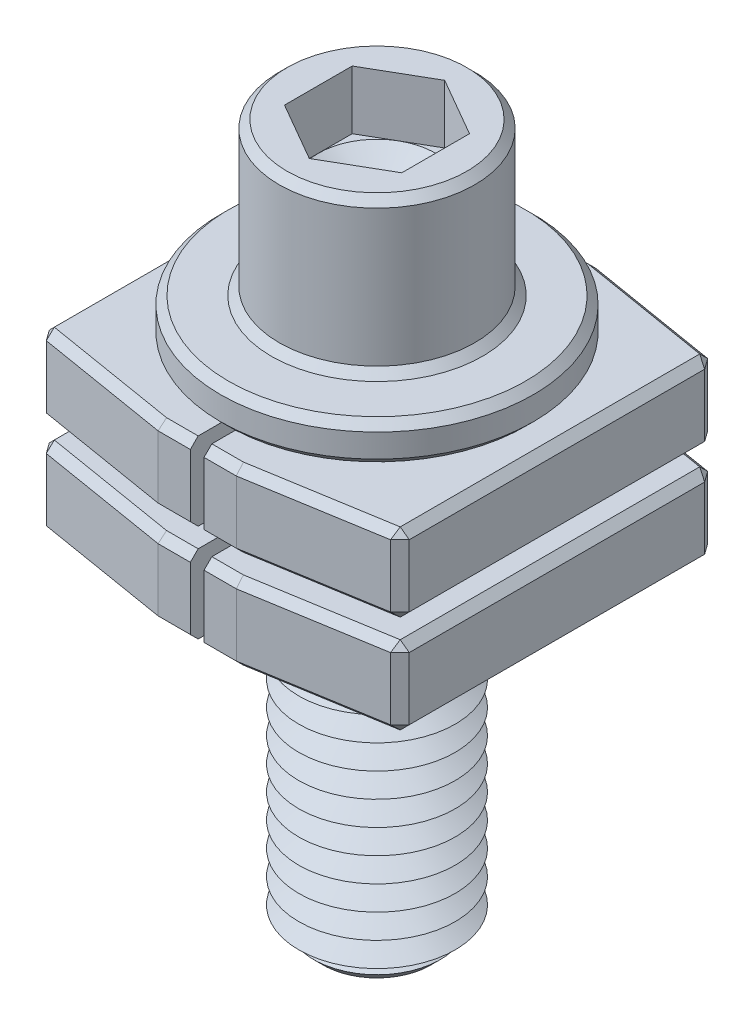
ISO-10303-21;
HEADER;
FILE_DESCRIPTION(('STEP AP214'),'2;1');
FILE_NAME('part.step','',(''),(''),'','','');
FILE_SCHEMA(('AUTOMOTIVE_DESIGN { 1 0 10303 214 1 1 1 1 }'));
ENDSEC;
DATA;
#1=APPLICATION_CONTEXT('core data for automotive mechanical design processes');
#2=APPLICATION_PROTOCOL_DEFINITION('international standard','automotive_design',2000,#1);
#3=PRODUCT_CONTEXT('',#1,'mechanical');
#4=PRODUCT('Part','Part','',(#3));
#5=PRODUCT_RELATED_PRODUCT_CATEGORY('part','',(#4));
#6=PRODUCT_DEFINITION_FORMATION('','',#4);
#7=PRODUCT_DEFINITION_CONTEXT('part definition',#1,'design');
#8=PRODUCT_DEFINITION('design','',#6,#7);
#9=PRODUCT_DEFINITION_SHAPE('','',#8);
#10=(LENGTH_UNIT() NAMED_UNIT(*) SI_UNIT(.MILLI.,.METRE.));
#11=(NAMED_UNIT(*) PLANE_ANGLE_UNIT() SI_UNIT($,.RADIAN.));
#12=(NAMED_UNIT(*) SI_UNIT($,.STERADIAN.) SOLID_ANGLE_UNIT());
#13=UNCERTAINTY_MEASURE_WITH_UNIT(LENGTH_MEASURE(1.E-05),#10,'distance_accuracy_value','');
#14=(GEOMETRIC_REPRESENTATION_CONTEXT(3) GLOBAL_UNCERTAINTY_ASSIGNED_CONTEXT((#13)) GLOBAL_UNIT_ASSIGNED_CONTEXT((#10,
#11,#12)) REPRESENTATION_CONTEXT('',''));
#15=CARTESIAN_POINT('',(0.,0.,0.));
#16=DIRECTION('',(0.,0.,1.));
#17=DIRECTION('',(1.,0.,0.));
#18=AXIS2_PLACEMENT_3D('',#15,#16,#17);
#19=CARTESIAN_POINT('',(0.,6.8,0.));
#20=DIRECTION('',(0.,1.,0.));
#21=DIRECTION('',(0.,0.,1.));
#22=AXIS2_PLACEMENT_3D('',#19,#20,#21);
#23=PLANE('',#22);
#24=CARTESIAN_POINT('',(0.,6.8,0.));
#25=DIRECTION('',(0.,1.,0.));
#26=DIRECTION('',(0.,0.,1.));
#27=AXIS2_PLACEMENT_3D('',#24,#25,#26);
#28=CIRCLE('',#27,3.);
#29=CARTESIAN_POINT('',(1.5,6.8,2.59807621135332));
#30=VERTEX_POINT('',#29);
#31=CARTESIAN_POINT('',(3.,6.8,0.));
#32=VERTEX_POINT('',#31);
#33=EDGE_CURVE('P0_E95',#30,#32,#28,.T.);
#34=ORIENTED_EDGE('',*,*,#33,.F.);
#35=DIRECTION('',(0.866025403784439,0.,-0.5));
#36=VECTOR('',#35,1.);
#37=CARTESIAN_POINT('',(0.,6.8,3.46410161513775));
#38=LINE('',#37,#36);
#39=CARTESIAN_POINT('',(3.,6.8,1.73205080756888));
#40=VERTEX_POINT('',#39);
#41=EDGE_CURVE('P0_E123',#30,#40,#38,.T.);
#42=ORIENTED_EDGE('',*,*,#41,.T.);
#43=DIRECTION('',(0.,0.,-1.));
#44=VECTOR('',#43,1.);
#45=CARTESIAN_POINT('',(3.,6.8,1.73205080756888));
#46=LINE('',#45,#44);
#47=EDGE_CURVE('P0_E119',#40,#32,#46,.T.);
#48=ORIENTED_EDGE('',*,*,#47,.T.);
#49=EDGE_LOOP('',(#34,#42,#48));
#50=FACE_BOUND('',#49,.T.);
#51=ADVANCED_FACE('P0_F16',(#50),#23,.T.);
#52=CARTESIAN_POINT('',(0.,6.8,0.));
#53=DIRECTION('',(0.,1.,0.));
#54=DIRECTION('',(0.,0.,1.));
#55=AXIS2_PLACEMENT_3D('',#52,#53,#54);
#56=CIRCLE('',#55,3.);
#57=CARTESIAN_POINT('',(1.5,6.8,-2.59807621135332));
#58=VERTEX_POINT('',#57);
#59=EDGE_CURVE('P0_E97',#32,#58,#56,.T.);
#60=ORIENTED_EDGE('',*,*,#59,.F.);
#61=CARTESIAN_POINT('',(3.,6.8,-1.73205080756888));
#62=VERTEX_POINT('',#61);
#63=EDGE_CURVE('P0_E108',#32,#62,#46,.T.);
#64=ORIENTED_EDGE('',*,*,#63,.T.);
#65=DIRECTION('',(-0.866025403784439,0.,-0.5));
#66=VECTOR('',#65,1.);
#67=CARTESIAN_POINT('',(3.,6.8,-1.73205080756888));
#68=LINE('',#67,#66);
#69=EDGE_CURVE('P0_E111',#62,#58,#68,.T.);
#70=ORIENTED_EDGE('',*,*,#69,.T.);
#71=EDGE_LOOP('',(#60,#64,#70));
#72=FACE_BOUND('',#71,.T.);
#73=ADVANCED_FACE('P0_F107',(#72),#23,.T.);
#74=CARTESIAN_POINT('',(-1.5,6.8,-2.59807621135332));
#75=VERTEX_POINT('',#74);
#76=EDGE_CURVE('P0_E113',#58,#75,#56,.T.);
#77=ORIENTED_EDGE('',*,*,#76,.F.);
#78=CARTESIAN_POINT('',(0.,6.8,-3.46410161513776));
#79=VERTEX_POINT('',#78);
#80=EDGE_CURVE('P0_E146',#58,#79,#68,.T.);
#81=ORIENTED_EDGE('',*,*,#80,.T.);
#82=DIRECTION('',(-0.866025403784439,0.,0.5));
#83=VECTOR('',#82,1.);
#84=CARTESIAN_POINT('',(0.,6.8,-3.46410161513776));
#85=LINE('',#84,#83);
#86=EDGE_CURVE('P0_E362',#79,#75,#85,.T.);
#87=ORIENTED_EDGE('',*,*,#86,.T.);
#88=EDGE_LOOP('',(#77,#81,#87));
#89=FACE_BOUND('',#88,.T.);
#90=ADVANCED_FACE('P0_F327',(#89),#23,.T.);
#91=CARTESIAN_POINT('',(-3.,6.8,0.));
#92=VERTEX_POINT('',#91);
#93=EDGE_CURVE('P0_E357',#75,#92,#56,.T.);
#94=ORIENTED_EDGE('',*,*,#93,.F.);
#95=CARTESIAN_POINT('',(-3.,6.8,-1.73205080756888));
#96=VERTEX_POINT('',#95);
#97=EDGE_CURVE('P0_E366',#75,#96,#85,.T.);
#98=ORIENTED_EDGE('',*,*,#97,.T.);
#99=DIRECTION('',(0.,0.,1.));
#100=VECTOR('',#99,1.);
#101=CARTESIAN_POINT('',(-3.,6.8,-1.73205080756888));
#102=LINE('',#101,#100);
#103=EDGE_CURVE('P0_E361',#96,#92,#102,.T.);
#104=ORIENTED_EDGE('',*,*,#103,.T.);
#105=EDGE_LOOP('',(#94,#98,#104));
#106=FACE_BOUND('',#105,.T.);
#107=ADVANCED_FACE('P0_F341',(#106),#23,.T.);
#108=CARTESIAN_POINT('',(-1.5,6.8,2.59807621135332));
#109=VERTEX_POINT('',#108);
#110=EDGE_CURVE('P0_E31',#92,#109,#56,.T.);
#111=ORIENTED_EDGE('',*,*,#110,.F.);
#112=CARTESIAN_POINT('',(-3.,6.8,1.73205080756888));
#113=VERTEX_POINT('',#112);
#114=EDGE_CURVE('P0_E353',#92,#113,#102,.T.);
#115=ORIENTED_EDGE('',*,*,#114,.T.);
#116=DIRECTION('',(0.866025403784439,0.,0.5));
#117=VECTOR('',#116,1.);
#118=CARTESIAN_POINT('',(-3.,6.8,1.73205080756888));
#119=LINE('',#118,#117);
#120=EDGE_CURVE('P0_E356',#113,#109,#119,.T.);
#121=ORIENTED_EDGE('',*,*,#120,.T.);
#122=EDGE_LOOP('',(#111,#115,#121));
#123=FACE_BOUND('',#122,.T.);
#124=ADVANCED_FACE('P0_F332',(#123),#23,.T.);
#125=CARTESIAN_POINT('',(0.,68.8086077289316,0.));
#126=DIRECTION('',(0.,1.,0.));
#127=DIRECTION('',(0.,0.,1.));
#128=AXIS2_PLACEMENT_3D('',#125,#126,#127);
#129=CYLINDRICAL_SURFACE('',#128,8.00000000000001);
#130=CARTESIAN_POINT('',(0.,0.400000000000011,0.));
#131=DIRECTION('',(0.,-1.,0.));
#132=DIRECTION('',(0.,0.,-1.));
#133=AXIS2_PLACEMENT_3D('',#130,#131,#132);
#134=CIRCLE('',#133,8.00000000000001);
#135=CARTESIAN_POINT('',(0.,0.400000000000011,-8.00000000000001));
#136=VERTEX_POINT('',#135);
#137=EDGE_CURVE('P0_E289',#136,#136,#134,.F.);
#138=ORIENTED_EDGE('',*,*,#137,.T.);
#139=EDGE_LOOP('',(#138));
#140=FACE_BOUND('',#139,.T.);
#141=CARTESIAN_POINT('',(0.,1.60000000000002,0.));
#142=DIRECTION('',(0.,1.,0.));
#143=DIRECTION('',(0.,0.,1.));
#144=AXIS2_PLACEMENT_3D('',#141,#142,#143);
#145=CIRCLE('',#144,8.00000000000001);
#146=CARTESIAN_POINT('',(0.,1.60000000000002,8.00000000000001));
#147=VERTEX_POINT('',#146);
#148=EDGE_CURVE('P0_E112',#147,#147,#145,.F.);
#149=ORIENTED_EDGE('',*,*,#148,.T.);
#150=EDGE_LOOP('',(#149));
#151=FACE_BOUND('',#150,.T.);
#152=ADVANCED_FACE('P0_F340',(#140,#151),#129,.T.);
#153=CARTESIAN_POINT('',(0.,0.,8.));
#154=DIRECTION('',(0.,-1.,0.));
#155=DIRECTION('',(0.,0.,-1.));
#156=AXIS2_PLACEMENT_3D('',#153,#154,#155);
#157=PLANE('',#156);
#158=CARTESIAN_POINT('',(0.,0.,0.));
#159=DIRECTION('',(0.,-1.,0.));
#160=DIRECTION('',(0.,0.,-1.));
#161=AXIS2_PLACEMENT_3D('',#158,#159,#160);
#162=CIRCLE('',#161,7.59999999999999);
#163=CARTESIAN_POINT('',(0.,0.,-7.59999999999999));
#164=VERTEX_POINT('',#163);
#165=EDGE_CURVE('P0_E292',#164,#164,#162,.T.);
#166=ORIENTED_EDGE('',*,*,#165,.T.);
#167=EDGE_LOOP('',(#166));
#168=FACE_BOUND('',#167,.T.);
#169=CARTESIAN_POINT('',(0.,0.,0.));
#170=DIRECTION('',(0.,1.,0.));
#171=DIRECTION('',(0.,0.,1.));
#172=AXIS2_PLACEMENT_3D('',#169,#170,#171);
#173=CIRCLE('',#172,4.);
#174=CARTESIAN_POINT('',(0.,0.,4.));
#175=VERTEX_POINT('',#174);
#176=EDGE_CURVE('P0_E279',#175,#175,#173,.T.);
#177=ORIENTED_EDGE('',*,*,#176,.T.);
#178=EDGE_LOOP('',(#177));
#179=FACE_BOUND('',#178,.T.);
#180=ADVANCED_FACE('P0_F347',(#168,#179),#157,.T.);
#181=CARTESIAN_POINT('',(0.,9.8,0.));
#182=DIRECTION('',(0.,1.,0.));
#183=DIRECTION('',(0.,0.,1.));
#184=AXIS2_PLACEMENT_3D('',#181,#182,#183);
#185=PLANE('',#184);
#186=CARTESIAN_POINT('',(0.,9.8,0.));
#187=DIRECTION('',(0.,1.,0.));
#188=DIRECTION('',(0.,0.,1.));
#189=AXIS2_PLACEMENT_3D('',#186,#187,#188);
#190=CIRCLE('',#189,4.60000000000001);
#191=CARTESIAN_POINT('',(0.,9.8,4.60000000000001));
#192=VERTEX_POINT('',#191);
#193=EDGE_CURVE('P0_E11',#192,#192,#190,.T.);
#194=ORIENTED_EDGE('',*,*,#193,.T.);
#195=EDGE_LOOP('',(#194));
#196=FACE_BOUND('',#195,.T.);
#197=DIRECTION('',(-0.866025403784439,0.,-0.5));
#198=VECTOR('',#197,1.);
#199=CARTESIAN_POINT('',(3.,9.8,-1.73205080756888));
#200=LINE('',#199,#198);
#201=CARTESIAN_POINT('',(3.,9.8,-1.73205080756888));
#202=VERTEX_POINT('',#201);
#203=CARTESIAN_POINT('',(0.,9.8,-3.46410161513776));
#204=VERTEX_POINT('',#203);
#205=EDGE_CURVE('P0_E39',#202,#204,#200,.T.);
#206=ORIENTED_EDGE('',*,*,#205,.F.);
#207=DIRECTION('',(0.,0.,-1.));
#208=VECTOR('',#207,1.);
#209=CARTESIAN_POINT('',(3.,9.8,1.73205080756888));
#210=LINE('',#209,#208);
#211=CARTESIAN_POINT('',(3.,9.8,1.73205080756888));
#212=VERTEX_POINT('',#211);
#213=EDGE_CURVE('P0_E144',#212,#202,#210,.T.);
#214=ORIENTED_EDGE('',*,*,#213,.F.);
#215=DIRECTION('',(0.866025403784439,0.,-0.5));
#216=VECTOR('',#215,1.);
#217=CARTESIAN_POINT('',(0.,9.8,3.46410161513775));
#218=LINE('',#217,#216);
#219=CARTESIAN_POINT('',(0.,9.8,3.46410161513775));
#220=VERTEX_POINT('',#219);
#221=EDGE_CURVE('P0_E141',#220,#212,#218,.T.);
#222=ORIENTED_EDGE('',*,*,#221,.F.);
#223=DIRECTION('',(0.866025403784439,0.,0.5));
#224=VECTOR('',#223,1.);
#225=CARTESIAN_POINT('',(-3.,9.8,1.73205080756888));
#226=LINE('',#225,#224);
#227=CARTESIAN_POINT('',(-3.,9.8,1.73205080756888));
#228=VERTEX_POINT('',#227);
#229=EDGE_CURVE('P0_E138',#228,#220,#226,.T.);
#230=ORIENTED_EDGE('',*,*,#229,.F.);
#231=DIRECTION('',(0.,0.,1.));
#232=VECTOR('',#231,1.);
#233=CARTESIAN_POINT('',(-3.,9.8,-1.73205080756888));
#234=LINE('',#233,#232);
#235=CARTESIAN_POINT('',(-3.,9.8,-1.73205080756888));
#236=VERTEX_POINT('',#235);
#237=EDGE_CURVE('P0_E135',#236,#228,#234,.T.);
#238=ORIENTED_EDGE('',*,*,#237,.F.);
#239=DIRECTION('',(-0.866025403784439,0.,0.5));
#240=VECTOR('',#239,1.);
#241=CARTESIAN_POINT('',(0.,9.8,-3.46410161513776));
#242=LINE('',#241,#240);
#243=EDGE_CURVE('P0_E132',#204,#236,#242,.T.);
#244=ORIENTED_EDGE('',*,*,#243,.F.);
#245=EDGE_LOOP('',(#206,#214,#222,#230,#238,#244));
#246=FACE_BOUND('',#245,.T.);
#247=ADVANCED_FACE('P0_F381',(#196,#246),#185,.T.);
#248=CARTESIAN_POINT('',(0.,68.8086077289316,0.));
#249=DIRECTION('',(0.,1.,0.));
#250=DIRECTION('',(0.,0.,1.));
#251=AXIS2_PLACEMENT_3D('',#248,#249,#250);
#252=CYLINDRICAL_SURFACE('',#251,5.00000000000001);
#253=CARTESIAN_POINT('',(0.,2.40000000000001,0.));
#254=DIRECTION('',(0.,1.,0.));
#255=DIRECTION('',(0.,0.,1.));
#256=AXIS2_PLACEMENT_3D('',#253,#254,#255);
#257=CIRCLE('',#256,5.00000000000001);
#258=CARTESIAN_POINT('',(0.,2.40000000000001,5.00000000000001));
#259=VERTEX_POINT('',#258);
#260=EDGE_CURVE('P0_E24',#259,#259,#257,.T.);
#261=ORIENTED_EDGE('',*,*,#260,.T.);
#262=EDGE_LOOP('',(#261));
#263=FACE_BOUND('',#262,.T.);
#264=CARTESIAN_POINT('',(0.,9.40000000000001,0.));
#265=DIRECTION('',(0.,1.,0.));
#266=DIRECTION('',(0.,0.,1.));
#267=AXIS2_PLACEMENT_3D('',#264,#265,#266);
#268=CIRCLE('',#267,5.00000000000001);
#269=CARTESIAN_POINT('',(0.,9.40000000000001,5.00000000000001));
#270=VERTEX_POINT('',#269);
#271=EDGE_CURVE('P0_E301',#270,#270,#268,.F.);
#272=ORIENTED_EDGE('',*,*,#271,.T.);
#273=EDGE_LOOP('',(#272));
#274=FACE_BOUND('',#273,.T.);
#275=ADVANCED_FACE('P0_F306',(#263,#274),#252,.T.);
#276=CARTESIAN_POINT('',(0.,2.,5.00000000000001));
#277=DIRECTION('',(0.,1.,0.));
#278=DIRECTION('',(0.,0.,1.));
#279=AXIS2_PLACEMENT_3D('',#276,#277,#278);
#280=PLANE('',#279);
#281=CARTESIAN_POINT('',(0.,2.,0.));
#282=DIRECTION('',(0.,1.,0.));
#283=DIRECTION('',(0.,0.,1.));
#284=AXIS2_PLACEMENT_3D('',#281,#282,#283);
#285=CIRCLE('',#284,7.60000000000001);
#286=CARTESIAN_POINT('',(0.,2.,7.60000000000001));
#287=VERTEX_POINT('',#286);
#288=EDGE_CURVE('P0_E298',#287,#287,#285,.T.);
#289=ORIENTED_EDGE('',*,*,#288,.T.);
#290=EDGE_LOOP('',(#289));
#291=FACE_BOUND('',#290,.T.);
#292=CARTESIAN_POINT('',(0.,2.,0.));
#293=DIRECTION('',(0.,1.,0.));
#294=DIRECTION('',(0.,0.,1.));
#295=AXIS2_PLACEMENT_3D('',#292,#293,#294);
#296=CIRCLE('',#295,5.40000000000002);
#297=CARTESIAN_POINT('',(0.,2.,5.40000000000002));
#298=VERTEX_POINT('',#297);
#299=EDGE_CURVE('P0_E295',#298,#298,#296,.F.);
#300=ORIENTED_EDGE('',*,*,#299,.T.);
#301=EDGE_LOOP('',(#300));
#302=FACE_BOUND('',#301,.T.);
#303=ADVANCED_FACE('P0_F440',(#291,#302),#280,.T.);
#304=CARTESIAN_POINT('',(0.,-0.625000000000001,0.));
#305=DIRECTION('',(0.,1.,0.));
#306=DIRECTION('',(0.,0.,1.));
#307=AXIS2_PLACEMENT_3D('',#304,#305,#306);
#308=CONICAL_SURFACE('',#307,2.91746824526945,1.0471975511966);
#309=ORIENTED_EDGE('',*,*,#176,.F.);
#310=EDGE_LOOP('',(#309));
#311=FACE_BOUND('',#310,.T.);
#312=CARTESIAN_POINT('',(0.,-0.625000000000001,0.));
#313=DIRECTION('',(0.,1.,0.));
#314=DIRECTION('',(0.,0.,1.));
#315=AXIS2_PLACEMENT_3D('',#312,#313,#314);
#316=CIRCLE('',#315,2.91746824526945);
#317=CARTESIAN_POINT('',(0.,-0.625000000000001,2.91746824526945));
#318=VERTEX_POINT('',#317);
#319=EDGE_CURVE('P0_E276',#318,#318,#316,.T.);
#320=ORIENTED_EDGE('',*,*,#319,.T.);
#321=EDGE_LOOP('',(#320));
#322=FACE_BOUND('',#321,.T.);
#323=ADVANCED_FACE('P0_F449',(#311,#322),#308,.T.);
#324=CARTESIAN_POINT('',(0.,-1.25,0.));
#325=DIRECTION('',(0.,-1.,0.));
#326=DIRECTION('',(0.,0.,-1.));
#327=AXIS2_PLACEMENT_3D('',#324,#325,#326);
#328=CONICAL_SURFACE('',#327,4.,1.0471975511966);
#329=ORIENTED_EDGE('',*,*,#319,.F.);
#330=EDGE_LOOP('',(#329));
#331=FACE_BOUND('',#330,.T.);
#332=CARTESIAN_POINT('',(0.,-1.25,0.));
#333=DIRECTION('',(0.,1.,0.));
#334=DIRECTION('',(0.,0.,1.));
#335=AXIS2_PLACEMENT_3D('',#332,#333,#334);
#336=CIRCLE('',#335,4.);
#337=CARTESIAN_POINT('',(0.,-1.25,4.));
#338=VERTEX_POINT('',#337);
#339=EDGE_CURVE('P0_E273',#338,#338,#336,.T.);
#340=ORIENTED_EDGE('',*,*,#339,.T.);
#341=EDGE_LOOP('',(#340));
#342=FACE_BOUND('',#341,.T.);
#343=ADVANCED_FACE('P0_F459',(#331,#342),#328,.T.);
#344=CARTESIAN_POINT('',(0.,-1.875,0.));
#345=DIRECTION('',(0.,1.,0.));
#346=DIRECTION('',(0.,0.,1.));
#347=AXIS2_PLACEMENT_3D('',#344,#345,#346);
#348=CONICAL_SURFACE('',#347,2.91746824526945,1.0471975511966);
#349=ORIENTED_EDGE('',*,*,#339,.F.);
#350=EDGE_LOOP('',(#349));
#351=FACE_BOUND('',#350,.T.);
#352=CARTESIAN_POINT('',(0.,-1.875,0.));
#353=DIRECTION('',(0.,1.,0.));
#354=DIRECTION('',(0.,0.,1.));
#355=AXIS2_PLACEMENT_3D('',#352,#353,#354);
#356=CIRCLE('',#355,2.91746824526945);
#357=CARTESIAN_POINT('',(0.,-1.875,2.91746824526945));
#358=VERTEX_POINT('',#357);
#359=EDGE_CURVE('P0_E270',#358,#358,#356,.T.);
#360=ORIENTED_EDGE('',*,*,#359,.T.);
#361=EDGE_LOOP('',(#360));
#362=FACE_BOUND('',#361,.T.);
#363=ADVANCED_FACE('P0_F469',(#351,#362),#348,.T.);
#364=CARTESIAN_POINT('',(0.,-2.5,0.));
#365=DIRECTION('',(0.,-1.,0.));
#366=DIRECTION('',(0.,0.,-1.));
#367=AXIS2_PLACEMENT_3D('',#364,#365,#366);
#368=CONICAL_SURFACE('',#367,4.,1.0471975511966);
#369=ORIENTED_EDGE('',*,*,#359,.F.);
#370=EDGE_LOOP('',(#369));
#371=FACE_BOUND('',#370,.T.);
#372=CARTESIAN_POINT('',(0.,-2.5,0.));
#373=DIRECTION('',(0.,1.,0.));
#374=DIRECTION('',(0.,0.,1.));
#375=AXIS2_PLACEMENT_3D('',#372,#373,#374);
#376=CIRCLE('',#375,4.);
#377=CARTESIAN_POINT('',(0.,-2.5,4.));
#378=VERTEX_POINT('',#377);
#379=EDGE_CURVE('P0_E267',#378,#378,#376,.T.);
#380=ORIENTED_EDGE('',*,*,#379,.T.);
#381=EDGE_LOOP('',(#380));
#382=FACE_BOUND('',#381,.T.);
#383=ADVANCED_FACE('P0_F479',(#371,#382),#368,.T.);
#384=CARTESIAN_POINT('',(0.,-3.125,0.));
#385=DIRECTION('',(0.,1.,0.));
#386=DIRECTION('',(0.,0.,1.));
#387=AXIS2_PLACEMENT_3D('',#384,#385,#386);
#388=CONICAL_SURFACE('',#387,2.91746824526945,1.0471975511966);
#389=ORIENTED_EDGE('',*,*,#379,.F.);
#390=EDGE_LOOP('',(#389));
#391=FACE_BOUND('',#390,.T.);
#392=CARTESIAN_POINT('',(0.,-3.125,0.));
#393=DIRECTION('',(0.,1.,0.));
#394=DIRECTION('',(0.,0.,1.));
#395=AXIS2_PLACEMENT_3D('',#392,#393,#394);
#396=CIRCLE('',#395,2.91746824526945);
#397=CARTESIAN_POINT('',(0.,-3.125,2.91746824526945));
#398=VERTEX_POINT('',#397);
#399=EDGE_CURVE('P0_E264',#398,#398,#396,.T.);
#400=ORIENTED_EDGE('',*,*,#399,.T.);
#401=EDGE_LOOP('',(#400));
#402=FACE_BOUND('',#401,.T.);
#403=ADVANCED_FACE('P0_F489',(#391,#402),#388,.T.);
#404=CARTESIAN_POINT('',(0.,-3.75,0.));
#405=DIRECTION('',(0.,-1.,0.));
#406=DIRECTION('',(0.,0.,-1.));
#407=AXIS2_PLACEMENT_3D('',#404,#405,#406);
#408=CONICAL_SURFACE('',#407,4.,1.0471975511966);
#409=ORIENTED_EDGE('',*,*,#399,.F.);
#410=EDGE_LOOP('',(#409));
#411=FACE_BOUND('',#410,.T.);
#412=CARTESIAN_POINT('',(0.,-3.75,0.));
#413=DIRECTION('',(0.,1.,0.));
#414=DIRECTION('',(0.,0.,1.));
#415=AXIS2_PLACEMENT_3D('',#412,#413,#414);
#416=CIRCLE('',#415,4.);
#417=CARTESIAN_POINT('',(0.,-3.75,4.));
#418=VERTEX_POINT('',#417);
#419=EDGE_CURVE('P0_E261',#418,#418,#416,.T.);
#420=ORIENTED_EDGE('',*,*,#419,.T.);
#421=EDGE_LOOP('',(#420));
#422=FACE_BOUND('',#421,.T.);
#423=ADVANCED_FACE('P0_F499',(#411,#422),#408,.T.);
#424=CARTESIAN_POINT('',(0.,-4.375,0.));
#425=DIRECTION('',(0.,1.,0.));
#426=DIRECTION('',(0.,0.,1.));
#427=AXIS2_PLACEMENT_3D('',#424,#425,#426);
#428=CONICAL_SURFACE('',#427,2.91746824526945,1.0471975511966);
#429=ORIENTED_EDGE('',*,*,#419,.F.);
#430=EDGE_LOOP('',(#429));
#431=FACE_BOUND('',#430,.T.);
#432=CARTESIAN_POINT('',(0.,-4.375,0.));
#433=DIRECTION('',(0.,1.,0.));
#434=DIRECTION('',(0.,0.,1.));
#435=AXIS2_PLACEMENT_3D('',#432,#433,#434);
#436=CIRCLE('',#435,2.91746824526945);
#437=CARTESIAN_POINT('',(0.,-4.375,2.91746824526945));
#438=VERTEX_POINT('',#437);
#439=EDGE_CURVE('P0_E258',#438,#438,#436,.T.);
#440=ORIENTED_EDGE('',*,*,#439,.T.);
#441=EDGE_LOOP('',(#440));
#442=FACE_BOUND('',#441,.T.);
#443=ADVANCED_FACE('P0_F509',(#431,#442),#428,.T.);
#444=CARTESIAN_POINT('',(0.,-5.,0.));
#445=DIRECTION('',(0.,-1.,0.));
#446=DIRECTION('',(0.,0.,-1.));
#447=AXIS2_PLACEMENT_3D('',#444,#445,#446);
#448=CONICAL_SURFACE('',#447,4.,1.0471975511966);
#449=ORIENTED_EDGE('',*,*,#439,.F.);
#450=EDGE_LOOP('',(#449));
#451=FACE_BOUND('',#450,.T.);
#452=CARTESIAN_POINT('',(0.,-5.,0.));
#453=DIRECTION('',(0.,1.,0.));
#454=DIRECTION('',(0.,0.,1.));
#455=AXIS2_PLACEMENT_3D('',#452,#453,#454);
#456=CIRCLE('',#455,4.);
#457=CARTESIAN_POINT('',(0.,-5.,4.));
#458=VERTEX_POINT('',#457);
#459=EDGE_CURVE('P0_E255',#458,#458,#456,.T.);
#460=ORIENTED_EDGE('',*,*,#459,.T.);
#461=EDGE_LOOP('',(#460));
#462=FACE_BOUND('',#461,.T.);
#463=ADVANCED_FACE('P0_F519',(#451,#462),#448,.T.);
#464=CARTESIAN_POINT('',(0.,-5.625,0.));
#465=DIRECTION('',(0.,1.,0.));
#466=DIRECTION('',(0.,0.,1.));
#467=AXIS2_PLACEMENT_3D('',#464,#465,#466);
#468=CONICAL_SURFACE('',#467,2.91746824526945,1.0471975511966);
#469=ORIENTED_EDGE('',*,*,#459,.F.);
#470=EDGE_LOOP('',(#469));
#471=FACE_BOUND('',#470,.T.);
#472=CARTESIAN_POINT('',(0.,-5.625,0.));
#473=DIRECTION('',(0.,1.,0.));
#474=DIRECTION('',(0.,0.,1.));
#475=AXIS2_PLACEMENT_3D('',#472,#473,#474);
#476=CIRCLE('',#475,2.91746824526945);
#477=CARTESIAN_POINT('',(0.,-5.625,2.91746824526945));
#478=VERTEX_POINT('',#477);
#479=EDGE_CURVE('P0_E252',#478,#478,#476,.T.);
#480=ORIENTED_EDGE('',*,*,#479,.T.);
#481=EDGE_LOOP('',(#480));
#482=FACE_BOUND('',#481,.T.);
#483=ADVANCED_FACE('P0_F529',(#471,#482),#468,.T.);
#484=CARTESIAN_POINT('',(0.,-6.25,0.));
#485=DIRECTION('',(0.,-1.,0.));
#486=DIRECTION('',(0.,0.,-1.));
#487=AXIS2_PLACEMENT_3D('',#484,#485,#486);
#488=CONICAL_SURFACE('',#487,4.,1.0471975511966);
#489=ORIENTED_EDGE('',*,*,#479,.F.);
#490=EDGE_LOOP('',(#489));
#491=FACE_BOUND('',#490,.T.);
#492=CARTESIAN_POINT('',(0.,-6.25,0.));
#493=DIRECTION('',(0.,1.,0.));
#494=DIRECTION('',(0.,0.,1.));
#495=AXIS2_PLACEMENT_3D('',#492,#493,#494);
#496=CIRCLE('',#495,4.);
#497=CARTESIAN_POINT('',(0.,-6.25,4.));
#498=VERTEX_POINT('',#497);
#499=EDGE_CURVE('P0_E249',#498,#498,#496,.T.);
#500=ORIENTED_EDGE('',*,*,#499,.T.);
#501=EDGE_LOOP('',(#500));
#502=FACE_BOUND('',#501,.T.);
#503=ADVANCED_FACE('P0_F539',(#491,#502),#488,.T.);
#504=CARTESIAN_POINT('',(0.,-6.875,0.));
#505=DIRECTION('',(0.,1.,0.));
#506=DIRECTION('',(0.,0.,1.));
#507=AXIS2_PLACEMENT_3D('',#504,#505,#506);
#508=CONICAL_SURFACE('',#507,2.91746824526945,1.0471975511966);
#509=ORIENTED_EDGE('',*,*,#499,.F.);
#510=EDGE_LOOP('',(#509));
#511=FACE_BOUND('',#510,.T.);
#512=CARTESIAN_POINT('',(0.,-6.875,0.));
#513=DIRECTION('',(0.,1.,0.));
#514=DIRECTION('',(0.,0.,1.));
#515=AXIS2_PLACEMENT_3D('',#512,#513,#514);
#516=CIRCLE('',#515,2.91746824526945);
#517=CARTESIAN_POINT('',(0.,-6.875,2.91746824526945));
#518=VERTEX_POINT('',#517);
#519=EDGE_CURVE('P0_E246',#518,#518,#516,.T.);
#520=ORIENTED_EDGE('',*,*,#519,.T.);
#521=EDGE_LOOP('',(#520));
#522=FACE_BOUND('',#521,.T.);
#523=ADVANCED_FACE('P0_F549',(#511,#522),#508,.T.);
#524=CARTESIAN_POINT('',(0.,-7.5,0.));
#525=DIRECTION('',(0.,-1.,0.));
#526=DIRECTION('',(0.,0.,-1.));
#527=AXIS2_PLACEMENT_3D('',#524,#525,#526);
#528=CONICAL_SURFACE('',#527,4.,1.0471975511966);
#529=ORIENTED_EDGE('',*,*,#519,.F.);
#530=EDGE_LOOP('',(#529));
#531=FACE_BOUND('',#530,.T.);
#532=CARTESIAN_POINT('',(0.,-7.5,0.));
#533=DIRECTION('',(0.,1.,0.));
#534=DIRECTION('',(0.,0.,1.));
#535=AXIS2_PLACEMENT_3D('',#532,#533,#534);
#536=CIRCLE('',#535,4.);
#537=CARTESIAN_POINT('',(0.,-7.5,4.));
#538=VERTEX_POINT('',#537);
#539=EDGE_CURVE('P0_E243',#538,#538,#536,.T.);
#540=ORIENTED_EDGE('',*,*,#539,.T.);
#541=EDGE_LOOP('',(#540));
#542=FACE_BOUND('',#541,.T.);
#543=ADVANCED_FACE('P0_F559',(#531,#542),#528,.T.);
#544=CARTESIAN_POINT('',(0.,-8.125,0.));
#545=DIRECTION('',(0.,1.,0.));
#546=DIRECTION('',(0.,0.,1.));
#547=AXIS2_PLACEMENT_3D('',#544,#545,#546);
#548=CONICAL_SURFACE('',#547,2.91746824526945,1.0471975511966);
#549=ORIENTED_EDGE('',*,*,#539,.F.);
#550=EDGE_LOOP('',(#549));
#551=FACE_BOUND('',#550,.T.);
#552=CARTESIAN_POINT('',(0.,-8.125,0.));
#553=DIRECTION('',(0.,1.,0.));
#554=DIRECTION('',(0.,0.,1.));
#555=AXIS2_PLACEMENT_3D('',#552,#553,#554);
#556=CIRCLE('',#555,2.91746824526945);
#557=CARTESIAN_POINT('',(0.,-8.125,2.91746824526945));
#558=VERTEX_POINT('',#557);
#559=EDGE_CURVE('P0_E240',#558,#558,#556,.T.);
#560=ORIENTED_EDGE('',*,*,#559,.T.);
#561=EDGE_LOOP('',(#560));
#562=FACE_BOUND('',#561,.T.);
#563=ADVANCED_FACE('P0_F569',(#551,#562),#548,.T.);
#564=CARTESIAN_POINT('',(0.,-8.75,0.));
#565=DIRECTION('',(0.,-1.,0.));
#566=DIRECTION('',(0.,0.,-1.));
#567=AXIS2_PLACEMENT_3D('',#564,#565,#566);
#568=CONICAL_SURFACE('',#567,4.,1.0471975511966);
#569=ORIENTED_EDGE('',*,*,#559,.F.);
#570=EDGE_LOOP('',(#569));
#571=FACE_BOUND('',#570,.T.);
#572=CARTESIAN_POINT('',(0.,-8.75,0.));
#573=DIRECTION('',(0.,1.,0.));
#574=DIRECTION('',(0.,0.,1.));
#575=AXIS2_PLACEMENT_3D('',#572,#573,#574);
#576=CIRCLE('',#575,4.);
#577=CARTESIAN_POINT('',(0.,-8.75,4.));
#578=VERTEX_POINT('',#577);
#579=EDGE_CURVE('P0_E237',#578,#578,#576,.T.);
#580=ORIENTED_EDGE('',*,*,#579,.T.);
#581=EDGE_LOOP('',(#580));
#582=FACE_BOUND('',#581,.T.);
#583=ADVANCED_FACE('P0_F579',(#571,#582),#568,.T.);
#584=CARTESIAN_POINT('',(0.,-9.375,0.));
#585=DIRECTION('',(0.,1.,0.));
#586=DIRECTION('',(0.,0.,1.));
#587=AXIS2_PLACEMENT_3D('',#584,#585,#586);
#588=CONICAL_SURFACE('',#587,2.91746824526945,1.0471975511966);
#589=ORIENTED_EDGE('',*,*,#579,.F.);
#590=EDGE_LOOP('',(#589));
#591=FACE_BOUND('',#590,.T.);
#592=CARTESIAN_POINT('',(0.,-9.375,0.));
#593=DIRECTION('',(0.,1.,0.));
#594=DIRECTION('',(0.,0.,1.));
#595=AXIS2_PLACEMENT_3D('',#592,#593,#594);
#596=CIRCLE('',#595,2.91746824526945);
#597=CARTESIAN_POINT('',(0.,-9.375,2.91746824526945));
#598=VERTEX_POINT('',#597);
#599=EDGE_CURVE('P0_E234',#598,#598,#596,.T.);
#600=ORIENTED_EDGE('',*,*,#599,.T.);
#601=EDGE_LOOP('',(#600));
#602=FACE_BOUND('',#601,.T.);
#603=ADVANCED_FACE('P0_F589',(#591,#602),#588,.T.);
#604=CARTESIAN_POINT('',(0.,-10.,0.));
#605=DIRECTION('',(0.,-1.,0.));
#606=DIRECTION('',(0.,0.,-1.));
#607=AXIS2_PLACEMENT_3D('',#604,#605,#606);
#608=CONICAL_SURFACE('',#607,4.,1.0471975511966);
#609=ORIENTED_EDGE('',*,*,#599,.F.);
#610=EDGE_LOOP('',(#609));
#611=FACE_BOUND('',#610,.T.);
#612=CARTESIAN_POINT('',(0.,-10.,0.));
#613=DIRECTION('',(0.,1.,0.));
#614=DIRECTION('',(0.,0.,1.));
#615=AXIS2_PLACEMENT_3D('',#612,#613,#614);
#616=CIRCLE('',#615,4.);
#617=CARTESIAN_POINT('',(0.,-10.,4.));
#618=VERTEX_POINT('',#617);
#619=EDGE_CURVE('P0_E231',#618,#618,#616,.T.);
#620=ORIENTED_EDGE('',*,*,#619,.T.);
#621=EDGE_LOOP('',(#620));
#622=FACE_BOUND('',#621,.T.);
#623=ADVANCED_FACE('P0_F599',(#611,#622),#608,.T.);
#624=CARTESIAN_POINT('',(0.,-10.625,0.));
#625=DIRECTION('',(0.,1.,0.));
#626=DIRECTION('',(0.,0.,1.));
#627=AXIS2_PLACEMENT_3D('',#624,#625,#626);
#628=CONICAL_SURFACE('',#627,2.91746824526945,1.0471975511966);
#629=ORIENTED_EDGE('',*,*,#619,.F.);
#630=EDGE_LOOP('',(#629));
#631=FACE_BOUND('',#630,.T.);
#632=CARTESIAN_POINT('',(0.,-10.625,0.));
#633=DIRECTION('',(0.,1.,0.));
#634=DIRECTION('',(0.,0.,1.));
#635=AXIS2_PLACEMENT_3D('',#632,#633,#634);
#636=CIRCLE('',#635,2.91746824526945);
#637=CARTESIAN_POINT('',(0.,-10.625,2.91746824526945));
#638=VERTEX_POINT('',#637);
#639=EDGE_CURVE('P0_E228',#638,#638,#636,.T.);
#640=ORIENTED_EDGE('',*,*,#639,.T.);
#641=EDGE_LOOP('',(#640));
#642=FACE_BOUND('',#641,.T.);
#643=ADVANCED_FACE('P0_F609',(#631,#642),#628,.T.);
#644=CARTESIAN_POINT('',(0.,-11.25,0.));
#645=DIRECTION('',(0.,-1.,0.));
#646=DIRECTION('',(0.,0.,-1.));
#647=AXIS2_PLACEMENT_3D('',#644,#645,#646);
#648=CONICAL_SURFACE('',#647,4.,1.0471975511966);
#649=ORIENTED_EDGE('',*,*,#639,.F.);
#650=EDGE_LOOP('',(#649));
#651=FACE_BOUND('',#650,.T.);
#652=CARTESIAN_POINT('',(0.,-11.25,0.));
#653=DIRECTION('',(0.,1.,0.));
#654=DIRECTION('',(0.,0.,1.));
#655=AXIS2_PLACEMENT_3D('',#652,#653,#654);
#656=CIRCLE('',#655,4.);
#657=CARTESIAN_POINT('',(0.,-11.25,4.));
#658=VERTEX_POINT('',#657);
#659=EDGE_CURVE('P0_E225',#658,#658,#656,.T.);
#660=ORIENTED_EDGE('',*,*,#659,.T.);
#661=EDGE_LOOP('',(#660));
#662=FACE_BOUND('',#661,.T.);
#663=ADVANCED_FACE('P0_F619',(#651,#662),#648,.T.);
#664=CARTESIAN_POINT('',(0.,-11.875,0.));
#665=DIRECTION('',(0.,1.,0.));
#666=DIRECTION('',(0.,0.,1.));
#667=AXIS2_PLACEMENT_3D('',#664,#665,#666);
#668=CONICAL_SURFACE('',#667,2.91746824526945,1.0471975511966);
#669=ORIENTED_EDGE('',*,*,#659,.F.);
#670=EDGE_LOOP('',(#669));
#671=FACE_BOUND('',#670,.T.);
#672=CARTESIAN_POINT('',(0.,-11.875,0.));
#673=DIRECTION('',(0.,1.,0.));
#674=DIRECTION('',(0.,0.,1.));
#675=AXIS2_PLACEMENT_3D('',#672,#673,#674);
#676=CIRCLE('',#675,2.91746824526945);
#677=CARTESIAN_POINT('',(0.,-11.875,2.91746824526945));
#678=VERTEX_POINT('',#677);
#679=EDGE_CURVE('P0_E222',#678,#678,#676,.T.);
#680=ORIENTED_EDGE('',*,*,#679,.T.);
#681=EDGE_LOOP('',(#680));
#682=FACE_BOUND('',#681,.T.);
#683=ADVANCED_FACE('P0_F629',(#671,#682),#668,.T.);
#684=CARTESIAN_POINT('',(0.,-12.5,0.));
#685=DIRECTION('',(0.,-1.,0.));
#686=DIRECTION('',(0.,0.,-1.));
#687=AXIS2_PLACEMENT_3D('',#684,#685,#686);
#688=CONICAL_SURFACE('',#687,4.,1.0471975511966);
#689=ORIENTED_EDGE('',*,*,#679,.F.);
#690=EDGE_LOOP('',(#689));
#691=FACE_BOUND('',#690,.T.);
#692=CARTESIAN_POINT('',(0.,-12.5,0.));
#693=DIRECTION('',(0.,1.,0.));
#694=DIRECTION('',(0.,0.,1.));
#695=AXIS2_PLACEMENT_3D('',#692,#693,#694);
#696=CIRCLE('',#695,4.);
#697=CARTESIAN_POINT('',(0.,-12.5,4.));
#698=VERTEX_POINT('',#697);
#699=EDGE_CURVE('P0_E219',#698,#698,#696,.T.);
#700=ORIENTED_EDGE('',*,*,#699,.T.);
#701=EDGE_LOOP('',(#700));
#702=FACE_BOUND('',#701,.T.);
#703=ADVANCED_FACE('P0_F639',(#691,#702),#688,.T.);
#704=CARTESIAN_POINT('',(0.,-13.125,0.));
#705=DIRECTION('',(0.,1.,0.));
#706=DIRECTION('',(0.,0.,1.));
#707=AXIS2_PLACEMENT_3D('',#704,#705,#706);
#708=CONICAL_SURFACE('',#707,2.91746824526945,1.0471975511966);
#709=ORIENTED_EDGE('',*,*,#699,.F.);
#710=EDGE_LOOP('',(#709));
#711=FACE_BOUND('',#710,.T.);
#712=CARTESIAN_POINT('',(0.,-13.125,0.));
#713=DIRECTION('',(0.,1.,0.));
#714=DIRECTION('',(0.,0.,1.));
#715=AXIS2_PLACEMENT_3D('',#712,#713,#714);
#716=CIRCLE('',#715,2.91746824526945);
#717=CARTESIAN_POINT('',(0.,-13.125,2.91746824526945));
#718=VERTEX_POINT('',#717);
#719=EDGE_CURVE('P0_E216',#718,#718,#716,.T.);
#720=ORIENTED_EDGE('',*,*,#719,.T.);
#721=EDGE_LOOP('',(#720));
#722=FACE_BOUND('',#721,.T.);
#723=ADVANCED_FACE('P0_F649',(#711,#722),#708,.T.);
#724=CARTESIAN_POINT('',(0.,-13.75,0.));
#725=DIRECTION('',(0.,-1.,0.));
#726=DIRECTION('',(0.,0.,-1.));
#727=AXIS2_PLACEMENT_3D('',#724,#725,#726);
#728=CONICAL_SURFACE('',#727,4.,1.0471975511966);
#729=ORIENTED_EDGE('',*,*,#719,.F.);
#730=EDGE_LOOP('',(#729));
#731=FACE_BOUND('',#730,.T.);
#732=CARTESIAN_POINT('',(0.,-13.75,0.));
#733=DIRECTION('',(0.,1.,0.));
#734=DIRECTION('',(0.,0.,1.));
#735=AXIS2_PLACEMENT_3D('',#732,#733,#734);
#736=CIRCLE('',#735,4.);
#737=CARTESIAN_POINT('',(0.,-13.75,4.));
#738=VERTEX_POINT('',#737);
#739=EDGE_CURVE('P0_E213',#738,#738,#736,.T.);
#740=ORIENTED_EDGE('',*,*,#739,.T.);
#741=EDGE_LOOP('',(#740));
#742=FACE_BOUND('',#741,.T.);
#743=ADVANCED_FACE('P0_F659',(#731,#742),#728,.T.);
#744=CARTESIAN_POINT('',(0.,-14.375,0.));
#745=DIRECTION('',(0.,1.,0.));
#746=DIRECTION('',(0.,0.,1.));
#747=AXIS2_PLACEMENT_3D('',#744,#745,#746);
#748=CONICAL_SURFACE('',#747,2.91746824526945,1.0471975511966);
#749=ORIENTED_EDGE('',*,*,#739,.F.);
#750=EDGE_LOOP('',(#749));
#751=FACE_BOUND('',#750,.T.);
#752=CARTESIAN_POINT('',(0.,-14.375,0.));
#753=DIRECTION('',(0.,1.,0.));
#754=DIRECTION('',(0.,0.,1.));
#755=AXIS2_PLACEMENT_3D('',#752,#753,#754);
#756=CIRCLE('',#755,2.91746824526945);
#757=CARTESIAN_POINT('',(0.,-14.375,2.91746824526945));
#758=VERTEX_POINT('',#757);
#759=EDGE_CURVE('P0_E210',#758,#758,#756,.T.);
#760=ORIENTED_EDGE('',*,*,#759,.T.);
#761=EDGE_LOOP('',(#760));
#762=FACE_BOUND('',#761,.T.);
#763=ADVANCED_FACE('P0_F669',(#751,#762),#748,.T.);
#764=CARTESIAN_POINT('',(0.,-15.,0.));
#765=DIRECTION('',(0.,-1.,0.));
#766=DIRECTION('',(0.,0.,-1.));
#767=AXIS2_PLACEMENT_3D('',#764,#765,#766);
#768=CONICAL_SURFACE('',#767,4.,1.0471975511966);
#769=ORIENTED_EDGE('',*,*,#759,.F.);
#770=EDGE_LOOP('',(#769));
#771=FACE_BOUND('',#770,.T.);
#772=CARTESIAN_POINT('',(0.,-15.,0.));
#773=DIRECTION('',(0.,1.,0.));
#774=DIRECTION('',(0.,0.,1.));
#775=AXIS2_PLACEMENT_3D('',#772,#773,#774);
#776=CIRCLE('',#775,4.);
#777=CARTESIAN_POINT('',(0.,-15.,4.));
#778=VERTEX_POINT('',#777);
#779=EDGE_CURVE('P0_E207',#778,#778,#776,.T.);
#780=ORIENTED_EDGE('',*,*,#779,.T.);
#781=EDGE_LOOP('',(#780));
#782=FACE_BOUND('',#781,.T.);
#783=ADVANCED_FACE('P0_F679',(#771,#782),#768,.T.);
#784=CARTESIAN_POINT('',(0.,-15.625,0.));
#785=DIRECTION('',(0.,1.,0.));
#786=DIRECTION('',(0.,0.,1.));
#787=AXIS2_PLACEMENT_3D('',#784,#785,#786);
#788=CONICAL_SURFACE('',#787,2.91746824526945,1.0471975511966);
#789=ORIENTED_EDGE('',*,*,#779,.F.);
#790=EDGE_LOOP('',(#789));
#791=FACE_BOUND('',#790,.T.);
#792=CARTESIAN_POINT('',(0.,-15.625,0.));
#793=DIRECTION('',(0.,1.,0.));
#794=DIRECTION('',(0.,0.,1.));
#795=AXIS2_PLACEMENT_3D('',#792,#793,#794);
#796=CIRCLE('',#795,2.91746824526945);
#797=CARTESIAN_POINT('',(0.,-15.625,2.91746824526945));
#798=VERTEX_POINT('',#797);
#799=EDGE_CURVE('P0_E204',#798,#798,#796,.T.);
#800=ORIENTED_EDGE('',*,*,#799,.T.);
#801=EDGE_LOOP('',(#800));
#802=FACE_BOUND('',#801,.T.);
#803=ADVANCED_FACE('P0_F689',(#791,#802),#788,.T.);
#804=CARTESIAN_POINT('',(0.,-16.25,0.));
#805=DIRECTION('',(0.,-1.,0.));
#806=DIRECTION('',(0.,0.,-1.));
#807=AXIS2_PLACEMENT_3D('',#804,#805,#806);
#808=CONICAL_SURFACE('',#807,4.,1.0471975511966);
#809=ORIENTED_EDGE('',*,*,#799,.F.);
#810=EDGE_LOOP('',(#809));
#811=FACE_BOUND('',#810,.T.);
#812=CARTESIAN_POINT('',(0.,-16.25,0.));
#813=DIRECTION('',(0.,1.,0.));
#814=DIRECTION('',(0.,0.,1.));
#815=AXIS2_PLACEMENT_3D('',#812,#813,#814);
#816=CIRCLE('',#815,4.);
#817=CARTESIAN_POINT('',(0.,-16.25,4.));
#818=VERTEX_POINT('',#817);
#819=EDGE_CURVE('P0_E201',#818,#818,#816,.T.);
#820=ORIENTED_EDGE('',*,*,#819,.T.);
#821=EDGE_LOOP('',(#820));
#822=FACE_BOUND('',#821,.T.);
#823=ADVANCED_FACE('P0_F699',(#811,#822),#808,.T.);
#824=CARTESIAN_POINT('',(0.,-16.875,0.));
#825=DIRECTION('',(0.,1.,0.));
#826=DIRECTION('',(0.,0.,1.));
#827=AXIS2_PLACEMENT_3D('',#824,#825,#826);
#828=CONICAL_SURFACE('',#827,2.91746824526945,1.0471975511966);
#829=ORIENTED_EDGE('',*,*,#819,.F.);
#830=EDGE_LOOP('',(#829));
#831=FACE_BOUND('',#830,.T.);
#832=CARTESIAN_POINT('',(0.,-16.875,0.));
#833=DIRECTION('',(0.,1.,0.));
#834=DIRECTION('',(0.,0.,1.));
#835=AXIS2_PLACEMENT_3D('',#832,#833,#834);
#836=CIRCLE('',#835,2.91746824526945);
#837=CARTESIAN_POINT('',(0.,-16.875,2.91746824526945));
#838=VERTEX_POINT('',#837);
#839=EDGE_CURVE('P0_E198',#838,#838,#836,.T.);
#840=ORIENTED_EDGE('',*,*,#839,.T.);
#841=EDGE_LOOP('',(#840));
#842=FACE_BOUND('',#841,.T.);
#843=ADVANCED_FACE('P0_F709',(#831,#842),#828,.T.);
#844=CARTESIAN_POINT('',(0.,-17.5,0.));
#845=DIRECTION('',(0.,-1.,0.));
#846=DIRECTION('',(0.,0.,-1.));
#847=AXIS2_PLACEMENT_3D('',#844,#845,#846);
#848=CONICAL_SURFACE('',#847,4.,1.0471975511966);
#849=ORIENTED_EDGE('',*,*,#839,.F.);
#850=EDGE_LOOP('',(#849));
#851=FACE_BOUND('',#850,.T.);
#852=CARTESIAN_POINT('',(0.,-17.5,0.));
#853=DIRECTION('',(0.,1.,0.));
#854=DIRECTION('',(0.,0.,1.));
#855=AXIS2_PLACEMENT_3D('',#852,#853,#854);
#856=CIRCLE('',#855,4.);
#857=CARTESIAN_POINT('',(0.,-17.5,4.));
#858=VERTEX_POINT('',#857);
#859=EDGE_CURVE('P0_E195',#858,#858,#856,.T.);
#860=ORIENTED_EDGE('',*,*,#859,.T.);
#861=EDGE_LOOP('',(#860));
#862=FACE_BOUND('',#861,.T.);
#863=ADVANCED_FACE('P0_F719',(#851,#862),#848,.T.);
#864=CARTESIAN_POINT('',(0.,-18.125,0.));
#865=DIRECTION('',(0.,1.,0.));
#866=DIRECTION('',(0.,0.,1.));
#867=AXIS2_PLACEMENT_3D('',#864,#865,#866);
#868=CONICAL_SURFACE('',#867,2.91746824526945,1.0471975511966);
#869=ORIENTED_EDGE('',*,*,#859,.F.);
#870=EDGE_LOOP('',(#869));
#871=FACE_BOUND('',#870,.T.);
#872=CARTESIAN_POINT('',(0.,-18.125,0.));
#873=DIRECTION('',(0.,1.,0.));
#874=DIRECTION('',(0.,0.,1.));
#875=AXIS2_PLACEMENT_3D('',#872,#873,#874);
#876=CIRCLE('',#875,2.91746824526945);
#877=CARTESIAN_POINT('',(0.,-18.125,2.91746824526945));
#878=VERTEX_POINT('',#877);
#879=EDGE_CURVE('P0_E192',#878,#878,#876,.T.);
#880=ORIENTED_EDGE('',*,*,#879,.T.);
#881=EDGE_LOOP('',(#880));
#882=FACE_BOUND('',#881,.T.);
#883=ADVANCED_FACE('P0_F729',(#871,#882),#868,.T.);
#884=CARTESIAN_POINT('',(0.,-18.75,0.));
#885=DIRECTION('',(0.,-1.,0.));
#886=DIRECTION('',(0.,0.,-1.));
#887=AXIS2_PLACEMENT_3D('',#884,#885,#886);
#888=CONICAL_SURFACE('',#887,4.,1.0471975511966);
#889=ORIENTED_EDGE('',*,*,#879,.F.);
#890=EDGE_LOOP('',(#889));
#891=FACE_BOUND('',#890,.T.);
#892=CARTESIAN_POINT('',(0.,-18.75,0.));
#893=DIRECTION('',(0.,1.,0.));
#894=DIRECTION('',(0.,0.,1.));
#895=AXIS2_PLACEMENT_3D('',#892,#893,#894);
#896=CIRCLE('',#895,4.);
#897=CARTESIAN_POINT('',(0.,-18.75,4.));
#898=VERTEX_POINT('',#897);
#899=EDGE_CURVE('P0_E189',#898,#898,#896,.T.);
#900=ORIENTED_EDGE('',*,*,#899,.T.);
#901=EDGE_LOOP('',(#900));
#902=FACE_BOUND('',#901,.T.);
#903=ADVANCED_FACE('P0_F739',(#891,#902),#888,.T.);
#904=CARTESIAN_POINT('',(0.,-19.375,0.));
#905=DIRECTION('',(0.,1.,0.));
#906=DIRECTION('',(0.,0.,1.));
#907=AXIS2_PLACEMENT_3D('',#904,#905,#906);
#908=CONICAL_SURFACE('',#907,2.91746824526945,1.0471975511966);
#909=ORIENTED_EDGE('',*,*,#899,.F.);
#910=EDGE_LOOP('',(#909));
#911=FACE_BOUND('',#910,.T.);
#912=CARTESIAN_POINT('',(0.,-19.375,0.));
#913=DIRECTION('',(0.,1.,0.));
#914=DIRECTION('',(0.,0.,1.));
#915=AXIS2_PLACEMENT_3D('',#912,#913,#914);
#916=CIRCLE('',#915,2.91746824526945);
#917=CARTESIAN_POINT('',(0.,-19.375,2.91746824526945));
#918=VERTEX_POINT('',#917);
#919=EDGE_CURVE('P0_E186',#918,#918,#916,.T.);
#920=ORIENTED_EDGE('',*,*,#919,.T.);
#921=EDGE_LOOP('',(#920));
#922=FACE_BOUND('',#921,.T.);
#923=ADVANCED_FACE('P0_F749',(#911,#922),#908,.T.);
#924=CARTESIAN_POINT('',(0.,-20.,0.));
#925=DIRECTION('',(0.,-1.,0.));
#926=DIRECTION('',(0.,0.,-1.));
#927=AXIS2_PLACEMENT_3D('',#924,#925,#926);
#928=CONICAL_SURFACE('',#927,4.,1.0471975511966);
#929=ORIENTED_EDGE('',*,*,#919,.F.);
#930=EDGE_LOOP('',(#929));
#931=FACE_BOUND('',#930,.T.);
#932=CARTESIAN_POINT('',(0.,-20.,0.));
#933=DIRECTION('',(0.,1.,0.));
#934=DIRECTION('',(0.,0.,1.));
#935=AXIS2_PLACEMENT_3D('',#932,#933,#934);
#936=CIRCLE('',#935,4.);
#937=CARTESIAN_POINT('',(0.,-20.,4.));
#938=VERTEX_POINT('',#937);
#939=EDGE_CURVE('P0_E183',#938,#938,#936,.T.);
#940=ORIENTED_EDGE('',*,*,#939,.T.);
#941=EDGE_LOOP('',(#940));
#942=FACE_BOUND('',#941,.T.);
#943=ADVANCED_FACE('P0_F759',(#931,#942),#928,.T.);
#944=CARTESIAN_POINT('',(0.,-20.625,0.));
#945=DIRECTION('',(0.,1.,0.));
#946=DIRECTION('',(0.,0.,1.));
#947=AXIS2_PLACEMENT_3D('',#944,#945,#946);
#948=CONICAL_SURFACE('',#947,2.91746824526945,1.0471975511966);
#949=ORIENTED_EDGE('',*,*,#939,.F.);
#950=EDGE_LOOP('',(#949));
#951=FACE_BOUND('',#950,.T.);
#952=CARTESIAN_POINT('',(0.,-20.625,0.));
#953=DIRECTION('',(0.,1.,0.));
#954=DIRECTION('',(0.,0.,1.));
#955=AXIS2_PLACEMENT_3D('',#952,#953,#954);
#956=CIRCLE('',#955,2.91746824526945);
#957=CARTESIAN_POINT('',(0.,-20.625,2.91746824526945));
#958=VERTEX_POINT('',#957);
#959=EDGE_CURVE('P0_E180',#958,#958,#956,.T.);
#960=ORIENTED_EDGE('',*,*,#959,.T.);
#961=EDGE_LOOP('',(#960));
#962=FACE_BOUND('',#961,.T.);
#963=ADVANCED_FACE('P0_F769',(#951,#962),#948,.T.);
#964=CARTESIAN_POINT('',(0.,-21.25,0.));
#965=DIRECTION('',(0.,-1.,0.));
#966=DIRECTION('',(0.,0.,-1.));
#967=AXIS2_PLACEMENT_3D('',#964,#965,#966);
#968=CONICAL_SURFACE('',#967,4.,1.0471975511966);
#969=ORIENTED_EDGE('',*,*,#959,.F.);
#970=EDGE_LOOP('',(#969));
#971=FACE_BOUND('',#970,.T.);
#972=CARTESIAN_POINT('',(0.,-21.25,0.));
#973=DIRECTION('',(0.,1.,0.));
#974=DIRECTION('',(0.,0.,1.));
#975=AXIS2_PLACEMENT_3D('',#972,#973,#974);
#976=CIRCLE('',#975,4.);
#977=CARTESIAN_POINT('',(0.,-21.25,4.));
#978=VERTEX_POINT('',#977);
#979=EDGE_CURVE('P0_E177',#978,#978,#976,.T.);
#980=ORIENTED_EDGE('',*,*,#979,.T.);
#981=EDGE_LOOP('',(#980));
#982=FACE_BOUND('',#981,.T.);
#983=ADVANCED_FACE('P0_F779',(#971,#982),#968,.T.);
#984=CARTESIAN_POINT('',(0.,-21.875,0.));
#985=DIRECTION('',(0.,1.,0.));
#986=DIRECTION('',(0.,0.,1.));
#987=AXIS2_PLACEMENT_3D('',#984,#985,#986);
#988=CONICAL_SURFACE('',#987,2.91746824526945,1.0471975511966);
#989=ORIENTED_EDGE('',*,*,#979,.F.);
#990=EDGE_LOOP('',(#989));
#991=FACE_BOUND('',#990,.T.);
#992=CARTESIAN_POINT('',(0.,-21.875,0.));
#993=DIRECTION('',(0.,1.,0.));
#994=DIRECTION('',(0.,0.,1.));
#995=AXIS2_PLACEMENT_3D('',#992,#993,#994);
#996=CIRCLE('',#995,2.91746824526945);
#997=CARTESIAN_POINT('',(0.,-21.875,2.91746824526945));
#998=VERTEX_POINT('',#997);
#999=EDGE_CURVE('P0_E174',#998,#998,#996,.T.);
#1000=ORIENTED_EDGE('',*,*,#999,.T.);
#1001=EDGE_LOOP('',(#1000));
#1002=FACE_BOUND('',#1001,.T.);
#1003=ADVANCED_FACE('P0_F789',(#991,#1002),#988,.T.);
#1004=CARTESIAN_POINT('',(0.,-22.5,0.));
#1005=DIRECTION('',(0.,-1.,0.));
#1006=DIRECTION('',(0.,0.,-1.));
#1007=AXIS2_PLACEMENT_3D('',#1004,#1005,#1006);
#1008=CONICAL_SURFACE('',#1007,4.,1.0471975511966);
#1009=ORIENTED_EDGE('',*,*,#999,.F.);
#1010=EDGE_LOOP('',(#1009));
#1011=FACE_BOUND('',#1010,.T.);
#1012=CARTESIAN_POINT('',(0.,-22.5,0.));
#1013=DIRECTION('',(0.,1.,0.));
#1014=DIRECTION('',(0.,0.,1.));
#1015=AXIS2_PLACEMENT_3D('',#1012,#1013,#1014);
#1016=CIRCLE('',#1015,4.);
#1017=CARTESIAN_POINT('',(0.,-22.5,4.));
#1018=VERTEX_POINT('',#1017);
#1019=EDGE_CURVE('P0_E171',#1018,#1018,#1016,.T.);
#1020=ORIENTED_EDGE('',*,*,#1019,.T.);
#1021=EDGE_LOOP('',(#1020));
#1022=FACE_BOUND('',#1021,.T.);
#1023=ADVANCED_FACE('P0_F799',(#1011,#1022),#1008,.T.);
#1024=CARTESIAN_POINT('',(0.,-23.125,0.));
#1025=DIRECTION('',(0.,1.,0.));
#1026=DIRECTION('',(0.,0.,1.));
#1027=AXIS2_PLACEMENT_3D('',#1024,#1025,#1026);
#1028=CONICAL_SURFACE('',#1027,2.91746824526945,1.0471975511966);
#1029=ORIENTED_EDGE('',*,*,#1019,.F.);
#1030=EDGE_LOOP('',(#1029));
#1031=FACE_BOUND('',#1030,.T.);
#1032=CARTESIAN_POINT('',(0.,-23.125,0.));
#1033=DIRECTION('',(0.,1.,0.));
#1034=DIRECTION('',(0.,0.,1.));
#1035=AXIS2_PLACEMENT_3D('',#1032,#1033,#1034);
#1036=CIRCLE('',#1035,2.91746824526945);
#1037=CARTESIAN_POINT('',(0.,-23.125,2.91746824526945));
#1038=VERTEX_POINT('',#1037);
#1039=EDGE_CURVE('P0_E168',#1038,#1038,#1036,.T.);
#1040=ORIENTED_EDGE('',*,*,#1039,.T.);
#1041=EDGE_LOOP('',(#1040));
#1042=FACE_BOUND('',#1041,.T.);
#1043=ADVANCED_FACE('P0_F809',(#1031,#1042),#1028,.T.);
#1044=CARTESIAN_POINT('',(0.,-23.75,0.));
#1045=DIRECTION('',(0.,-1.,0.));
#1046=DIRECTION('',(0.,0.,-1.));
#1047=AXIS2_PLACEMENT_3D('',#1044,#1045,#1046);
#1048=CONICAL_SURFACE('',#1047,4.,1.0471975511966);
#1049=ORIENTED_EDGE('',*,*,#1039,.F.);
#1050=EDGE_LOOP('',(#1049));
#1051=FACE_BOUND('',#1050,.T.);
#1052=CARTESIAN_POINT('',(0.,-23.75,0.));
#1053=DIRECTION('',(0.,1.,0.));
#1054=DIRECTION('',(0.,0.,1.));
#1055=AXIS2_PLACEMENT_3D('',#1052,#1053,#1054);
#1056=CIRCLE('',#1055,4.);
#1057=CARTESIAN_POINT('',(0.,-23.75,4.));
#1058=VERTEX_POINT('',#1057);
#1059=EDGE_CURVE('P0_E165',#1058,#1058,#1056,.T.);
#1060=ORIENTED_EDGE('',*,*,#1059,.T.);
#1061=EDGE_LOOP('',(#1060));
#1062=FACE_BOUND('',#1061,.T.);
#1063=ADVANCED_FACE('P0_F819',(#1051,#1062),#1048,.T.);
#1064=CARTESIAN_POINT('',(0.,-24.375,0.));
#1065=DIRECTION('',(0.,1.,0.));
#1066=DIRECTION('',(0.,0.,1.));
#1067=AXIS2_PLACEMENT_3D('',#1064,#1065,#1066);
#1068=CONICAL_SURFACE('',#1067,2.91746824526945,1.0471975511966);
#1069=ORIENTED_EDGE('',*,*,#1059,.F.);
#1070=EDGE_LOOP('',(#1069));
#1071=FACE_BOUND('',#1070,.T.);
#1072=CARTESIAN_POINT('',(0.,-24.375,0.));
#1073=DIRECTION('',(0.,1.,0.));
#1074=DIRECTION('',(0.,0.,1.));
#1075=AXIS2_PLACEMENT_3D('',#1072,#1073,#1074);
#1076=CIRCLE('',#1075,2.91746824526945);
#1077=CARTESIAN_POINT('',(0.,-24.375,2.91746824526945));
#1078=VERTEX_POINT('',#1077);
#1079=EDGE_CURVE('P0_E162',#1078,#1078,#1076,.T.);
#1080=ORIENTED_EDGE('',*,*,#1079,.T.);
#1081=EDGE_LOOP('',(#1080));
#1082=FACE_BOUND('',#1081,.T.);
#1083=ADVANCED_FACE('P0_F829',(#1071,#1082),#1068,.T.);
#1084=CARTESIAN_POINT('',(0.,-25.,0.));
#1085=DIRECTION('',(0.,-1.,0.));
#1086=DIRECTION('',(0.,0.,-1.));
#1087=AXIS2_PLACEMENT_3D('',#1084,#1085,#1086);
#1088=CONICAL_SURFACE('',#1087,4.,1.0471975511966);
#1089=ORIENTED_EDGE('',*,*,#1079,.F.);
#1090=EDGE_LOOP('',(#1089));
#1091=FACE_BOUND('',#1090,.T.);
#1092=CARTESIAN_POINT('',(0.,-25.,0.));
#1093=DIRECTION('',(0.,1.,0.));
#1094=DIRECTION('',(0.,0.,1.));
#1095=AXIS2_PLACEMENT_3D('',#1092,#1093,#1094);
#1096=CIRCLE('',#1095,4.);
#1097=CARTESIAN_POINT('',(0.,-25.,4.));
#1098=VERTEX_POINT('',#1097);
#1099=EDGE_CURVE('P0_E158',#1098,#1098,#1096,.T.);
#1100=ORIENTED_EDGE('',*,*,#1099,.T.);
#1101=EDGE_LOOP('',(#1100));
#1102=FACE_BOUND('',#1101,.T.);
#1103=ADVANCED_FACE('P0_F839',(#1091,#1102),#1088,.T.);
#1104=CARTESIAN_POINT('',(0.,-25.625,0.));
#1105=DIRECTION('',(0.,1.,0.));
#1106=DIRECTION('',(0.,0.,1.));
#1107=AXIS2_PLACEMENT_3D('',#1104,#1105,#1106);
#1108=CONICAL_SURFACE('',#1107,2.91746824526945,1.0471975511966);
#1109=ORIENTED_EDGE('',*,*,#1099,.F.);
#1110=EDGE_LOOP('',(#1109));
#1111=FACE_BOUND('',#1110,.T.);
#1112=CARTESIAN_POINT('',(0.,-25.625,0.));
#1113=DIRECTION('',(0.,1.,0.));
#1114=DIRECTION('',(0.,0.,1.));
#1115=AXIS2_PLACEMENT_3D('',#1112,#1113,#1114);
#1116=CIRCLE('',#1115,2.91746824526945);
#1117=CARTESIAN_POINT('',(0.,-25.625,2.91746824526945));
#1118=VERTEX_POINT('',#1117);
#1119=EDGE_CURVE('P0_E148',#1118,#1118,#1116,.T.);
#1120=ORIENTED_EDGE('',*,*,#1119,.T.);
#1121=EDGE_LOOP('',(#1120));
#1122=FACE_BOUND('',#1121,.T.);
#1123=ADVANCED_FACE('P0_F849',(#1111,#1122),#1108,.T.);
#1124=CARTESIAN_POINT('',(0.,-26.25,0.));
#1125=DIRECTION('',(0.,-1.,0.));
#1126=DIRECTION('',(0.,0.,-1.));
#1127=AXIS2_PLACEMENT_3D('',#1124,#1125,#1126);
#1128=CONICAL_SURFACE('',#1127,4.,1.0471975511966);
#1129=CARTESIAN_POINT('',(0.,-25.8107695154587,0.));
#1130=DIRECTION('',(0.,-1.,0.));
#1131=DIRECTION('',(0.,0.,-1.));
#1132=AXIS2_PLACEMENT_3D('',#1129,#1130,#1131);
#1133=CIRCLE('',#1132,3.2392304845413);
#1134=CARTESIAN_POINT('',(0.,-25.8107695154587,-3.2392304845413));
#1135=VERTEX_POINT('',#1134);
#1136=EDGE_CURVE('P0_E161',#1135,#1135,#1133,.F.);
#1137=ORIENTED_EDGE('',*,*,#1136,.T.);
#1138=EDGE_LOOP('',(#1137));
#1139=FACE_BOUND('',#1138,.T.);
#1140=ORIENTED_EDGE('',*,*,#1119,.F.);
#1141=EDGE_LOOP('',(#1140));
#1142=FACE_BOUND('',#1141,.T.);
#1143=ADVANCED_FACE('P0_F859',(#1139,#1142),#1128,.T.);
#1144=CARTESIAN_POINT('',(0.,-26.3,4.));
#1145=DIRECTION('',(0.,-1.,0.));
#1146=DIRECTION('',(0.,0.,-1.));
#1147=AXIS2_PLACEMENT_3D('',#1144,#1145,#1146);
#1148=PLANE('',#1147);
#1149=CARTESIAN_POINT('',(0.,-26.3,0.));
#1150=DIRECTION('',(0.,-1.,0.));
#1151=DIRECTION('',(0.,0.,-1.));
#1152=AXIS2_PLACEMENT_3D('',#1149,#1150,#1151);
#1153=CIRCLE('',#1152,2.74999999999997);
#1154=CARTESIAN_POINT('',(0.,-26.3,-2.74999999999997));
#1155=VERTEX_POINT('',#1154);
#1156=EDGE_CURVE('P0_E282',#1155,#1155,#1153,.T.);
#1157=ORIENTED_EDGE('',*,*,#1156,.T.);
#1158=EDGE_LOOP('',(#1157));
#1159=FACE_BOUND('',#1158,.T.);
#1160=ADVANCED_FACE('P0_F869',(#1159),#1148,.T.);
#1161=CARTESIAN_POINT('',(0.,-25.05,0.));
#1162=DIRECTION('',(0.,1.,0.));
#1163=DIRECTION('',(0.,0.,1.));
#1164=AXIS2_PLACEMENT_3D('',#1161,#1162,#1163);
#1165=CONICAL_SURFACE('',#1164,4.,0.785398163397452);
#1166=ORIENTED_EDGE('',*,*,#1136,.F.);
#1167=EDGE_LOOP('',(#1166));
#1168=FACE_BOUND('',#1167,.T.);
#1169=ORIENTED_EDGE('',*,*,#1156,.F.);
#1170=EDGE_LOOP('',(#1169));
#1171=FACE_BOUND('',#1170,.T.);
#1172=ADVANCED_FACE('P0_F879',(#1168,#1171),#1165,.T.);
#1173=CARTESIAN_POINT('',(3.,6.8,-1.73205080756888));
#1174=DIRECTION('',(0.5,0.,-0.866025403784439));
#1175=DIRECTION('',(-0.866025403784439,0.,-0.5));
#1176=AXIS2_PLACEMENT_3D('',#1173,#1174,#1175);
#1177=PLANE('',#1176);
#1178=ORIENTED_EDGE('',*,*,#205,.T.);
#1179=DIRECTION('',(0.,1.,0.));
#1180=VECTOR('',#1179,1.);
#1181=CARTESIAN_POINT('',(0.,6.8,-3.46410161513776));
#1182=LINE('',#1181,#1180);
#1183=EDGE_CURVE('P0_E125',#79,#204,#1182,.T.);
#1184=ORIENTED_EDGE('',*,*,#1183,.F.);
#1185=ORIENTED_EDGE('',*,*,#80,.F.);
#1186=ORIENTED_EDGE('',*,*,#69,.F.);
#1187=DIRECTION('',(0.,1.,0.));
#1188=VECTOR('',#1187,1.);
#1189=CARTESIAN_POINT('',(3.,6.8,-1.73205080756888));
#1190=LINE('',#1189,#1188);
#1191=EDGE_CURVE('P0_E120',#62,#202,#1190,.T.);
#1192=ORIENTED_EDGE('',*,*,#1191,.T.);
#1193=EDGE_LOOP('',(#1178,#1184,#1185,#1186,#1192));
#1194=FACE_BOUND('',#1193,.T.);
#1195=ADVANCED_FACE('P0_F387',(#1194),#1177,.F.);
#1196=CARTESIAN_POINT('',(3.,6.8,1.73205080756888));
#1197=DIRECTION('',(1.,0.,0.));
#1198=DIRECTION('',(0.,0.,-1.));
#1199=AXIS2_PLACEMENT_3D('',#1196,#1197,#1198);
#1200=PLANE('',#1199);
#1201=ORIENTED_EDGE('',*,*,#213,.T.);
#1202=ORIENTED_EDGE('',*,*,#1191,.F.);
#1203=ORIENTED_EDGE('',*,*,#63,.F.);
#1204=ORIENTED_EDGE('',*,*,#47,.F.);
#1205=DIRECTION('',(0.,1.,0.));
#1206=VECTOR('',#1205,1.);
#1207=CARTESIAN_POINT('',(3.,6.8,1.73205080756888));
#1208=LINE('',#1207,#1206);
#1209=EDGE_CURVE('P0_E149',#40,#212,#1208,.T.);
#1210=ORIENTED_EDGE('',*,*,#1209,.T.);
#1211=EDGE_LOOP('',(#1201,#1202,#1203,#1204,#1210));
#1212=FACE_BOUND('',#1211,.T.);
#1213=ADVANCED_FACE('P0_F118',(#1212),#1200,.F.);
#1214=CARTESIAN_POINT('',(0.,6.8,3.46410161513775));
#1215=DIRECTION('',(0.5,0.,0.866025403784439));
#1216=DIRECTION('',(0.866025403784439,0.,-0.5));
#1217=AXIS2_PLACEMENT_3D('',#1214,#1215,#1216);
#1218=PLANE('',#1217);
#1219=ORIENTED_EDGE('',*,*,#221,.T.);
#1220=ORIENTED_EDGE('',*,*,#1209,.F.);
#1221=ORIENTED_EDGE('',*,*,#41,.F.);
#1222=CARTESIAN_POINT('',(0.,6.8,3.46410161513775));
#1223=VERTEX_POINT('',#1222);
#1224=EDGE_CURVE('P0_E121',#1223,#30,#38,.T.);
#1225=ORIENTED_EDGE('',*,*,#1224,.F.);
#1226=DIRECTION('',(0.,1.,0.));
#1227=VECTOR('',#1226,1.);
#1228=CARTESIAN_POINT('',(0.,6.8,3.46410161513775));
#1229=LINE('',#1228,#1227);
#1230=EDGE_CURVE('P0_E151',#1223,#220,#1229,.T.);
#1231=ORIENTED_EDGE('',*,*,#1230,.T.);
#1232=EDGE_LOOP('',(#1219,#1220,#1221,#1225,#1231));
#1233=FACE_BOUND('',#1232,.T.);
#1234=ADVANCED_FACE('P0_F376',(#1233),#1218,.F.);
#1235=CARTESIAN_POINT('',(-3.,6.8,1.73205080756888));
#1236=DIRECTION('',(-0.5,0.,0.866025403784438));
#1237=DIRECTION('',(0.866025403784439,0.,0.5));
#1238=AXIS2_PLACEMENT_3D('',#1235,#1236,#1237);
#1239=PLANE('',#1238);
#1240=ORIENTED_EDGE('',*,*,#229,.T.);
#1241=ORIENTED_EDGE('',*,*,#1230,.F.);
#1242=EDGE_CURVE('P0_E368',#109,#1223,#119,.T.);
#1243=ORIENTED_EDGE('',*,*,#1242,.F.);
#1244=ORIENTED_EDGE('',*,*,#120,.F.);
#1245=DIRECTION('',(0.,1.,0.));
#1246=VECTOR('',#1245,1.);
#1247=CARTESIAN_POINT('',(-3.,6.8,1.73205080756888));
#1248=LINE('',#1247,#1246);
#1249=EDGE_CURVE('P0_E153',#113,#228,#1248,.T.);
#1250=ORIENTED_EDGE('',*,*,#1249,.T.);
#1251=EDGE_LOOP('',(#1240,#1241,#1243,#1244,#1250));
#1252=FACE_BOUND('',#1251,.T.);
#1253=ADVANCED_FACE('P0_F913',(#1252),#1239,.F.);
#1254=CARTESIAN_POINT('',(-3.,6.8,-1.73205080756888));
#1255=DIRECTION('',(-1.,0.,0.));
#1256=DIRECTION('',(0.,0.,1.));
#1257=AXIS2_PLACEMENT_3D('',#1254,#1255,#1256);
#1258=PLANE('',#1257);
#1259=ORIENTED_EDGE('',*,*,#237,.T.);
#1260=ORIENTED_EDGE('',*,*,#1249,.F.);
#1261=ORIENTED_EDGE('',*,*,#114,.F.);
#1262=ORIENTED_EDGE('',*,*,#103,.F.);
#1263=DIRECTION('',(0.,1.,0.));
#1264=VECTOR('',#1263,1.);
#1265=CARTESIAN_POINT('',(-3.,6.8,-1.73205080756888));
#1266=LINE('',#1265,#1264);
#1267=EDGE_CURVE('P0_E126',#96,#236,#1266,.T.);
#1268=ORIENTED_EDGE('',*,*,#1267,.T.);
#1269=EDGE_LOOP('',(#1259,#1260,#1261,#1262,#1268));
#1270=FACE_BOUND('',#1269,.T.);
#1271=ADVANCED_FACE('P0_F336',(#1270),#1258,.F.);
#1272=CARTESIAN_POINT('',(0.,6.8,-3.46410161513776));
#1273=DIRECTION('',(-0.5,0.,-0.866025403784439));
#1274=DIRECTION('',(-0.866025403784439,0.,0.5));
#1275=AXIS2_PLACEMENT_3D('',#1272,#1273,#1274);
#1276=PLANE('',#1275);
#1277=ORIENTED_EDGE('',*,*,#243,.T.);
#1278=ORIENTED_EDGE('',*,*,#1267,.F.);
#1279=ORIENTED_EDGE('',*,*,#97,.F.);
#1280=ORIENTED_EDGE('',*,*,#86,.F.);
#1281=ORIENTED_EDGE('',*,*,#1183,.T.);
#1282=EDGE_LOOP('',(#1277,#1278,#1279,#1280,#1281));
#1283=FACE_BOUND('',#1282,.T.);
#1284=ADVANCED_FACE('P0_F330',(#1283),#1276,.F.);
#1285=EDGE_CURVE('P0_E99',#109,#30,#56,.T.);
#1286=ORIENTED_EDGE('',*,*,#1285,.F.);
#1287=ORIENTED_EDGE('',*,*,#1242,.T.);
#1288=ORIENTED_EDGE('',*,*,#1224,.T.);
#1289=EDGE_LOOP('',(#1286,#1287,#1288));
#1290=FACE_BOUND('',#1289,.T.);
#1291=ADVANCED_FACE('P0_F92',(#1290),#23,.T.);
#1292=CARTESIAN_POINT('',(0.,6.8,0.));
#1293=DIRECTION('',(0.,1.,0.));
#1294=DIRECTION('',(0.,0.,1.));
#1295=AXIS2_PLACEMENT_3D('',#1292,#1293,#1294);
#1296=CONICAL_SURFACE('',#1295,3.,1.0471975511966);
#1297=CARTESIAN_POINT('',(0.,5.06794919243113,0.));
#1298=VERTEX_POINT('',#1297);
#1299=VERTEX_LOOP('',#1298);
#1300=FACE_BOUND('',#1299,.T.);
#1301=ORIENTED_EDGE('',*,*,#33,.T.);
#1302=ORIENTED_EDGE('',*,*,#59,.T.);
#1303=ORIENTED_EDGE('',*,*,#76,.T.);
#1304=ORIENTED_EDGE('',*,*,#93,.T.);
#1305=ORIENTED_EDGE('',*,*,#110,.T.);
#1306=ORIENTED_EDGE('',*,*,#1285,.T.);
#1307=EDGE_LOOP('',(#1301,#1302,#1303,#1304,#1305,#1306));
#1308=FACE_BOUND('',#1307,.T.);
#1309=ADVANCED_FACE('P0_F89',(#1300,#1308),#1296,.F.);
#1310=CARTESIAN_POINT('',(0.,0.400000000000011,0.));
#1311=DIRECTION('',(0.,1.,0.));
#1312=DIRECTION('',(0.,0.,1.));
#1313=AXIS2_PLACEMENT_3D('',#1310,#1311,#1312);
#1314=CONICAL_SURFACE('',#1313,8.00000000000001,0.78539816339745);
#1315=ORIENTED_EDGE('',*,*,#165,.F.);
#1316=EDGE_LOOP('',(#1315));
#1317=FACE_BOUND('',#1316,.T.);
#1318=ORIENTED_EDGE('',*,*,#137,.F.);
#1319=EDGE_LOOP('',(#1318));
#1320=FACE_BOUND('',#1319,.T.);
#1321=ADVANCED_FACE('P0_F91',(#1317,#1320),#1314,.T.);
#1322=CARTESIAN_POINT('',(0.,2.,0.));
#1323=DIRECTION('',(0.,-1.,0.));
#1324=DIRECTION('',(0.,0.,-1.));
#1325=AXIS2_PLACEMENT_3D('',#1322,#1323,#1324);
#1326=CONICAL_SURFACE('',#1325,7.60000000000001,0.785398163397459);
#1327=ORIENTED_EDGE('',*,*,#148,.F.);
#1328=EDGE_LOOP('',(#1327));
#1329=FACE_BOUND('',#1328,.T.);
#1330=ORIENTED_EDGE('',*,*,#288,.F.);
#1331=EDGE_LOOP('',(#1330));
#1332=FACE_BOUND('',#1331,.T.);
#1333=ADVANCED_FACE('P0_F311',(#1329,#1332),#1326,.T.);
#1334=CARTESIAN_POINT('',(0.,2.40000000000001,0.));
#1335=DIRECTION('',(0.,-1.,0.));
#1336=DIRECTION('',(0.,0.,-1.));
#1337=AXIS2_PLACEMENT_3D('',#1334,#1335,#1336);
#1338=CONICAL_SURFACE('',#1337,5.00000000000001,0.785398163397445);
#1339=ORIENTED_EDGE('',*,*,#299,.F.);
#1340=EDGE_LOOP('',(#1339));
#1341=FACE_BOUND('',#1340,.T.);
#1342=ORIENTED_EDGE('',*,*,#260,.F.);
#1343=EDGE_LOOP('',(#1342));
#1344=FACE_BOUND('',#1343,.T.);
#1345=ADVANCED_FACE('P0_F309',(#1341,#1344),#1338,.T.);
#1346=CARTESIAN_POINT('',(0.,9.8,0.));
#1347=DIRECTION('',(0.,-1.,0.));
#1348=DIRECTION('',(0.,0.,-1.));
#1349=AXIS2_PLACEMENT_3D('',#1346,#1347,#1348);
#1350=CONICAL_SURFACE('',#1349,4.60000000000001,0.785398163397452);
#1351=ORIENTED_EDGE('',*,*,#271,.F.);
#1352=EDGE_LOOP('',(#1351));
#1353=FACE_BOUND('',#1352,.T.);
#1354=ORIENTED_EDGE('',*,*,#193,.F.);
#1355=EDGE_LOOP('',(#1354));
#1356=FACE_BOUND('',#1355,.T.);
#1357=ADVANCED_FACE('P0_F18',(#1353,#1356),#1350,.T.);
#1358=CLOSED_SHELL('',(#51,#73,#90,#107,#124,#152,#180,#247,#275,#303,#323,#343,#363,#383,#403,
#423,#443,#463,#483,#503,#523,#543,#563,#583,#603,#623,#643,#663,#683,#703,#723,#743,#763,#783,
#803,#823,#843,#863,#883,#903,#923,#943,#963,#983,#1003,#1023,#1043,#1063,#1083,#1103,#1123,
#1143,#1160,#1172,#1195,#1213,#1234,#1253,#1271,#1284,#1291,#1309,#1321,#1333,#1345,#1357));
#1359=MANIFOLD_SOLID_BREP('P0_B1',#1358);
#1360=CARTESIAN_POINT('',(-0.350000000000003,-5.,-13.2607881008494));
#1361=DIRECTION('',(0.,1.,0.));
#1362=DIRECTION('',(-1.,0.,0.));
#1363=AXIS2_PLACEMENT_3D('',#1360,#1361,#1362);
#1364=PLANE('',#1363);
#1365=DIRECTION('',(0.,0.,1.));
#1366=VECTOR('',#1365,1.);
#1367=CARTESIAN_POINT('',(-0.350000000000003,-5.,-13.2607881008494));
#1368=LINE('',#1367,#1366);
#1369=CARTESIAN_POINT('',(-0.350000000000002,-5.,3.98465807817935));
#1370=VERTEX_POINT('',#1369);
#1371=CARTESIAN_POINT('',(-0.350000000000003,-5.,5.98978296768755));
#1372=VERTEX_POINT('',#1371);
#1373=EDGE_CURVE('P1_E516',#1370,#1372,#1368,.T.);
#1374=ORIENTED_EDGE('',*,*,#1373,.F.);
#1375=CARTESIAN_POINT('',(0.,-4.99999999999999,0.));
#1376=DIRECTION('',(0.,1.,0.));
#1377=DIRECTION('',(-1.,0.,0.));
#1378=AXIS2_PLACEMENT_3D('',#1375,#1376,#1377);
#1379=CIRCLE('',#1378,4.);
#1380=CARTESIAN_POINT('',(0.349999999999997,-5.,3.98465807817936));
#1381=VERTEX_POINT('',#1380);
#1382=EDGE_CURVE('P1_E497',#1370,#1381,#1379,.T.);
#1383=ORIENTED_EDGE('',*,*,#1382,.T.);
#1384=DIRECTION('',(0.,0.,1.));
#1385=VECTOR('',#1384,1.);
#1386=CARTESIAN_POINT('',(0.349999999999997,-5.,-13.2607881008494));
#1387=LINE('',#1386,#1385);
#1388=CARTESIAN_POINT('',(0.349999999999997,-5.,5.98978296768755));
#1389=VERTEX_POINT('',#1388);
#1390=EDGE_CURVE('P1_E519',#1381,#1389,#1387,.T.);
#1391=ORIENTED_EDGE('',*,*,#1390,.T.);
#1392=CARTESIAN_POINT('',(0.,-5.,0.));
#1393=DIRECTION('',(0.,1.,0.));
#1394=DIRECTION('',(-1.,0.,0.));
#1395=AXIS2_PLACEMENT_3D('',#1392,#1393,#1394);
#1396=CIRCLE('',#1395,6.);
#1397=EDGE_CURVE('P1_E532',#1389,#1372,#1396,.F.);
#1398=ORIENTED_EDGE('',*,*,#1397,.T.);
#1399=EDGE_LOOP('',(#1374,#1383,#1391,#1398));
#1400=FACE_BOUND('',#1399,.T.);
#1401=ADVANCED_FACE('P1_F16',(#1400),#1364,.F.);
#1402=CARTESIAN_POINT('',(-0.350000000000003,-9.,-13.2607881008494));
#1403=DIRECTION('',(-1.,0.,0.));
#1404=DIRECTION('',(0.,0.,1.));
#1405=AXIS2_PLACEMENT_3D('',#1402,#1403,#1404);
#1406=PLANE('',#1405);
#1407=CARTESIAN_POINT('',(-0.350000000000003,-5.,-5.98978296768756));
#1408=VERTEX_POINT('',#1407);
#1409=CARTESIAN_POINT('',(-0.350000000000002,-5.,-3.98465807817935));
#1410=VERTEX_POINT('',#1409);
#1411=EDGE_CURVE('P1_E2297',#1408,#1410,#1368,.T.);
#1412=ORIENTED_EDGE('',*,*,#1411,.T.);
#1413=DIRECTION('',(0.,-1.,0.));
#1414=VECTOR('',#1413,1.);
#1415=CARTESIAN_POINT('',(-0.350000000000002,11.3137084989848,-3.98465807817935));
#1416=LINE('',#1415,#1414);
#1417=CARTESIAN_POINT('',(-0.350000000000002,-8.99999999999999,-3.98465807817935));
#1418=VERTEX_POINT('',#1417);
#1419=EDGE_CURVE('P1_E2307',#1410,#1418,#1416,.T.);
#1420=ORIENTED_EDGE('',*,*,#1419,.T.);
#1421=DIRECTION('',(0.,0.,1.));
#1422=VECTOR('',#1421,1.);
#1423=CARTESIAN_POINT('',(-0.350000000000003,-9.,-13.2607881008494));
#1424=LINE('',#1423,#1422);
#1425=CARTESIAN_POINT('',(-0.350000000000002,-9.,-5.98978296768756));
#1426=VERTEX_POINT('',#1425);
#1427=EDGE_CURVE('P1_E2244',#1426,#1418,#1424,.T.);
#1428=ORIENTED_EDGE('',*,*,#1427,.F.);
#1429=CARTESIAN_POINT('',(-0.350000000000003,-9.,-8.8));
#1430=VERTEX_POINT('',#1429);
#1431=EDGE_CURVE('P1_E511',#1430,#1426,#1424,.T.);
#1432=ORIENTED_EDGE('',*,*,#1431,.F.);
#1433=DIRECTION('',(0.,-0.707106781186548,0.707106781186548));
#1434=VECTOR('',#1433,1.);
#1435=CARTESIAN_POINT('',(-0.350000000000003,-9.,-8.8));
#1436=LINE('',#1435,#1434);
#1437=CARTESIAN_POINT('',(-0.350000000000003,-8.6,-9.2));
#1438=VERTEX_POINT('',#1437);
#1439=EDGE_CURVE('P1_E530',#1430,#1438,#1436,.F.);
#1440=ORIENTED_EDGE('',*,*,#1439,.T.);
#1441=DIRECTION('',(0.,-1.,0.));
#1442=VECTOR('',#1441,1.);
#1443=CARTESIAN_POINT('',(-0.350000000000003,-9.,-9.2));
#1444=LINE('',#1443,#1442);
#1445=CARTESIAN_POINT('',(-0.350000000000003,-5.4,-9.2));
#1446=VERTEX_POINT('',#1445);
#1447=EDGE_CURVE('P1_E503',#1446,#1438,#1444,.T.);
#1448=ORIENTED_EDGE('',*,*,#1447,.F.);
#1449=DIRECTION('',(0.,0.707106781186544,0.707106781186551));
#1450=VECTOR('',#1449,1.);
#1451=CARTESIAN_POINT('',(-0.350000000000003,-5.4,-9.2));
#1452=LINE('',#1451,#1450);
#1453=CARTESIAN_POINT('',(-0.350000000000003,-5.,-8.79999999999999));
#1454=VERTEX_POINT('',#1453);
#1455=EDGE_CURVE('P1_E528',#1446,#1454,#1452,.T.);
#1456=ORIENTED_EDGE('',*,*,#1455,.T.);
#1457=EDGE_CURVE('P1_E507',#1454,#1408,#1368,.T.);
#1458=ORIENTED_EDGE('',*,*,#1457,.T.);
#1459=EDGE_LOOP('',(#1412,#1420,#1428,#1432,#1440,#1448,#1456,#1458));
#1460=FACE_BOUND('',#1459,.T.);
#1461=ADVANCED_FACE('P1_F1109',(#1460),#1406,.F.);
#1462=CARTESIAN_POINT('',(-0.350000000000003,-9.,-13.2607881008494));
#1463=DIRECTION('',(0.,-1.,0.));
#1464=DIRECTION('',(0.,0.,-1.));
#1465=AXIS2_PLACEMENT_3D('',#1462,#1463,#1464);
#1466=PLANE('',#1465);
#1467=DIRECTION('',(0.,0.,1.));
#1468=VECTOR('',#1467,1.);
#1469=CARTESIAN_POINT('',(0.349999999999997,-9.,-13.2607881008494));
#1470=LINE('',#1469,#1468);
#1471=CARTESIAN_POINT('',(0.349999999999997,-9.,3.98465807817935));
#1472=VERTEX_POINT('',#1471);
#1473=CARTESIAN_POINT('',(0.349999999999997,-9.,5.98978296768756));
#1474=VERTEX_POINT('',#1473);
#1475=EDGE_CURVE('P1_E510',#1472,#1474,#1470,.T.);
#1476=ORIENTED_EDGE('',*,*,#1475,.F.);
#1477=CARTESIAN_POINT('',(0.,-8.99999999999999,0.));
#1478=DIRECTION('',(0.,-1.,0.));
#1479=DIRECTION('',(0.,0.,-1.));
#1480=AXIS2_PLACEMENT_3D('',#1477,#1478,#1479);
#1481=CIRCLE('',#1480,4.);
#1482=CARTESIAN_POINT('',(-0.350000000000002,-8.99999999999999,3.98465807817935));
#1483=VERTEX_POINT('',#1482);
#1484=EDGE_CURVE('P1_E39',#1472,#1483,#1481,.T.);
#1485=ORIENTED_EDGE('',*,*,#1484,.T.);
#1486=CARTESIAN_POINT('',(-0.350000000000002,-9.,5.98978296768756));
#1487=VERTEX_POINT('',#1486);
#1488=EDGE_CURVE('P1_E514',#1483,#1487,#1424,.T.);
#1489=ORIENTED_EDGE('',*,*,#1488,.T.);
#1490=CARTESIAN_POINT('',(0.,-9.,0.));
#1491=DIRECTION('',(0.,-1.,0.));
#1492=DIRECTION('',(0.,0.,-1.));
#1493=AXIS2_PLACEMENT_3D('',#1490,#1491,#1492);
#1494=CIRCLE('',#1493,6.);
#1495=EDGE_CURVE('P1_E538',#1487,#1474,#1494,.F.);
#1496=ORIENTED_EDGE('',*,*,#1495,.T.);
#1497=EDGE_LOOP('',(#1476,#1485,#1489,#1496));
#1498=FACE_BOUND('',#1497,.T.);
#1499=ADVANCED_FACE('P1_F1115',(#1498),#1466,.F.);
#1500=CARTESIAN_POINT('',(0.349999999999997,-9.,-13.2607881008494));
#1501=DIRECTION('',(1.,0.,0.));
#1502=DIRECTION('',(0.,0.,-1.));
#1503=AXIS2_PLACEMENT_3D('',#1500,#1501,#1502);
#1504=PLANE('',#1503);
#1505=ORIENTED_EDGE('',*,*,#1390,.F.);
#1506=DIRECTION('',(0.,-1.,0.));
#1507=VECTOR('',#1506,1.);
#1508=CARTESIAN_POINT('',(0.349999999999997,11.3137084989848,3.98465807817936));
#1509=LINE('',#1508,#1507);
#1510=EDGE_CURVE('P1_E2302',#1381,#1472,#1509,.T.);
#1511=ORIENTED_EDGE('',*,*,#1510,.T.);
#1512=ORIENTED_EDGE('',*,*,#1475,.T.);
#1513=CARTESIAN_POINT('',(0.349999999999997,-9.,8.8));
#1514=VERTEX_POINT('',#1513);
#1515=EDGE_CURVE('P1_E508',#1474,#1514,#1470,.T.);
#1516=ORIENTED_EDGE('',*,*,#1515,.T.);
#1517=DIRECTION('',(0.,-0.707106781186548,-0.707106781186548));
#1518=VECTOR('',#1517,1.);
#1519=CARTESIAN_POINT('',(0.349999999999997,-9.,8.8));
#1520=LINE('',#1519,#1518);
#1521=CARTESIAN_POINT('',(0.349999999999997,-8.6,9.2));
#1522=VERTEX_POINT('',#1521);
#1523=EDGE_CURVE('P1_E490',#1514,#1522,#1520,.F.);
#1524=ORIENTED_EDGE('',*,*,#1523,.T.);
#1525=DIRECTION('',(0.,1.,0.));
#1526=VECTOR('',#1525,1.);
#1527=CARTESIAN_POINT('',(0.349999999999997,-9.,9.2));
#1528=LINE('',#1527,#1526);
#1529=CARTESIAN_POINT('',(0.349999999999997,-5.4,9.2));
#1530=VERTEX_POINT('',#1529);
#1531=EDGE_CURVE('P1_E495',#1522,#1530,#1528,.T.);
#1532=ORIENTED_EDGE('',*,*,#1531,.T.);
#1533=DIRECTION('',(0.,0.707106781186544,-0.707106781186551));
#1534=VECTOR('',#1533,1.);
#1535=CARTESIAN_POINT('',(0.349999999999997,-5.4,9.2));
#1536=LINE('',#1535,#1534);
#1537=CARTESIAN_POINT('',(0.349999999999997,-5.,8.8));
#1538=VERTEX_POINT('',#1537);
#1539=EDGE_CURVE('P1_E796',#1530,#1538,#1536,.T.);
#1540=ORIENTED_EDGE('',*,*,#1539,.T.);
#1541=EDGE_CURVE('P1_E501',#1389,#1538,#1387,.T.);
#1542=ORIENTED_EDGE('',*,*,#1541,.F.);
#1543=EDGE_LOOP('',(#1505,#1511,#1512,#1516,#1524,#1532,#1540,#1542));
#1544=FACE_BOUND('',#1543,.T.);
#1545=ADVANCED_FACE('P1_F1080',(#1544),#1504,.F.);
#1546=CARTESIAN_POINT('',(-0.350000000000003,-4.,-13.2607881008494));
#1547=DIRECTION('',(-1.,0.,0.));
#1548=DIRECTION('',(0.,0.,1.));
#1549=AXIS2_PLACEMENT_3D('',#1546,#1547,#1548);
#1550=PLANE('',#1549);
#1551=DIRECTION('',(0.,0.,1.));
#1552=VECTOR('',#1551,1.);
#1553=CARTESIAN_POINT('',(-0.350000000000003,0.,-13.2607881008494));
#1554=LINE('',#1553,#1552);
#1555=CARTESIAN_POINT('',(-0.350000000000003,0.,-8.8));
#1556=VERTEX_POINT('',#1555);
#1557=CARTESIAN_POINT('',(-0.350000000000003,0.,-3.98465807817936));
#1558=VERTEX_POINT('',#1557);
#1559=EDGE_CURVE('P1_E469',#1556,#1558,#1554,.T.);
#1560=ORIENTED_EDGE('',*,*,#1559,.T.);
#1561=DIRECTION('',(0.,-1.,0.));
#1562=VECTOR('',#1561,1.);
#1563=CARTESIAN_POINT('',(-0.350000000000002,11.3137084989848,-3.98465807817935));
#1564=LINE('',#1563,#1562);
#1565=CARTESIAN_POINT('',(-0.350000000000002,-4.,-3.98465807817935));
#1566=VERTEX_POINT('',#1565);
#1567=EDGE_CURVE('P1_E452',#1558,#1566,#1564,.T.);
#1568=ORIENTED_EDGE('',*,*,#1567,.T.);
#1569=DIRECTION('',(0.,0.,1.));
#1570=VECTOR('',#1569,1.);
#1571=CARTESIAN_POINT('',(-0.350000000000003,-4.,-13.2607881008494));
#1572=LINE('',#1571,#1570);
#1573=CARTESIAN_POINT('',(-0.350000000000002,-4.,-5.98978296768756));
#1574=VERTEX_POINT('',#1573);
#1575=EDGE_CURVE('P1_E1024',#1574,#1566,#1572,.T.);
#1576=ORIENTED_EDGE('',*,*,#1575,.F.);
#1577=CARTESIAN_POINT('',(-0.350000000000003,-4.,-8.8));
#1578=VERTEX_POINT('',#1577);
#1579=EDGE_CURVE('P1_E1019',#1578,#1574,#1572,.T.);
#1580=ORIENTED_EDGE('',*,*,#1579,.F.);
#1581=DIRECTION('',(0.,-0.707106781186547,0.707106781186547));
#1582=VECTOR('',#1581,1.);
#1583=CARTESIAN_POINT('',(-0.350000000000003,-3.6,-9.2));
#1584=LINE('',#1583,#1582);
#1585=CARTESIAN_POINT('',(-0.350000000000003,-3.6,-9.2));
#1586=VERTEX_POINT('',#1585);
#1587=EDGE_CURVE('P1_E548',#1578,#1586,#1584,.F.);
#1588=ORIENTED_EDGE('',*,*,#1587,.T.);
#1589=DIRECTION('',(0.,-1.,0.));
#1590=VECTOR('',#1589,1.);
#1591=CARTESIAN_POINT('',(-0.350000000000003,-4.,-9.2));
#1592=LINE('',#1591,#1590);
#1593=CARTESIAN_POINT('',(-0.350000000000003,-0.399999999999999,-9.2));
#1594=VERTEX_POINT('',#1593);
#1595=EDGE_CURVE('P1_E478',#1594,#1586,#1592,.T.);
#1596=ORIENTED_EDGE('',*,*,#1595,.F.);
#1597=DIRECTION('',(0.,0.707106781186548,0.707106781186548));
#1598=VECTOR('',#1597,1.);
#1599=CARTESIAN_POINT('',(-0.350000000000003,0.,-8.8));
#1600=LINE('',#1599,#1598);
#1601=EDGE_CURVE('P1_E477',#1594,#1556,#1600,.T.);
#1602=ORIENTED_EDGE('',*,*,#1601,.T.);
#1603=EDGE_LOOP('',(#1560,#1568,#1576,#1580,#1588,#1596,#1602));
#1604=FACE_BOUND('',#1603,.T.);
#1605=ADVANCED_FACE('P1_F475',(#1604),#1550,.F.);
#1606=CARTESIAN_POINT('',(-0.350000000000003,-4.,-13.2607881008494));
#1607=DIRECTION('',(0.,-1.,0.));
#1608=DIRECTION('',(0.,0.,-1.));
#1609=AXIS2_PLACEMENT_3D('',#1606,#1607,#1608);
#1610=PLANE('',#1609);
#1611=DIRECTION('',(0.,0.,1.));
#1612=VECTOR('',#1611,1.);
#1613=CARTESIAN_POINT('',(0.349999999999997,-4.,-13.2607881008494));
#1614=LINE('',#1613,#1612);
#1615=CARTESIAN_POINT('',(0.349999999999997,-4.,3.98465807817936));
#1616=VERTEX_POINT('',#1615);
#1617=CARTESIAN_POINT('',(0.349999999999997,-4.,5.98978296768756));
#1618=VERTEX_POINT('',#1617);
#1619=EDGE_CURVE('P1_E1018',#1616,#1618,#1614,.T.);
#1620=ORIENTED_EDGE('',*,*,#1619,.F.);
#1621=CARTESIAN_POINT('',(0.,-4.,0.));
#1622=DIRECTION('',(0.,-1.,0.));
#1623=DIRECTION('',(0.,0.,-1.));
#1624=AXIS2_PLACEMENT_3D('',#1621,#1622,#1623);
#1625=CIRCLE('',#1624,4.);
#1626=CARTESIAN_POINT('',(-0.350000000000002,-4.,3.98465807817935));
#1627=VERTEX_POINT('',#1626);
#1628=EDGE_CURVE('P1_E463',#1616,#1627,#1625,.T.);
#1629=ORIENTED_EDGE('',*,*,#1628,.T.);
#1630=CARTESIAN_POINT('',(-0.350000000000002,-4.,5.98978296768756));
#1631=VERTEX_POINT('',#1630);
#1632=EDGE_CURVE('P1_E1028',#1627,#1631,#1572,.T.);
#1633=ORIENTED_EDGE('',*,*,#1632,.T.);
#1634=CARTESIAN_POINT('',(0.,-4.,0.));
#1635=DIRECTION('',(0.,-1.,0.));
#1636=DIRECTION('',(0.,0.,-1.));
#1637=AXIS2_PLACEMENT_3D('',#1634,#1635,#1636);
#1638=CIRCLE('',#1637,6.);
#1639=EDGE_CURVE('P1_E552',#1631,#1618,#1638,.F.);
#1640=ORIENTED_EDGE('',*,*,#1639,.T.);
#1641=EDGE_LOOP('',(#1620,#1629,#1633,#1640));
#1642=FACE_BOUND('',#1641,.T.);
#1643=ADVANCED_FACE('P1_F1037',(#1642),#1610,.F.);
#1644=CARTESIAN_POINT('',(0.349999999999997,-4.,-13.2607881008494));
#1645=DIRECTION('',(1.,0.,0.));
#1646=DIRECTION('',(0.,0.,-1.));
#1647=AXIS2_PLACEMENT_3D('',#1644,#1645,#1646);
#1648=PLANE('',#1647);
#1649=DIRECTION('',(0.,0.,1.));
#1650=VECTOR('',#1649,1.);
#1651=CARTESIAN_POINT('',(0.349999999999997,0.,-13.2607881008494));
#1652=LINE('',#1651,#1650);
#1653=CARTESIAN_POINT('',(0.349999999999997,0.,3.98465807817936));
#1654=VERTEX_POINT('',#1653);
#1655=CARTESIAN_POINT('',(0.349999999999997,0.,8.8));
#1656=VERTEX_POINT('',#1655);
#1657=EDGE_CURVE('P1_E491',#1654,#1656,#1652,.T.);
#1658=ORIENTED_EDGE('',*,*,#1657,.F.);
#1659=DIRECTION('',(0.,-1.,0.));
#1660=VECTOR('',#1659,1.);
#1661=CARTESIAN_POINT('',(0.349999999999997,11.3137084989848,3.98465807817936));
#1662=LINE('',#1661,#1660);
#1663=EDGE_CURVE('P1_E11',#1654,#1616,#1662,.T.);
#1664=ORIENTED_EDGE('',*,*,#1663,.T.);
#1665=ORIENTED_EDGE('',*,*,#1619,.T.);
#1666=CARTESIAN_POINT('',(0.349999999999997,-4.,8.80000000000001));
#1667=VERTEX_POINT('',#1666);
#1668=EDGE_CURVE('P1_E1014',#1618,#1667,#1614,.T.);
#1669=ORIENTED_EDGE('',*,*,#1668,.T.);
#1670=DIRECTION('',(0.,-0.707106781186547,-0.707106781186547));
#1671=VECTOR('',#1670,1.);
#1672=CARTESIAN_POINT('',(0.349999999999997,-3.6,9.2));
#1673=LINE('',#1672,#1671);
#1674=CARTESIAN_POINT('',(0.349999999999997,-3.6,9.2));
#1675=VERTEX_POINT('',#1674);
#1676=EDGE_CURVE('P1_E539',#1667,#1675,#1673,.F.);
#1677=ORIENTED_EDGE('',*,*,#1676,.T.);
#1678=DIRECTION('',(0.,1.,0.));
#1679=VECTOR('',#1678,1.);
#1680=CARTESIAN_POINT('',(0.349999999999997,-4.,9.2));
#1681=LINE('',#1680,#1679);
#1682=CARTESIAN_POINT('',(0.349999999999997,-0.399999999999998,9.2));
#1683=VERTEX_POINT('',#1682);
#1684=EDGE_CURVE('P1_E1016',#1675,#1683,#1681,.T.);
#1685=ORIENTED_EDGE('',*,*,#1684,.T.);
#1686=DIRECTION('',(0.,0.707106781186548,-0.707106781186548));
#1687=VECTOR('',#1686,1.);
#1688=CARTESIAN_POINT('',(0.349999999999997,0.,8.8));
#1689=LINE('',#1688,#1687);
#1690=EDGE_CURVE('P1_E985',#1683,#1656,#1689,.T.);
#1691=ORIENTED_EDGE('',*,*,#1690,.T.);
#1692=EDGE_LOOP('',(#1658,#1664,#1665,#1669,#1677,#1685,#1691));
#1693=FACE_BOUND('',#1692,.T.);
#1694=ADVANCED_FACE('P1_F1058',(#1693),#1648,.F.);
#1695=CARTESIAN_POINT('',(0.,-4.,9.2));
#1696=DIRECTION('',(0.,0.,1.));
#1697=DIRECTION('',(1.,0.,0.));
#1698=AXIS2_PLACEMENT_3D('',#1695,#1696,#1697);
#1699=PLANE('',#1698);
#1700=DIRECTION('',(0.,-1.,0.));
#1701=VECTOR('',#1700,1.);
#1702=CARTESIAN_POINT('',(-0.350000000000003,-4.,9.2));
#1703=LINE('',#1702,#1701);
#1704=CARTESIAN_POINT('',(-0.350000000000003,-0.399999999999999,9.2));
#1705=VERTEX_POINT('',#1704);
#1706=CARTESIAN_POINT('',(-0.350000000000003,-3.6,9.2));
#1707=VERTEX_POINT('',#1706);
#1708=EDGE_CURVE('P1_E483',#1705,#1707,#1703,.T.);
#1709=ORIENTED_EDGE('',*,*,#1708,.F.);
#1710=DIRECTION('',(-1.,0.,0.));
#1711=VECTOR('',#1710,1.);
#1712=CARTESIAN_POINT('',(-2.,-0.399999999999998,9.2));
#1713=LINE('',#1712,#1711);
#1714=CARTESIAN_POINT('',(-2.,-0.399999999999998,9.2));
#1715=VERTEX_POINT('',#1714);
#1716=EDGE_CURVE('P1_E768',#1705,#1715,#1713,.T.);
#1717=ORIENTED_EDGE('',*,*,#1716,.T.);
#1718=DIRECTION('',(0.,1.,0.));
#1719=VECTOR('',#1718,1.);
#1720=CARTESIAN_POINT('',(-2.,-4.,9.2));
#1721=LINE('',#1720,#1719);
#1722=CARTESIAN_POINT('',(-2.,-3.6,9.2));
#1723=VERTEX_POINT('',#1722);
#1724=EDGE_CURVE('P1_E583',#1723,#1715,#1721,.T.);
#1725=ORIENTED_EDGE('',*,*,#1724,.F.);
#1726=DIRECTION('',(1.,0.,0.));
#1727=VECTOR('',#1726,1.);
#1728=CARTESIAN_POINT('',(0.,-3.6,9.2));
#1729=LINE('',#1728,#1727);
#1730=EDGE_CURVE('P1_E773',#1723,#1707,#1729,.T.);
#1731=ORIENTED_EDGE('',*,*,#1730,.T.);
#1732=EDGE_LOOP('',(#1709,#1717,#1725,#1731));
#1733=FACE_BOUND('',#1732,.T.);
#1734=ADVANCED_FACE('P1_F1351',(#1733),#1699,.T.);
#1735=CARTESIAN_POINT('',(0.,-4.,-9.2));
#1736=DIRECTION('',(0.,0.,-1.));
#1737=DIRECTION('',(-1.,0.,0.));
#1738=AXIS2_PLACEMENT_3D('',#1735,#1736,#1737);
#1739=PLANE('',#1738);
#1740=ORIENTED_EDGE('',*,*,#1595,.T.);
#1741=DIRECTION('',(-1.,0.,0.));
#1742=VECTOR('',#1741,1.);
#1743=CARTESIAN_POINT('',(0.,-3.6,-9.2));
#1744=LINE('',#1743,#1742);
#1745=CARTESIAN_POINT('',(-2.,-3.6,-9.2));
#1746=VERTEX_POINT('',#1745);
#1747=EDGE_CURVE('P1_E764',#1586,#1746,#1744,.T.);
#1748=ORIENTED_EDGE('',*,*,#1747,.T.);
#1749=DIRECTION('',(0.,1.,0.));
#1750=VECTOR('',#1749,1.);
#1751=CARTESIAN_POINT('',(-2.,-4.,-9.2));
#1752=LINE('',#1751,#1750);
#1753=CARTESIAN_POINT('',(-2.,-0.399999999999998,-9.2));
#1754=VERTEX_POINT('',#1753);
#1755=EDGE_CURVE('P1_E580',#1746,#1754,#1752,.T.);
#1756=ORIENTED_EDGE('',*,*,#1755,.T.);
#1757=DIRECTION('',(1.,0.,0.));
#1758=VECTOR('',#1757,1.);
#1759=CARTESIAN_POINT('',(2.,-0.399999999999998,-9.2));
#1760=LINE('',#1759,#1758);
#1761=EDGE_CURVE('P1_E761',#1754,#1594,#1760,.T.);
#1762=ORIENTED_EDGE('',*,*,#1761,.T.);
#1763=EDGE_LOOP('',(#1740,#1748,#1756,#1762));
#1764=FACE_BOUND('',#1763,.T.);
#1765=ADVANCED_FACE('P1_F1348',(#1764),#1739,.T.);
#1766=CARTESIAN_POINT('',(0.,-4.,0.));
#1767=DIRECTION('',(0.,-1.,0.));
#1768=DIRECTION('',(0.,0.,-1.));
#1769=AXIS2_PLACEMENT_3D('',#1766,#1767,#1768);
#1770=PLANE('',#1769);
#1771=CARTESIAN_POINT('',(-0.350000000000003,-4.,8.79999999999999));
#1772=VERTEX_POINT('',#1771);
#1773=EDGE_CURVE('P1_E481',#1631,#1772,#1572,.T.);
#1774=ORIENTED_EDGE('',*,*,#1773,.T.);
#1775=DIRECTION('',(-1.,0.,0.));
#1776=VECTOR('',#1775,1.);
#1777=CARTESIAN_POINT('',(0.,-4.,8.8));
#1778=LINE('',#1777,#1776);
#1779=CARTESIAN_POINT('',(-1.96712022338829,-4.,8.8));
#1780=VERTEX_POINT('',#1779);
#1781=EDGE_CURVE('P1_E743',#1772,#1780,#1778,.T.);
#1782=ORIENTED_EDGE('',*,*,#1781,.T.);
#1783=DIRECTION('',(-0.986577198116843,0.,-0.163295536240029));
#1784=VECTOR('',#1783,1.);
#1785=CARTESIAN_POINT('',(-1.47016625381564,-4.,8.88225445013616));
#1786=LINE('',#1785,#1784);
#1787=CARTESIAN_POINT('',(-8.85,-4.,7.66076472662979));
#1788=VERTEX_POINT('',#1787);
#1789=EDGE_CURVE('P1_E747',#1780,#1788,#1786,.T.);
#1790=ORIENTED_EDGE('',*,*,#1789,.T.);
#1791=DIRECTION('',(0.,0.,-1.));
#1792=VECTOR('',#1791,1.);
#1793=CARTESIAN_POINT('',(-8.85,-4.,0.));
#1794=LINE('',#1793,#1792);
#1795=CARTESIAN_POINT('',(-8.85,-4.,-7.66076472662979));
#1796=VERTEX_POINT('',#1795);
#1797=EDGE_CURVE('P1_E749',#1788,#1796,#1794,.T.);
#1798=ORIENTED_EDGE('',*,*,#1797,.T.);
#1799=DIRECTION('',(0.986577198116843,0.,-0.163295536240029));
#1800=VECTOR('',#1799,1.);
#1801=CARTESIAN_POINT('',(-1.47016625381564,-4.,-8.88225445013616));
#1802=LINE('',#1801,#1800);
#1803=CARTESIAN_POINT('',(-1.9671202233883,-4.,-8.8));
#1804=VERTEX_POINT('',#1803);
#1805=EDGE_CURVE('P1_E751',#1796,#1804,#1802,.T.);
#1806=ORIENTED_EDGE('',*,*,#1805,.T.);
#1807=DIRECTION('',(1.,0.,0.));
#1808=VECTOR('',#1807,1.);
#1809=CARTESIAN_POINT('',(0.,-4.,-8.8));
#1810=LINE('',#1809,#1808);
#1811=EDGE_CURVE('P1_E754',#1804,#1578,#1810,.T.);
#1812=ORIENTED_EDGE('',*,*,#1811,.T.);
#1813=ORIENTED_EDGE('',*,*,#1579,.T.);
#1814=CARTESIAN_POINT('',(0.,-4.,0.));
#1815=DIRECTION('',(0.,-1.,0.));
#1816=DIRECTION('',(0.,0.,-1.));
#1817=AXIS2_PLACEMENT_3D('',#1814,#1815,#1816);
#1818=CIRCLE('',#1817,6.);
#1819=EDGE_CURVE('P1_E576',#1631,#1574,#1818,.T.);
#1820=ORIENTED_EDGE('',*,*,#1819,.F.);
#1821=EDGE_LOOP('',(#1774,#1782,#1790,#1798,#1806,#1812,#1813,#1820));
#1822=FACE_BOUND('',#1821,.T.);
#1823=ADVANCED_FACE('P1_F1042',(#1822),#1770,.T.);
#1824=CARTESIAN_POINT('',(0.,0.,0.));
#1825=DIRECTION('',(0.,-1.,0.));
#1826=DIRECTION('',(0.,0.,-1.));
#1827=AXIS2_PLACEMENT_3D('',#1824,#1825,#1826);
#1828=PLANE('',#1827);
#1829=CARTESIAN_POINT('',(-0.350000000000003,0.,3.98465807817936));
#1830=VERTEX_POINT('',#1829);
#1831=CARTESIAN_POINT('',(-0.350000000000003,0.,8.8));
#1832=VERTEX_POINT('',#1831);
#1833=EDGE_CURVE('P1_E472',#1830,#1832,#1554,.T.);
#1834=ORIENTED_EDGE('',*,*,#1833,.F.);
#1835=CARTESIAN_POINT('',(0.,0.,0.));
#1836=DIRECTION('',(0.,-1.,0.));
#1837=DIRECTION('',(0.,0.,-1.));
#1838=AXIS2_PLACEMENT_3D('',#1835,#1836,#1837);
#1839=CIRCLE('',#1838,4.);
#1840=EDGE_CURVE('P1_E455',#1558,#1830,#1839,.F.);
#1841=ORIENTED_EDGE('',*,*,#1840,.F.);
#1842=ORIENTED_EDGE('',*,*,#1559,.F.);
#1843=DIRECTION('',(-1.,0.,0.));
#1844=VECTOR('',#1843,1.);
#1845=CARTESIAN_POINT('',(-2.,0.,-8.8));
#1846=LINE('',#1845,#1844);
#1847=CARTESIAN_POINT('',(-1.96712022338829,0.,-8.8));
#1848=VERTEX_POINT('',#1847);
#1849=EDGE_CURVE('P1_E787',#1556,#1848,#1846,.T.);
#1850=ORIENTED_EDGE('',*,*,#1849,.T.);
#1851=DIRECTION('',(-0.986577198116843,0.,0.163295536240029));
#1852=VECTOR('',#1851,1.);
#1853=CARTESIAN_POINT('',(-9.18468178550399,0.,-7.60536912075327));
#1854=LINE('',#1853,#1852);
#1855=CARTESIAN_POINT('',(-8.85,0.,-7.66076472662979));
#1856=VERTEX_POINT('',#1855);
#1857=EDGE_CURVE('P1_E785',#1848,#1856,#1854,.T.);
#1858=ORIENTED_EDGE('',*,*,#1857,.T.);
#1859=DIRECTION('',(0.,0.,1.));
#1860=VECTOR('',#1859,1.);
#1861=CARTESIAN_POINT('',(-8.85,0.,8.));
#1862=LINE('',#1861,#1860);
#1863=CARTESIAN_POINT('',(-8.85,0.,7.66076472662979));
#1864=VERTEX_POINT('',#1863);
#1865=EDGE_CURVE('P1_E783',#1856,#1864,#1862,.T.);
#1866=ORIENTED_EDGE('',*,*,#1865,.T.);
#1867=DIRECTION('',(0.986577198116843,0.,0.163295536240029));
#1868=VECTOR('',#1867,1.);
#1869=CARTESIAN_POINT('',(-1.93468178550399,0.,8.80536912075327));
#1870=LINE('',#1869,#1868);
#1871=CARTESIAN_POINT('',(-1.9671202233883,0.,8.8));
#1872=VERTEX_POINT('',#1871);
#1873=EDGE_CURVE('P1_E781',#1864,#1872,#1870,.T.);
#1874=ORIENTED_EDGE('',*,*,#1873,.T.);
#1875=DIRECTION('',(1.,0.,0.));
#1876=VECTOR('',#1875,1.);
#1877=CARTESIAN_POINT('',(2.,0.,8.8));
#1878=LINE('',#1877,#1876);
#1879=EDGE_CURVE('P1_E779',#1872,#1832,#1878,.T.);
#1880=ORIENTED_EDGE('',*,*,#1879,.T.);
#1881=EDGE_LOOP('',(#1834,#1841,#1842,#1850,#1858,#1866,#1874,#1880));
#1882=FACE_BOUND('',#1881,.T.);
#1883=ADVANCED_FACE('P1_F468',(#1882),#1828,.F.);
#1884=CARTESIAN_POINT('',(2.,-9.,-9.2));
#1885=DIRECTION('',(0.,0.,1.));
#1886=DIRECTION('',(1.,0.,0.));
#1887=AXIS2_PLACEMENT_3D('',#1884,#1885,#1886);
#1888=PLANE('',#1887);
#1889=DIRECTION('',(1.,0.,0.));
#1890=VECTOR('',#1889,1.);
#1891=CARTESIAN_POINT('',(2.,-5.4,-9.2));
#1892=LINE('',#1891,#1890);
#1893=CARTESIAN_POINT('',(-2.,-5.4,-9.2));
#1894=VERTEX_POINT('',#1893);
#1895=EDGE_CURVE('P1_E711',#1894,#1446,#1892,.T.);
#1896=ORIENTED_EDGE('',*,*,#1895,.T.);
#1897=ORIENTED_EDGE('',*,*,#1447,.T.);
#1898=DIRECTION('',(-1.,0.,0.));
#1899=VECTOR('',#1898,1.);
#1900=CARTESIAN_POINT('',(2.,-8.6,-9.2));
#1901=LINE('',#1900,#1899);
#1902=CARTESIAN_POINT('',(-2.,-8.6,-9.2));
#1903=VERTEX_POINT('',#1902);
#1904=EDGE_CURVE('P1_E714',#1438,#1903,#1901,.T.);
#1905=ORIENTED_EDGE('',*,*,#1904,.T.);
#1906=DIRECTION('',(0.,1.,0.));
#1907=VECTOR('',#1906,1.);
#1908=CARTESIAN_POINT('',(-2.,-9.,-9.2));
#1909=LINE('',#1908,#1907);
#1910=EDGE_CURVE('P1_E563',#1903,#1894,#1909,.T.);
#1911=ORIENTED_EDGE('',*,*,#1910,.T.);
#1912=EDGE_LOOP('',(#1896,#1897,#1905,#1911));
#1913=FACE_BOUND('',#1912,.T.);
#1914=ADVANCED_FACE('P1_F1312',(#1913),#1888,.F.);
#1915=CARTESIAN_POINT('',(-2.,-9.,9.2));
#1916=DIRECTION('',(0.,0.,-1.));
#1917=DIRECTION('',(-1.,0.,0.));
#1918=AXIS2_PLACEMENT_3D('',#1915,#1916,#1917);
#1919=PLANE('',#1918);
#1920=DIRECTION('',(1.,0.,0.));
#1921=VECTOR('',#1920,1.);
#1922=CARTESIAN_POINT('',(-2.,-8.6,9.2));
#1923=LINE('',#1922,#1921);
#1924=CARTESIAN_POINT('',(-2.,-8.6,9.2));
#1925=VERTEX_POINT('',#1924);
#1926=CARTESIAN_POINT('',(-0.350000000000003,-8.6,9.2));
#1927=VERTEX_POINT('',#1926);
#1928=EDGE_CURVE('P1_E707',#1925,#1927,#1923,.T.);
#1929=ORIENTED_EDGE('',*,*,#1928,.T.);
#1930=DIRECTION('',(0.,-1.,0.));
#1931=VECTOR('',#1930,1.);
#1932=CARTESIAN_POINT('',(-0.350000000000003,-9.,9.2));
#1933=LINE('',#1932,#1931);
#1934=CARTESIAN_POINT('',(-0.350000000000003,-5.4,9.2));
#1935=VERTEX_POINT('',#1934);
#1936=EDGE_CURVE('P1_E492',#1935,#1927,#1933,.T.);
#1937=ORIENTED_EDGE('',*,*,#1936,.F.);
#1938=DIRECTION('',(-1.,0.,0.));
#1939=VECTOR('',#1938,1.);
#1940=CARTESIAN_POINT('',(-2.,-5.4,9.2));
#1941=LINE('',#1940,#1939);
#1942=CARTESIAN_POINT('',(-2.,-5.4,9.2));
#1943=VERTEX_POINT('',#1942);
#1944=EDGE_CURVE('P1_E702',#1935,#1943,#1941,.T.);
#1945=ORIENTED_EDGE('',*,*,#1944,.T.);
#1946=DIRECTION('',(0.,1.,0.));
#1947=VECTOR('',#1946,1.);
#1948=CARTESIAN_POINT('',(-2.,-9.,9.2));
#1949=LINE('',#1948,#1947);
#1950=EDGE_CURVE('P1_E553',#1925,#1943,#1949,.T.);
#1951=ORIENTED_EDGE('',*,*,#1950,.F.);
#1952=EDGE_LOOP('',(#1929,#1937,#1945,#1951));
#1953=FACE_BOUND('',#1952,.T.);
#1954=ADVANCED_FACE('P1_F1566',(#1953),#1919,.F.);
#1955=CARTESIAN_POINT('',(0.,-9.,0.));
#1956=DIRECTION('',(0.,1.,0.));
#1957=DIRECTION('',(0.,0.,1.));
#1958=AXIS2_PLACEMENT_3D('',#1955,#1956,#1957);
#1959=PLANE('',#1958);
#1960=DIRECTION('',(1.,0.,0.));
#1961=VECTOR('',#1960,1.);
#1962=CARTESIAN_POINT('',(0.,-9.,-8.8));
#1963=LINE('',#1962,#1961);
#1964=CARTESIAN_POINT('',(-1.9671202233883,-9.,-8.8));
#1965=VERTEX_POINT('',#1964);
#1966=EDGE_CURVE('P1_E684',#1965,#1430,#1963,.T.);
#1967=ORIENTED_EDGE('',*,*,#1966,.T.);
#1968=ORIENTED_EDGE('',*,*,#1431,.T.);
#1969=CARTESIAN_POINT('',(0.,-9.,0.));
#1970=DIRECTION('',(0.,1.,0.));
#1971=DIRECTION('',(0.,0.,1.));
#1972=AXIS2_PLACEMENT_3D('',#1969,#1970,#1971);
#1973=CIRCLE('',#1972,6.);
#1974=EDGE_CURVE('P1_E571',#1487,#1426,#1973,.F.);
#1975=ORIENTED_EDGE('',*,*,#1974,.F.);
#1976=CARTESIAN_POINT('',(-0.350000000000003,-9.,8.8));
#1977=VERTEX_POINT('',#1976);
#1978=EDGE_CURVE('P1_E506',#1487,#1977,#1424,.T.);
#1979=ORIENTED_EDGE('',*,*,#1978,.T.);
#1980=DIRECTION('',(-1.,0.,0.));
#1981=VECTOR('',#1980,1.);
#1982=CARTESIAN_POINT('',(0.,-9.,8.8));
#1983=LINE('',#1982,#1981);
#1984=CARTESIAN_POINT('',(-1.96712022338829,-9.,8.8));
#1985=VERTEX_POINT('',#1984);
#1986=EDGE_CURVE('P1_E693',#1977,#1985,#1983,.T.);
#1987=ORIENTED_EDGE('',*,*,#1986,.T.);
#1988=DIRECTION('',(-0.986577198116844,0.,-0.163295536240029));
#1989=VECTOR('',#1988,1.);
#1990=CARTESIAN_POINT('',(-1.47016625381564,-9.,8.88225445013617));
#1991=LINE('',#1990,#1989);
#1992=CARTESIAN_POINT('',(-8.85,-9.,7.66076472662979));
#1993=VERTEX_POINT('',#1992);
#1994=EDGE_CURVE('P1_E691',#1985,#1993,#1991,.T.);
#1995=ORIENTED_EDGE('',*,*,#1994,.T.);
#1996=DIRECTION('',(0.,0.,-1.));
#1997=VECTOR('',#1996,1.);
#1998=CARTESIAN_POINT('',(-8.85,-9.,0.));
#1999=LINE('',#1998,#1997);
#2000=CARTESIAN_POINT('',(-8.85,-9.,-7.66076472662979));
#2001=VERTEX_POINT('',#2000);
#2002=EDGE_CURVE('P1_E689',#1993,#2001,#1999,.T.);
#2003=ORIENTED_EDGE('',*,*,#2002,.T.);
#2004=DIRECTION('',(0.986577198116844,0.,-0.163295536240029));
#2005=VECTOR('',#2004,1.);
#2006=CARTESIAN_POINT('',(-1.47016625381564,-9.,-8.88225445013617));
#2007=LINE('',#2006,#2005);
#2008=EDGE_CURVE('P1_E687',#2001,#1965,#2007,.T.);
#2009=ORIENTED_EDGE('',*,*,#2008,.T.);
#2010=EDGE_LOOP('',(#1967,#1968,#1975,#1979,#1987,#1995,#2003,#2009));
#2011=FACE_BOUND('',#2010,.T.);
#2012=ADVANCED_FACE('P1_F1103',(#2011),#1959,.F.);
#2013=CARTESIAN_POINT('',(0.,-5.,0.));
#2014=DIRECTION('',(0.,1.,0.));
#2015=DIRECTION('',(0.,0.,1.));
#2016=AXIS2_PLACEMENT_3D('',#2013,#2014,#2015);
#2017=PLANE('',#2016);
#2018=ORIENTED_EDGE('',*,*,#1457,.F.);
#2019=DIRECTION('',(-1.,0.,0.));
#2020=VECTOR('',#2019,1.);
#2021=CARTESIAN_POINT('',(-2.,-5.,-8.79999999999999));
#2022=LINE('',#2021,#2020);
#2023=CARTESIAN_POINT('',(-1.96712022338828,-5.,-8.79999999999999));
#2024=VERTEX_POINT('',#2023);
#2025=EDGE_CURVE('P1_E720',#1454,#2024,#2022,.T.);
#2026=ORIENTED_EDGE('',*,*,#2025,.T.);
#2027=DIRECTION('',(-0.986577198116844,0.,0.163295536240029));
#2028=VECTOR('',#2027,1.);
#2029=CARTESIAN_POINT('',(-9.18468178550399,-5.,-7.60536912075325));
#2030=LINE('',#2029,#2028);
#2031=CARTESIAN_POINT('',(-8.84999999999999,-5.,-7.66076472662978));
#2032=VERTEX_POINT('',#2031);
#2033=EDGE_CURVE('P1_E724',#2024,#2032,#2030,.T.);
#2034=ORIENTED_EDGE('',*,*,#2033,.T.);
#2035=DIRECTION('',(0.,0.,1.));
#2036=VECTOR('',#2035,1.);
#2037=CARTESIAN_POINT('',(-8.84999999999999,-5.,8.));
#2038=LINE('',#2037,#2036);
#2039=CARTESIAN_POINT('',(-8.84999999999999,-5.,7.66076472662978));
#2040=VERTEX_POINT('',#2039);
#2041=EDGE_CURVE('P1_E726',#2032,#2040,#2038,.T.);
#2042=ORIENTED_EDGE('',*,*,#2041,.T.);
#2043=DIRECTION('',(0.986577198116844,0.,0.163295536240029));
#2044=VECTOR('',#2043,1.);
#2045=CARTESIAN_POINT('',(-1.93468178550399,-5.,8.80536912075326));
#2046=LINE('',#2045,#2044);
#2047=CARTESIAN_POINT('',(-1.96712022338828,-5.,8.79999999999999));
#2048=VERTEX_POINT('',#2047);
#2049=EDGE_CURVE('P1_E728',#2040,#2048,#2046,.T.);
#2050=ORIENTED_EDGE('',*,*,#2049,.T.);
#2051=DIRECTION('',(1.,0.,0.));
#2052=VECTOR('',#2051,1.);
#2053=CARTESIAN_POINT('',(2.,-5.,8.79999999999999));
#2054=LINE('',#2053,#2052);
#2055=CARTESIAN_POINT('',(-0.350000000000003,-5.,8.8));
#2056=VERTEX_POINT('',#2055);
#2057=EDGE_CURVE('P1_E731',#2048,#2056,#2054,.T.);
#2058=ORIENTED_EDGE('',*,*,#2057,.T.);
#2059=EDGE_CURVE('P1_E494',#1372,#2056,#1368,.T.);
#2060=ORIENTED_EDGE('',*,*,#2059,.F.);
#2061=CARTESIAN_POINT('',(0.,-5.,0.));
#2062=DIRECTION('',(0.,1.,0.));
#2063=DIRECTION('',(0.,0.,1.));
#2064=AXIS2_PLACEMENT_3D('',#2061,#2062,#2063);
#2065=CIRCLE('',#2064,6.);
#2066=EDGE_CURVE('P1_E588',#1372,#1408,#2065,.F.);
#2067=ORIENTED_EDGE('',*,*,#2066,.T.);
#2068=EDGE_LOOP('',(#2018,#2026,#2034,#2042,#2050,#2058,#2060,#2067));
#2069=FACE_BOUND('',#2068,.T.);
#2070=ADVANCED_FACE('P1_F1091',(#2069),#2017,.T.);
#2071=CARTESIAN_POINT('',(0.,-3.6,-9.2));
#2072=DIRECTION('',(0.,0.707106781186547,0.707106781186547));
#2073=DIRECTION('',(-1.,0.,0.));
#2074=AXIS2_PLACEMENT_3D('',#2071,#2072,#2073);
#2075=PLANE('',#2074);
#2076=ORIENTED_EDGE('',*,*,#1587,.F.);
#2077=ORIENTED_EDGE('',*,*,#1811,.F.);
#2078=DIRECTION('',(0.0580258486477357,-0.70591536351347,0.70591536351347));
#2079=VECTOR('',#2078,1.);
#2080=CARTESIAN_POINT('',(-2.,-3.6,-9.2));
#2081=LINE('',#2080,#2079);
#2082=EDGE_CURVE('P1_E849',#1746,#1804,#2081,.T.);
#2083=ORIENTED_EDGE('',*,*,#2082,.F.);
#2084=ORIENTED_EDGE('',*,*,#1747,.F.);
#2085=EDGE_LOOP('',(#2076,#2077,#2083,#2084));
#2086=FACE_BOUND('',#2085,.T.);
#2087=ADVANCED_FACE('P1_F1106',(#2086),#2075,.F.);
#2088=CARTESIAN_POINT('',(0.,0.,-8.8));
#2089=DIRECTION('',(0.,0.707106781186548,-0.707106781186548));
#2090=DIRECTION('',(1.,0.,0.));
#2091=AXIS2_PLACEMENT_3D('',#2088,#2089,#2090);
#2092=PLANE('',#2091);
#2093=ORIENTED_EDGE('',*,*,#1601,.F.);
#2094=ORIENTED_EDGE('',*,*,#1761,.F.);
#2095=DIRECTION('',(-0.0580258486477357,-0.70591536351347,-0.70591536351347));
#2096=VECTOR('',#2095,1.);
#2097=CARTESIAN_POINT('',(-1.96881623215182,-0.0206328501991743,-8.82063285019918));
#2098=LINE('',#2097,#2096);
#2099=EDGE_CURVE('P1_E846',#1848,#1754,#2098,.T.);
#2100=ORIENTED_EDGE('',*,*,#2099,.F.);
#2101=ORIENTED_EDGE('',*,*,#1849,.F.);
#2102=EDGE_LOOP('',(#2093,#2094,#2100,#2101));
#2103=FACE_BOUND('',#2102,.T.);
#2104=ADVANCED_FACE('P1_F1422',(#2103),#2092,.T.);
#2105=CARTESIAN_POINT('',(0.,-3.6,9.2));
#2106=DIRECTION('',(0.,0.707106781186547,-0.707106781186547));
#2107=DIRECTION('',(1.,0.,0.));
#2108=AXIS2_PLACEMENT_3D('',#2105,#2106,#2107);
#2109=PLANE('',#2108);
#2110=DIRECTION('',(0.,0.707106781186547,0.707106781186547));
#2111=VECTOR('',#2110,1.);
#2112=CARTESIAN_POINT('',(-0.350000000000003,-3.6,9.2));
#2113=LINE('',#2112,#2111);
#2114=EDGE_CURVE('P1_E545',#1707,#1772,#2113,.F.);
#2115=ORIENTED_EDGE('',*,*,#2114,.F.);
#2116=ORIENTED_EDGE('',*,*,#1730,.F.);
#2117=DIRECTION('',(0.0580258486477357,-0.70591536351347,-0.70591536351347));
#2118=VECTOR('',#2117,1.);
#2119=CARTESIAN_POINT('',(-1.99326600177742,-3.68192267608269,9.11807732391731));
#2120=LINE('',#2119,#2118);
#2121=EDGE_CURVE('P1_E823',#1780,#1723,#2120,.F.);
#2122=ORIENTED_EDGE('',*,*,#2121,.F.);
#2123=ORIENTED_EDGE('',*,*,#1781,.F.);
#2124=EDGE_LOOP('',(#2115,#2116,#2122,#2123));
#2125=FACE_BOUND('',#2124,.T.);
#2126=ADVANCED_FACE('P1_F1395',(#2125),#2109,.F.);
#2127=CARTESIAN_POINT('',(0.,0.,8.8));
#2128=DIRECTION('',(0.,0.707106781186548,0.707106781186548));
#2129=DIRECTION('',(-1.,0.,0.));
#2130=AXIS2_PLACEMENT_3D('',#2127,#2128,#2129);
#2131=PLANE('',#2130);
#2132=DIRECTION('',(0.,-0.707106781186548,0.707106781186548));
#2133=VECTOR('',#2132,1.);
#2134=CARTESIAN_POINT('',(-0.350000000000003,0.,8.8));
#2135=LINE('',#2134,#2133);
#2136=EDGE_CURVE('P1_E988',#1832,#1705,#2135,.T.);
#2137=ORIENTED_EDGE('',*,*,#2136,.F.);
#2138=ORIENTED_EDGE('',*,*,#1879,.F.);
#2139=DIRECTION('',(-0.0580258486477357,-0.70591536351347,0.70591536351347));
#2140=VECTOR('',#2139,1.);
#2141=CARTESIAN_POINT('',(-1.96049693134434,0.0805758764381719,8.71942412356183));
#2142=LINE('',#2141,#2140);
#2143=EDGE_CURVE('P1_E814',#1715,#1872,#2142,.F.);
#2144=ORIENTED_EDGE('',*,*,#2143,.F.);
#2145=ORIENTED_EDGE('',*,*,#1716,.F.);
#2146=EDGE_LOOP('',(#2137,#2138,#2144,#2145));
#2147=FACE_BOUND('',#2146,.T.);
#2148=ADVANCED_FACE('P1_F1384',(#2147),#2131,.T.);
#2149=CARTESIAN_POINT('',(0.,-9.,-8.8));
#2150=DIRECTION('',(0.,0.707106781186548,0.707106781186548));
#2151=DIRECTION('',(1.,0.,0.));
#2152=AXIS2_PLACEMENT_3D('',#2149,#2150,#2151);
#2153=PLANE('',#2152);
#2154=ORIENTED_EDGE('',*,*,#1439,.F.);
#2155=ORIENTED_EDGE('',*,*,#1966,.F.);
#2156=DIRECTION('',(-0.0580258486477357,0.70591536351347,-0.70591536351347));
#2157=VECTOR('',#2156,1.);
#2158=CARTESIAN_POINT('',(-1.96049693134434,-9.08057587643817,-8.71942412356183));
#2159=LINE('',#2158,#2157);
#2160=EDGE_CURVE('P1_E941',#1903,#1965,#2159,.F.);
#2161=ORIENTED_EDGE('',*,*,#2160,.F.);
#2162=ORIENTED_EDGE('',*,*,#1904,.F.);
#2163=EDGE_LOOP('',(#2154,#2155,#2161,#2162));
#2164=FACE_BOUND('',#2163,.T.);
#2165=ADVANCED_FACE('P1_F1211',(#2164),#2153,.F.);
#2166=CARTESIAN_POINT('',(2.,-5.4,-9.2));
#2167=DIRECTION('',(0.,0.707106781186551,-0.707106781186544));
#2168=DIRECTION('',(-1.,0.,0.));
#2169=AXIS2_PLACEMENT_3D('',#2166,#2167,#2168);
#2170=PLANE('',#2169);
#2171=ORIENTED_EDGE('',*,*,#1455,.F.);
#2172=ORIENTED_EDGE('',*,*,#1895,.F.);
#2173=DIRECTION('',(0.0580258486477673,0.705915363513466,0.705915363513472));
#2174=VECTOR('',#2173,1.);
#2175=CARTESIAN_POINT('',(-1.98653200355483,-5.23615464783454,-9.03615464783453));
#2176=LINE('',#2175,#2174);
#2177=EDGE_CURVE('P1_E938',#2024,#1894,#2176,.F.);
#2178=ORIENTED_EDGE('',*,*,#2177,.F.);
#2179=ORIENTED_EDGE('',*,*,#2025,.F.);
#2180=EDGE_LOOP('',(#2171,#2172,#2178,#2179));
#2181=FACE_BOUND('',#2180,.T.);
#2182=ADVANCED_FACE('P1_F1206',(#2181),#2170,.T.);
#2183=CARTESIAN_POINT('',(0.,-9.,8.8));
#2184=DIRECTION('',(0.,0.707106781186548,-0.707106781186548));
#2185=DIRECTION('',(-1.,0.,0.));
#2186=AXIS2_PLACEMENT_3D('',#2183,#2184,#2185);
#2187=PLANE('',#2186);
#2188=DIRECTION('',(0.,0.707106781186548,0.707106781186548));
#2189=VECTOR('',#2188,1.);
#2190=CARTESIAN_POINT('',(-0.350000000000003,-9.,8.8));
#2191=LINE('',#2190,#2189);
#2192=EDGE_CURVE('P1_E526',#1927,#1977,#2191,.F.);
#2193=ORIENTED_EDGE('',*,*,#2192,.F.);
#2194=ORIENTED_EDGE('',*,*,#1928,.F.);
#2195=DIRECTION('',(-0.0580258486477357,0.70591536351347,0.70591536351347));
#2196=VECTOR('',#2195,1.);
#2197=CARTESIAN_POINT('',(-1.96881623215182,-8.97936714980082,8.82063285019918));
#2198=LINE('',#2197,#2196);
#2199=EDGE_CURVE('P1_E915',#1985,#1925,#2198,.T.);
#2200=ORIENTED_EDGE('',*,*,#2199,.F.);
#2201=ORIENTED_EDGE('',*,*,#1986,.F.);
#2202=EDGE_LOOP('',(#2193,#2194,#2200,#2201));
#2203=FACE_BOUND('',#2202,.T.);
#2204=ADVANCED_FACE('P1_F1177',(#2203),#2187,.F.);
#2205=CARTESIAN_POINT('',(-2.,-5.4,9.2));
#2206=DIRECTION('',(0.,0.707106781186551,0.707106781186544));
#2207=DIRECTION('',(1.,0.,0.));
#2208=AXIS2_PLACEMENT_3D('',#2205,#2206,#2207);
#2209=PLANE('',#2208);
#2210=DIRECTION('',(0.,-0.707106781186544,0.707106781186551));
#2211=VECTOR('',#2210,1.);
#2212=CARTESIAN_POINT('',(-0.350000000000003,-5.4,9.2));
#2213=LINE('',#2212,#2211);
#2214=EDGE_CURVE('P1_E983',#2056,#1935,#2213,.T.);
#2215=ORIENTED_EDGE('',*,*,#2214,.F.);
#2216=ORIENTED_EDGE('',*,*,#2057,.F.);
#2217=DIRECTION('',(0.0580258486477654,0.705915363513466,-0.705915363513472));
#2218=VECTOR('',#2217,1.);
#2219=CARTESIAN_POINT('',(-1.97525713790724,-5.09898990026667,8.89898990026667));
#2220=LINE('',#2219,#2218);
#2221=EDGE_CURVE('P1_E906',#1943,#2048,#2220,.T.);
#2222=ORIENTED_EDGE('',*,*,#2221,.F.);
#2223=ORIENTED_EDGE('',*,*,#1944,.F.);
#2224=EDGE_LOOP('',(#2215,#2216,#2222,#2223));
#2225=FACE_BOUND('',#2224,.T.);
#2226=ADVANCED_FACE('P1_F1164',(#2225),#2209,.T.);
#2227=ORIENTED_EDGE('',*,*,#1684,.F.);
#2228=CARTESIAN_POINT('',(2.,-3.6,9.2));
#2229=VERTEX_POINT('',#2228);
#2230=EDGE_CURVE('P1_E772',#1675,#2229,#1729,.T.);
#2231=ORIENTED_EDGE('',*,*,#2230,.T.);
#2232=DIRECTION('',(0.,1.,0.));
#2233=VECTOR('',#2232,1.);
#2234=CARTESIAN_POINT('',(2.,-4.,9.2));
#2235=LINE('',#2234,#2233);
#2236=CARTESIAN_POINT('',(2.,-0.399999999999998,9.2));
#2237=VERTEX_POINT('',#2236);
#2238=EDGE_CURVE('P1_E570',#2229,#2237,#2235,.T.);
#2239=ORIENTED_EDGE('',*,*,#2238,.T.);
#2240=EDGE_CURVE('P1_E769',#2237,#1683,#1713,.T.);
#2241=ORIENTED_EDGE('',*,*,#2240,.T.);
#2242=EDGE_LOOP('',(#2227,#2231,#2239,#2241));
#2243=FACE_BOUND('',#2242,.T.);
#2244=ADVANCED_FACE('P1_F1061',(#2243),#1699,.T.);
#2245=CARTESIAN_POINT('',(-2.,-4.,9.2));
#2246=DIRECTION('',(-0.163295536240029,0.,0.986577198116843));
#2247=DIRECTION('',(0.986577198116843,0.,0.163295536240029));
#2248=AXIS2_PLACEMENT_3D('',#2245,#2246,#2247);
#2249=PLANE('',#2248);
#2250=DIRECTION('',(0.,-1.,0.));
#2251=VECTOR('',#2250,1.);
#2252=CARTESIAN_POINT('',(-8.85536912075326,-4.,8.06531821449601));
#2253=LINE('',#2252,#2251);
#2254=CARTESIAN_POINT('',(-8.85536912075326,-0.399999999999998,8.06531821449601));
#2255=VERTEX_POINT('',#2254);
#2256=CARTESIAN_POINT('',(-8.85536912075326,-3.6,8.06531821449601));
#2257=VERTEX_POINT('',#2256);
#2258=EDGE_CURVE('P1_E604',#2255,#2257,#2253,.T.);
#2259=ORIENTED_EDGE('',*,*,#2258,.T.);
#2260=DIRECTION('',(0.986577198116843,0.,0.163295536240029));
#2261=VECTOR('',#2260,1.);
#2262=CARTESIAN_POINT('',(-2.,-3.6,9.2));
#2263=LINE('',#2262,#2261);
#2264=EDGE_CURVE('P1_E607',#2257,#1723,#2263,.T.);
#2265=ORIENTED_EDGE('',*,*,#2264,.T.);
#2266=ORIENTED_EDGE('',*,*,#1724,.T.);
#2267=DIRECTION('',(-0.986577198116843,0.,-0.163295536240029));
#2268=VECTOR('',#2267,1.);
#2269=CARTESIAN_POINT('',(-9.25,-0.399999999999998,8.));
#2270=LINE('',#2269,#2268);
#2271=EDGE_CURVE('P1_E602',#1715,#2255,#2270,.T.);
#2272=ORIENTED_EDGE('',*,*,#2271,.T.);
#2273=EDGE_LOOP('',(#2259,#2265,#2266,#2272));
#2274=FACE_BOUND('',#2273,.T.);
#2275=ADVANCED_FACE('P1_F1334',(#2274),#2249,.T.);
#2276=CARTESIAN_POINT('',(-9.25,-4.,8.));
#2277=DIRECTION('',(-1.,0.,0.));
#2278=DIRECTION('',(0.,0.,1.));
#2279=AXIS2_PLACEMENT_3D('',#2276,#2277,#2278);
#2280=PLANE('',#2279);
#2281=DIRECTION('',(0.,-1.,0.));
#2282=VECTOR('',#2281,1.);
#2283=CARTESIAN_POINT('',(-9.25,-4.,-7.6));
#2284=LINE('',#2283,#2282);
#2285=CARTESIAN_POINT('',(-9.25,-0.399999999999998,-7.6));
#2286=VERTEX_POINT('',#2285);
#2287=CARTESIAN_POINT('',(-9.25,-3.6,-7.6));
#2288=VERTEX_POINT('',#2287);
#2289=EDGE_CURVE('P1_E595',#2286,#2288,#2284,.T.);
#2290=ORIENTED_EDGE('',*,*,#2289,.T.);
#2291=DIRECTION('',(0.,0.,1.));
#2292=VECTOR('',#2291,1.);
#2293=CARTESIAN_POINT('',(-9.25,-3.6,8.));
#2294=LINE('',#2293,#2292);
#2295=CARTESIAN_POINT('',(-9.25,-3.6,7.51413954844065));
#2296=VERTEX_POINT('',#2295);
#2297=EDGE_CURVE('P1_E600',#2288,#2296,#2294,.T.);
#2298=ORIENTED_EDGE('',*,*,#2297,.T.);
#2299=DIRECTION('',(0.,1.,0.));
#2300=VECTOR('',#2299,1.);
#2301=CARTESIAN_POINT('',(-9.25,-4.,7.51413954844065));
#2302=LINE('',#2301,#2300);
#2303=CARTESIAN_POINT('',(-9.25,-0.399999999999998,7.51413954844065));
#2304=VERTEX_POINT('',#2303);
#2305=EDGE_CURVE('P1_E597',#2296,#2304,#2302,.T.);
#2306=ORIENTED_EDGE('',*,*,#2305,.T.);
#2307=DIRECTION('',(0.,0.,-1.));
#2308=VECTOR('',#2307,1.);
#2309=CARTESIAN_POINT('',(-9.25,-0.399999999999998,-8.));
#2310=LINE('',#2309,#2308);
#2311=EDGE_CURVE('P1_E591',#2304,#2286,#2310,.T.);
#2312=ORIENTED_EDGE('',*,*,#2311,.T.);
#2313=EDGE_LOOP('',(#2290,#2298,#2306,#2312));
#2314=FACE_BOUND('',#2313,.T.);
#2315=ADVANCED_FACE('P1_F1337',(#2314),#2280,.T.);
#2316=CARTESIAN_POINT('',(-2.,-4.,-9.2));
#2317=DIRECTION('',(-0.163295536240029,0.,-0.986577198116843));
#2318=DIRECTION('',(-0.986577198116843,0.,0.163295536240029));
#2319=AXIS2_PLACEMENT_3D('',#2316,#2317,#2318);
#2320=PLANE('',#2319);
#2321=ORIENTED_EDGE('',*,*,#1755,.F.);
#2322=DIRECTION('',(-0.986577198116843,0.,0.163295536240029));
#2323=VECTOR('',#2322,1.);
#2324=CARTESIAN_POINT('',(-2.,-3.6,-9.2));
#2325=LINE('',#2324,#2323);
#2326=CARTESIAN_POINT('',(-8.7706611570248,-3.6,-8.07933884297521));
#2327=VERTEX_POINT('',#2326);
#2328=EDGE_CURVE('P1_E637',#1746,#2327,#2325,.T.);
#2329=ORIENTED_EDGE('',*,*,#2328,.T.);
#2330=DIRECTION('',(0.,1.,0.));
#2331=VECTOR('',#2330,1.);
#2332=CARTESIAN_POINT('',(-8.7706611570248,-4.,-8.07933884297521));
#2333=LINE('',#2332,#2331);
#2334=CARTESIAN_POINT('',(-8.7706611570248,-0.399999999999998,-8.07933884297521));
#2335=VERTEX_POINT('',#2334);
#2336=EDGE_CURVE('P1_E634',#2327,#2335,#2333,.T.);
#2337=ORIENTED_EDGE('',*,*,#2336,.T.);
#2338=DIRECTION('',(0.986577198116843,0.,-0.163295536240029));
#2339=VECTOR('',#2338,1.);
#2340=CARTESIAN_POINT('',(-2.,-0.399999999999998,-9.2));
#2341=LINE('',#2340,#2339);
#2342=EDGE_CURVE('P1_E632',#2335,#1754,#2341,.T.);
#2343=ORIENTED_EDGE('',*,*,#2342,.T.);
#2344=EDGE_LOOP('',(#2321,#2329,#2337,#2343));
#2345=FACE_BOUND('',#2344,.T.);
#2346=ADVANCED_FACE('P1_F1341',(#2345),#2320,.T.);
#2347=DIRECTION('',(0.,1.,0.));
#2348=VECTOR('',#2347,1.);
#2349=CARTESIAN_POINT('',(0.349999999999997,-4.,-9.2));
#2350=LINE('',#2349,#2348);
#2351=CARTESIAN_POINT('',(0.349999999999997,-3.6,-9.2));
#2352=VERTEX_POINT('',#2351);
#2353=CARTESIAN_POINT('',(0.349999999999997,-0.399999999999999,-9.2));
#2354=VERTEX_POINT('',#2353);
#2355=EDGE_CURVE('P1_E1006',#2352,#2354,#2350,.T.);
#2356=ORIENTED_EDGE('',*,*,#2355,.T.);
#2357=CARTESIAN_POINT('',(2.,-0.399999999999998,-9.2));
#2358=VERTEX_POINT('',#2357);
#2359=EDGE_CURVE('P1_E760',#2354,#2358,#1760,.T.);
#2360=ORIENTED_EDGE('',*,*,#2359,.T.);
#2361=DIRECTION('',(0.,1.,0.));
#2362=VECTOR('',#2361,1.);
#2363=CARTESIAN_POINT('',(2.,-4.,-9.2));
#2364=LINE('',#2363,#2362);
#2365=CARTESIAN_POINT('',(2.,-3.6,-9.2));
#2366=VERTEX_POINT('',#2365);
#2367=EDGE_CURVE('P1_E577',#2366,#2358,#2364,.T.);
#2368=ORIENTED_EDGE('',*,*,#2367,.F.);
#2369=EDGE_CURVE('P1_E765',#2366,#2352,#1744,.T.);
#2370=ORIENTED_EDGE('',*,*,#2369,.T.);
#2371=EDGE_LOOP('',(#2356,#2360,#2368,#2370));
#2372=FACE_BOUND('',#2371,.T.);
#2373=ADVANCED_FACE('P1_F1009',(#2372),#1739,.T.);
#2374=CARTESIAN_POINT('',(0.349999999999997,-4.,-8.8));
#2375=VERTEX_POINT('',#2374);
#2376=CARTESIAN_POINT('',(0.349999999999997,-4.,-5.98978296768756));
#2377=VERTEX_POINT('',#2376);
#2378=EDGE_CURVE('P1_E1012',#2375,#2377,#1614,.T.);
#2379=ORIENTED_EDGE('',*,*,#2378,.F.);
#2380=CARTESIAN_POINT('',(1.96712022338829,-4.,-8.8));
#2381=VERTEX_POINT('',#2380);
#2382=EDGE_CURVE('P1_E753',#2375,#2381,#1810,.T.);
#2383=ORIENTED_EDGE('',*,*,#2382,.T.);
#2384=DIRECTION('',(0.986577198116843,0.,0.163295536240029));
#2385=VECTOR('',#2384,1.);
#2386=CARTESIAN_POINT('',(9.18468178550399,-4.,-7.60536912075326));
#2387=LINE('',#2386,#2385);
#2388=CARTESIAN_POINT('',(8.85,-4.,-7.66076472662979));
#2389=VERTEX_POINT('',#2388);
#2390=EDGE_CURVE('P1_E757',#2381,#2389,#2387,.T.);
#2391=ORIENTED_EDGE('',*,*,#2390,.T.);
#2392=DIRECTION('',(0.,0.,1.));
#2393=VECTOR('',#2392,1.);
#2394=CARTESIAN_POINT('',(8.85,-4.,8.));
#2395=LINE('',#2394,#2393);
#2396=CARTESIAN_POINT('',(8.85,-4.,7.66076472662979));
#2397=VERTEX_POINT('',#2396);
#2398=EDGE_CURVE('P1_E739',#2389,#2397,#2395,.T.);
#2399=ORIENTED_EDGE('',*,*,#2398,.T.);
#2400=DIRECTION('',(-0.986577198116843,0.,0.163295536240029));
#2401=VECTOR('',#2400,1.);
#2402=CARTESIAN_POINT('',(1.93468178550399,-4.,8.80536912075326));
#2403=LINE('',#2402,#2401);
#2404=CARTESIAN_POINT('',(1.9671202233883,-4.,8.8));
#2405=VERTEX_POINT('',#2404);
#2406=EDGE_CURVE('P1_E741',#2397,#2405,#2403,.T.);
#2407=ORIENTED_EDGE('',*,*,#2406,.T.);
#2408=EDGE_CURVE('P1_E744',#2405,#1667,#1778,.T.);
#2409=ORIENTED_EDGE('',*,*,#2408,.T.);
#2410=ORIENTED_EDGE('',*,*,#1668,.F.);
#2411=EDGE_CURVE('P1_E572',#2377,#1618,#1818,.T.);
#2412=ORIENTED_EDGE('',*,*,#2411,.F.);
#2413=EDGE_LOOP('',(#2379,#2383,#2391,#2399,#2407,#2409,#2410,#2412));
#2414=FACE_BOUND('',#2413,.T.);
#2415=ADVANCED_FACE('P1_F1049',(#2414),#1770,.T.);
#2416=CARTESIAN_POINT('',(0.349999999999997,0.,-8.8));
#2417=VERTEX_POINT('',#2416);
#2418=CARTESIAN_POINT('',(0.349999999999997,0.,-3.98465807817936));
#2419=VERTEX_POINT('',#2418);
#2420=EDGE_CURVE('P1_E487',#2417,#2419,#1652,.T.);
#2421=ORIENTED_EDGE('',*,*,#2420,.T.);
#2422=EDGE_CURVE('P1_E473',#1654,#2419,#1839,.F.);
#2423=ORIENTED_EDGE('',*,*,#2422,.F.);
#2424=ORIENTED_EDGE('',*,*,#1657,.T.);
#2425=CARTESIAN_POINT('',(1.96712022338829,0.,8.8));
#2426=VERTEX_POINT('',#2425);
#2427=EDGE_CURVE('P1_E778',#1656,#2426,#1878,.T.);
#2428=ORIENTED_EDGE('',*,*,#2427,.T.);
#2429=DIRECTION('',(0.986577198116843,0.,-0.163295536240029));
#2430=VECTOR('',#2429,1.);
#2431=CARTESIAN_POINT('',(1.47016625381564,0.,8.88225445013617));
#2432=LINE('',#2431,#2430);
#2433=CARTESIAN_POINT('',(8.85,0.,7.66076472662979));
#2434=VERTEX_POINT('',#2433);
#2435=EDGE_CURVE('P1_E776',#2426,#2434,#2432,.T.);
#2436=ORIENTED_EDGE('',*,*,#2435,.T.);
#2437=DIRECTION('',(0.,0.,-1.));
#2438=VECTOR('',#2437,1.);
#2439=CARTESIAN_POINT('',(8.85,0.,0.));
#2440=LINE('',#2439,#2438);
#2441=CARTESIAN_POINT('',(8.85,0.,-7.66076472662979));
#2442=VERTEX_POINT('',#2441);
#2443=EDGE_CURVE('P1_E793',#2434,#2442,#2440,.T.);
#2444=ORIENTED_EDGE('',*,*,#2443,.T.);
#2445=DIRECTION('',(-0.986577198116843,0.,-0.163295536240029));
#2446=VECTOR('',#2445,1.);
#2447=CARTESIAN_POINT('',(1.47016625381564,0.,-8.88225445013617));
#2448=LINE('',#2447,#2446);
#2449=CARTESIAN_POINT('',(1.9671202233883,0.,-8.8));
#2450=VERTEX_POINT('',#2449);
#2451=EDGE_CURVE('P1_E791',#2442,#2450,#2448,.T.);
#2452=ORIENTED_EDGE('',*,*,#2451,.T.);
#2453=EDGE_CURVE('P1_E788',#2450,#2417,#1846,.T.);
#2454=ORIENTED_EDGE('',*,*,#2453,.T.);
#2455=EDGE_LOOP('',(#2421,#2423,#2424,#2428,#2436,#2444,#2452,#2454));
#2456=FACE_BOUND('',#2455,.T.);
#2457=ADVANCED_FACE('P1_F998',(#2456),#1828,.F.);
#2458=CARTESIAN_POINT('',(2.,-4.,-9.2));
#2459=DIRECTION('',(-0.163295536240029,0.,0.986577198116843));
#2460=DIRECTION('',(0.986577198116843,0.,0.163295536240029));
#2461=AXIS2_PLACEMENT_3D('',#2458,#2459,#2460);
#2462=PLANE('',#2461);
#2463=DIRECTION('',(0.,-1.,0.));
#2464=VECTOR('',#2463,1.);
#2465=CARTESIAN_POINT('',(8.85536912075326,-4.,-8.06531821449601));
#2466=LINE('',#2465,#2464);
#2467=CARTESIAN_POINT('',(8.85536912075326,-0.399999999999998,-8.06531821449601));
#2468=VERTEX_POINT('',#2467);
#2469=CARTESIAN_POINT('',(8.85536912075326,-3.6,-8.06531821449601));
#2470=VERTEX_POINT('',#2469);
#2471=EDGE_CURVE('P1_E665',#2468,#2470,#2466,.T.);
#2472=ORIENTED_EDGE('',*,*,#2471,.T.);
#2473=DIRECTION('',(-0.986577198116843,0.,-0.163295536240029));
#2474=VECTOR('',#2473,1.);
#2475=CARTESIAN_POINT('',(2.,-3.6,-9.2));
#2476=LINE('',#2475,#2474);
#2477=EDGE_CURVE('P1_E667',#2470,#2366,#2476,.T.);
#2478=ORIENTED_EDGE('',*,*,#2477,.T.);
#2479=ORIENTED_EDGE('',*,*,#2367,.T.);
#2480=DIRECTION('',(0.986577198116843,0.,0.163295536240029));
#2481=VECTOR('',#2480,1.);
#2482=CARTESIAN_POINT('',(2.,-0.399999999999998,-9.2));
#2483=LINE('',#2482,#2481);
#2484=EDGE_CURVE('P1_E663',#2358,#2468,#2483,.T.);
#2485=ORIENTED_EDGE('',*,*,#2484,.T.);
#2486=EDGE_LOOP('',(#2472,#2478,#2479,#2485));
#2487=FACE_BOUND('',#2486,.T.);
#2488=ADVANCED_FACE('P1_F1319',(#2487),#2462,.F.);
#2489=CARTESIAN_POINT('',(9.25,-4.,8.));
#2490=DIRECTION('',(-1.,0.,0.));
#2491=DIRECTION('',(0.,0.,1.));
#2492=AXIS2_PLACEMENT_3D('',#2489,#2490,#2491);
#2493=PLANE('',#2492);
#2494=DIRECTION('',(0.,-1.,0.));
#2495=VECTOR('',#2494,1.);
#2496=CARTESIAN_POINT('',(9.25,-4.,7.6));
#2497=LINE('',#2496,#2495);
#2498=CARTESIAN_POINT('',(9.25,-0.399999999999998,7.6));
#2499=VERTEX_POINT('',#2498);
#2500=CARTESIAN_POINT('',(9.25,-3.6,7.6));
#2501=VERTEX_POINT('',#2500);
#2502=EDGE_CURVE('P1_E656',#2499,#2501,#2497,.T.);
#2503=ORIENTED_EDGE('',*,*,#2502,.T.);
#2504=DIRECTION('',(0.,0.,-1.));
#2505=VECTOR('',#2504,1.);
#2506=CARTESIAN_POINT('',(9.25,-3.6,-8.));
#2507=LINE('',#2506,#2505);
#2508=CARTESIAN_POINT('',(9.25,-3.6,-7.51413954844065));
#2509=VERTEX_POINT('',#2508);
#2510=EDGE_CURVE('P1_E661',#2501,#2509,#2507,.T.);
#2511=ORIENTED_EDGE('',*,*,#2510,.T.);
#2512=DIRECTION('',(0.,1.,0.));
#2513=VECTOR('',#2512,1.);
#2514=CARTESIAN_POINT('',(9.25,-4.,-7.51413954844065));
#2515=LINE('',#2514,#2513);
#2516=CARTESIAN_POINT('',(9.25,-0.399999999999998,-7.51413954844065));
#2517=VERTEX_POINT('',#2516);
#2518=EDGE_CURVE('P1_E658',#2509,#2517,#2515,.T.);
#2519=ORIENTED_EDGE('',*,*,#2518,.T.);
#2520=DIRECTION('',(0.,0.,1.));
#2521=VECTOR('',#2520,1.);
#2522=CARTESIAN_POINT('',(9.25,-0.399999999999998,8.));
#2523=LINE('',#2522,#2521);
#2524=EDGE_CURVE('P1_E654',#2517,#2499,#2523,.T.);
#2525=ORIENTED_EDGE('',*,*,#2524,.T.);
#2526=EDGE_LOOP('',(#2503,#2511,#2519,#2525));
#2527=FACE_BOUND('',#2526,.T.);
#2528=ADVANCED_FACE('P1_F1322',(#2527),#2493,.F.);
#2529=CARTESIAN_POINT('',(2.,-4.,9.2));
#2530=DIRECTION('',(-0.163295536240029,0.,-0.986577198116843));
#2531=DIRECTION('',(-0.986577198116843,0.,0.163295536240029));
#2532=AXIS2_PLACEMENT_3D('',#2529,#2530,#2531);
#2533=PLANE('',#2532);
#2534=ORIENTED_EDGE('',*,*,#2238,.F.);
#2535=DIRECTION('',(0.986577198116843,0.,-0.163295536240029));
#2536=VECTOR('',#2535,1.);
#2537=CARTESIAN_POINT('',(9.25,-3.6,8.));
#2538=LINE('',#2537,#2536);
#2539=CARTESIAN_POINT('',(8.7706611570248,-3.6,8.07933884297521));
#2540=VERTEX_POINT('',#2539);
#2541=EDGE_CURVE('P1_E679',#2229,#2540,#2538,.T.);
#2542=ORIENTED_EDGE('',*,*,#2541,.T.);
#2543=DIRECTION('',(0.,1.,0.));
#2544=VECTOR('',#2543,1.);
#2545=CARTESIAN_POINT('',(8.7706611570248,-4.,8.07933884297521));
#2546=LINE('',#2545,#2544);
#2547=CARTESIAN_POINT('',(8.7706611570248,-0.399999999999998,8.07933884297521));
#2548=VERTEX_POINT('',#2547);
#2549=EDGE_CURVE('P1_E677',#2540,#2548,#2546,.T.);
#2550=ORIENTED_EDGE('',*,*,#2549,.T.);
#2551=DIRECTION('',(-0.986577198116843,0.,0.163295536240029));
#2552=VECTOR('',#2551,1.);
#2553=CARTESIAN_POINT('',(2.,-0.399999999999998,9.2));
#2554=LINE('',#2553,#2552);
#2555=EDGE_CURVE('P1_E675',#2548,#2237,#2554,.T.);
#2556=ORIENTED_EDGE('',*,*,#2555,.T.);
#2557=EDGE_LOOP('',(#2534,#2542,#2550,#2556));
#2558=FACE_BOUND('',#2557,.T.);
#2559=ADVANCED_FACE('P1_F1318',(#2558),#2533,.F.);
#2560=CARTESIAN_POINT('',(0.,-11.4,0.));
#2561=DIRECTION('',(0.,1.,0.));
#2562=DIRECTION('',(0.,0.,1.));
#2563=AXIS2_PLACEMENT_3D('',#2560,#2561,#2562);
#2564=CYLINDRICAL_SURFACE('',#2563,6.);
#2565=ORIENTED_EDGE('',*,*,#2066,.F.);
#2566=ORIENTED_EDGE('',*,*,#1397,.F.);
#2567=CARTESIAN_POINT('',(0.349999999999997,-5.,-5.98978296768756));
#2568=VERTEX_POINT('',#2567);
#2569=EDGE_CURVE('P1_E575',#2568,#1389,#2065,.F.);
#2570=ORIENTED_EDGE('',*,*,#2569,.F.);
#2571=EDGE_CURVE('P1_E535',#1408,#2568,#1396,.F.);
#2572=ORIENTED_EDGE('',*,*,#2571,.F.);
#2573=EDGE_LOOP('',(#2565,#2566,#2570,#2572));
#2574=FACE_BOUND('',#2573,.T.);
#2575=ORIENTED_EDGE('',*,*,#2411,.T.);
#2576=ORIENTED_EDGE('',*,*,#1639,.F.);
#2577=ORIENTED_EDGE('',*,*,#1819,.T.);
#2578=EDGE_CURVE('P1_E550',#2377,#1574,#1638,.F.);
#2579=ORIENTED_EDGE('',*,*,#2578,.F.);
#2580=EDGE_LOOP('',(#2575,#2576,#2577,#2579));
#2581=FACE_BOUND('',#2580,.T.);
#2582=ADVANCED_FACE('P1_F1045',(#2574,#2581),#2564,.T.);
#2583=CARTESIAN_POINT('',(-2.,-9.,-9.2));
#2584=DIRECTION('',(0.163295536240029,0.,0.986577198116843));
#2585=DIRECTION('',(0.986577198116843,0.,-0.163295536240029));
#2586=AXIS2_PLACEMENT_3D('',#2583,#2584,#2585);
#2587=PLANE('',#2586);
#2588=ORIENTED_EDGE('',*,*,#1910,.F.);
#2589=DIRECTION('',(-0.986577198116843,0.,0.163295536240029));
#2590=VECTOR('',#2589,1.);
#2591=CARTESIAN_POINT('',(-2.,-8.6,-9.2));
#2592=LINE('',#2591,#2590);
#2593=CARTESIAN_POINT('',(-8.7706611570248,-8.6,-8.07933884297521));
#2594=VERTEX_POINT('',#2593);
#2595=EDGE_CURVE('P1_E630',#1903,#2594,#2592,.T.);
#2596=ORIENTED_EDGE('',*,*,#2595,.T.);
#2597=DIRECTION('',(0.,1.,0.));
#2598=VECTOR('',#2597,1.);
#2599=CARTESIAN_POINT('',(-8.7706611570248,-9.,-8.07933884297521));
#2600=LINE('',#2599,#2598);
#2601=CARTESIAN_POINT('',(-8.7706611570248,-5.4,-8.07933884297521));
#2602=VERTEX_POINT('',#2601);
#2603=EDGE_CURVE('P1_E627',#2594,#2602,#2600,.T.);
#2604=ORIENTED_EDGE('',*,*,#2603,.T.);
#2605=DIRECTION('',(0.986577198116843,0.,-0.163295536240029));
#2606=VECTOR('',#2605,1.);
#2607=CARTESIAN_POINT('',(-2.,-5.4,-9.2));
#2608=LINE('',#2607,#2606);
#2609=EDGE_CURVE('P1_E625',#2602,#1894,#2608,.T.);
#2610=ORIENTED_EDGE('',*,*,#2609,.T.);
#2611=EDGE_LOOP('',(#2588,#2596,#2604,#2610));
#2612=FACE_BOUND('',#2611,.T.);
#2613=ADVANCED_FACE('P1_F1311',(#2612),#2587,.F.);
#2614=CARTESIAN_POINT('',(2.,-8.6,-9.2));
#2615=VERTEX_POINT('',#2614);
#2616=CARTESIAN_POINT('',(0.349999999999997,-8.6,-9.2));
#2617=VERTEX_POINT('',#2616);
#2618=EDGE_CURVE('P1_E715',#2615,#2617,#1901,.T.);
#2619=ORIENTED_EDGE('',*,*,#2618,.T.);
#2620=DIRECTION('',(0.,1.,0.));
#2621=VECTOR('',#2620,1.);
#2622=CARTESIAN_POINT('',(0.349999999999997,-9.,-9.2));
#2623=LINE('',#2622,#2621);
#2624=CARTESIAN_POINT('',(0.349999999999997,-5.4,-9.2));
#2625=VERTEX_POINT('',#2624);
#2626=EDGE_CURVE('P1_E498',#2617,#2625,#2623,.T.);
#2627=ORIENTED_EDGE('',*,*,#2626,.T.);
#2628=CARTESIAN_POINT('',(2.,-5.4,-9.2));
#2629=VERTEX_POINT('',#2628);
#2630=EDGE_CURVE('P1_E710',#2625,#2629,#1892,.T.);
#2631=ORIENTED_EDGE('',*,*,#2630,.T.);
#2632=DIRECTION('',(0.,1.,0.));
#2633=VECTOR('',#2632,1.);
#2634=CARTESIAN_POINT('',(2.,-9.,-9.2));
#2635=LINE('',#2634,#2633);
#2636=EDGE_CURVE('P1_E560',#2615,#2629,#2635,.T.);
#2637=ORIENTED_EDGE('',*,*,#2636,.F.);
#2638=EDGE_LOOP('',(#2619,#2627,#2631,#2637));
#2639=FACE_BOUND('',#2638,.T.);
#2640=ADVANCED_FACE('P1_F1260',(#2639),#1888,.F.);
#2641=CARTESIAN_POINT('',(9.25,-9.,-8.));
#2642=DIRECTION('',(-0.163295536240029,0.,0.986577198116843));
#2643=DIRECTION('',(0.986577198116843,0.,0.163295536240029));
#2644=AXIS2_PLACEMENT_3D('',#2641,#2642,#2643);
#2645=PLANE('',#2644);
#2646=DIRECTION('',(0.,-1.,0.));
#2647=VECTOR('',#2646,1.);
#2648=CARTESIAN_POINT('',(8.85536912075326,-9.,-8.06531821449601));
#2649=LINE('',#2648,#2647);
#2650=CARTESIAN_POINT('',(8.85536912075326,-5.4,-8.06531821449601));
#2651=VERTEX_POINT('',#2650);
#2652=CARTESIAN_POINT('',(8.85536912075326,-8.6,-8.06531821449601));
#2653=VERTEX_POINT('',#2652);
#2654=EDGE_CURVE('P1_E650',#2651,#2653,#2649,.T.);
#2655=ORIENTED_EDGE('',*,*,#2654,.T.);
#2656=DIRECTION('',(-0.986577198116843,0.,-0.163295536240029));
#2657=VECTOR('',#2656,1.);
#2658=CARTESIAN_POINT('',(9.25,-8.6,-8.));
#2659=LINE('',#2658,#2657);
#2660=EDGE_CURVE('P1_E652',#2653,#2615,#2659,.T.);
#2661=ORIENTED_EDGE('',*,*,#2660,.T.);
#2662=ORIENTED_EDGE('',*,*,#2636,.T.);
#2663=DIRECTION('',(0.986577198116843,0.,0.163295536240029));
#2664=VECTOR('',#2663,1.);
#2665=CARTESIAN_POINT('',(9.25,-5.4,-8.));
#2666=LINE('',#2665,#2664);
#2667=EDGE_CURVE('P1_E648',#2629,#2651,#2666,.T.);
#2668=ORIENTED_EDGE('',*,*,#2667,.T.);
#2669=EDGE_LOOP('',(#2655,#2661,#2662,#2668));
#2670=FACE_BOUND('',#2669,.T.);
#2671=ADVANCED_FACE('P1_F1256',(#2670),#2645,.F.);
#2672=CARTESIAN_POINT('',(9.25,-9.,8.));
#2673=DIRECTION('',(-1.,0.,0.));
#2674=DIRECTION('',(0.,0.,1.));
#2675=AXIS2_PLACEMENT_3D('',#2672,#2673,#2674);
#2676=PLANE('',#2675);
#2677=DIRECTION('',(0.,-1.,0.));
#2678=VECTOR('',#2677,1.);
#2679=CARTESIAN_POINT('',(9.25,-9.,7.6));
#2680=LINE('',#2679,#2678);
#2681=CARTESIAN_POINT('',(9.25,-5.4,7.6));
#2682=VERTEX_POINT('',#2681);
#2683=CARTESIAN_POINT('',(9.25,-8.6,7.6));
#2684=VERTEX_POINT('',#2683);
#2685=EDGE_CURVE('P1_E641',#2682,#2684,#2680,.T.);
#2686=ORIENTED_EDGE('',*,*,#2685,.T.);
#2687=DIRECTION('',(0.,0.,-1.));
#2688=VECTOR('',#2687,1.);
#2689=CARTESIAN_POINT('',(9.25,-8.6,8.));
#2690=LINE('',#2689,#2688);
#2691=CARTESIAN_POINT('',(9.25,-8.6,-7.51413954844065));
#2692=VERTEX_POINT('',#2691);
#2693=EDGE_CURVE('P1_E646',#2684,#2692,#2690,.T.);
#2694=ORIENTED_EDGE('',*,*,#2693,.T.);
#2695=DIRECTION('',(0.,1.,0.));
#2696=VECTOR('',#2695,1.);
#2697=CARTESIAN_POINT('',(9.25,-9.,-7.51413954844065));
#2698=LINE('',#2697,#2696);
#2699=CARTESIAN_POINT('',(9.25,-5.4,-7.51413954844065));
#2700=VERTEX_POINT('',#2699);
#2701=EDGE_CURVE('P1_E643',#2692,#2700,#2698,.T.);
#2702=ORIENTED_EDGE('',*,*,#2701,.T.);
#2703=DIRECTION('',(0.,0.,1.));
#2704=VECTOR('',#2703,1.);
#2705=CARTESIAN_POINT('',(9.25,-5.4,8.));
#2706=LINE('',#2705,#2704);
#2707=EDGE_CURVE('P1_E639',#2700,#2682,#2706,.T.);
#2708=ORIENTED_EDGE('',*,*,#2707,.T.);
#2709=EDGE_LOOP('',(#2686,#2694,#2702,#2708));
#2710=FACE_BOUND('',#2709,.T.);
#2711=ADVANCED_FACE('P1_F1298',(#2710),#2676,.F.);
#2712=CARTESIAN_POINT('',(2.,-9.,9.2));
#2713=DIRECTION('',(-0.163295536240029,0.,-0.986577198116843));
#2714=DIRECTION('',(-0.986577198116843,0.,0.163295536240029));
#2715=AXIS2_PLACEMENT_3D('',#2712,#2713,#2714);
#2716=PLANE('',#2715);
#2717=DIRECTION('',(0.,1.,0.));
#2718=VECTOR('',#2717,1.);
#2719=CARTESIAN_POINT('',(2.,-9.,9.2));
#2720=LINE('',#2719,#2718);
#2721=CARTESIAN_POINT('',(2.,-8.6,9.2));
#2722=VERTEX_POINT('',#2721);
#2723=CARTESIAN_POINT('',(2.,-5.4,9.2));
#2724=VERTEX_POINT('',#2723);
#2725=EDGE_CURVE('P1_E556',#2722,#2724,#2720,.T.);
#2726=ORIENTED_EDGE('',*,*,#2725,.F.);
#2727=DIRECTION('',(0.986577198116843,0.,-0.163295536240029));
#2728=VECTOR('',#2727,1.);
#2729=CARTESIAN_POINT('',(2.,-8.6,9.2));
#2730=LINE('',#2729,#2728);
#2731=CARTESIAN_POINT('',(8.7706611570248,-8.6,8.07933884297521));
#2732=VERTEX_POINT('',#2731);
#2733=EDGE_CURVE('P1_E673',#2722,#2732,#2730,.T.);
#2734=ORIENTED_EDGE('',*,*,#2733,.T.);
#2735=DIRECTION('',(0.,1.,0.));
#2736=VECTOR('',#2735,1.);
#2737=CARTESIAN_POINT('',(8.7706611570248,-9.,8.07933884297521));
#2738=LINE('',#2737,#2736);
#2739=CARTESIAN_POINT('',(8.7706611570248,-5.4,8.07933884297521));
#2740=VERTEX_POINT('',#2739);
#2741=EDGE_CURVE('P1_E671',#2732,#2740,#2738,.T.);
#2742=ORIENTED_EDGE('',*,*,#2741,.T.);
#2743=DIRECTION('',(-0.986577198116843,0.,0.163295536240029));
#2744=VECTOR('',#2743,1.);
#2745=CARTESIAN_POINT('',(2.,-5.4,9.2));
#2746=LINE('',#2745,#2744);
#2747=EDGE_CURVE('P1_E669',#2740,#2724,#2746,.T.);
#2748=ORIENTED_EDGE('',*,*,#2747,.T.);
#2749=EDGE_LOOP('',(#2726,#2734,#2742,#2748));
#2750=FACE_BOUND('',#2749,.T.);
#2751=ADVANCED_FACE('P1_F1283',(#2750),#2716,.F.);
#2752=EDGE_CURVE('P1_E703',#2724,#1530,#1941,.T.);
#2753=ORIENTED_EDGE('',*,*,#2752,.T.);
#2754=ORIENTED_EDGE('',*,*,#1531,.F.);
#2755=EDGE_CURVE('P1_E706',#1522,#2722,#1923,.T.);
#2756=ORIENTED_EDGE('',*,*,#2755,.T.);
#2757=ORIENTED_EDGE('',*,*,#2725,.T.);
#2758=EDGE_LOOP('',(#2753,#2754,#2756,#2757));
#2759=FACE_BOUND('',#2758,.T.);
#2760=ADVANCED_FACE('P1_F1278',(#2759),#1919,.F.);
#2761=CARTESIAN_POINT('',(-9.25,-9.,8.));
#2762=DIRECTION('',(0.163295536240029,0.,-0.986577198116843));
#2763=DIRECTION('',(-0.986577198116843,0.,-0.163295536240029));
#2764=AXIS2_PLACEMENT_3D('',#2761,#2762,#2763);
#2765=PLANE('',#2764);
#2766=DIRECTION('',(0.,-1.,0.));
#2767=VECTOR('',#2766,1.);
#2768=CARTESIAN_POINT('',(-8.85536912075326,-9.,8.06531821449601));
#2769=LINE('',#2768,#2767);
#2770=CARTESIAN_POINT('',(-8.85536912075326,-5.4,8.06531821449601));
#2771=VERTEX_POINT('',#2770);
#2772=CARTESIAN_POINT('',(-8.85536912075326,-8.6,8.06531821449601));
#2773=VERTEX_POINT('',#2772);
#2774=EDGE_CURVE('P1_E620',#2771,#2773,#2769,.T.);
#2775=ORIENTED_EDGE('',*,*,#2774,.T.);
#2776=DIRECTION('',(0.986577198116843,0.,0.163295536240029));
#2777=VECTOR('',#2776,1.);
#2778=CARTESIAN_POINT('',(-9.25,-8.6,8.));
#2779=LINE('',#2778,#2777);
#2780=EDGE_CURVE('P1_E623',#2773,#1925,#2779,.T.);
#2781=ORIENTED_EDGE('',*,*,#2780,.T.);
#2782=ORIENTED_EDGE('',*,*,#1950,.T.);
#2783=DIRECTION('',(-0.986577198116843,0.,-0.163295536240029));
#2784=VECTOR('',#2783,1.);
#2785=CARTESIAN_POINT('',(-9.25,-5.4,8.));
#2786=LINE('',#2785,#2784);
#2787=EDGE_CURVE('P1_E618',#1943,#2771,#2786,.T.);
#2788=ORIENTED_EDGE('',*,*,#2787,.T.);
#2789=EDGE_LOOP('',(#2775,#2781,#2782,#2788));
#2790=FACE_BOUND('',#2789,.T.);
#2791=ADVANCED_FACE('P1_F1971',(#2790),#2765,.F.);
#2792=CARTESIAN_POINT('',(-9.25,-9.,-8.));
#2793=DIRECTION('',(1.,0.,0.));
#2794=DIRECTION('',(0.,0.,-1.));
#2795=AXIS2_PLACEMENT_3D('',#2792,#2793,#2794);
#2796=PLANE('',#2795);
#2797=DIRECTION('',(0.,-1.,0.));
#2798=VECTOR('',#2797,1.);
#2799=CARTESIAN_POINT('',(-9.25,-9.,-7.6));
#2800=LINE('',#2799,#2798);
#2801=CARTESIAN_POINT('',(-9.25,-5.4,-7.6));
#2802=VERTEX_POINT('',#2801);
#2803=CARTESIAN_POINT('',(-9.25,-8.6,-7.6));
#2804=VERTEX_POINT('',#2803);
#2805=EDGE_CURVE('P1_E611',#2802,#2804,#2800,.T.);
#2806=ORIENTED_EDGE('',*,*,#2805,.T.);
#2807=DIRECTION('',(0.,0.,1.));
#2808=VECTOR('',#2807,1.);
#2809=CARTESIAN_POINT('',(-9.25,-8.6,-8.));
#2810=LINE('',#2809,#2808);
#2811=CARTESIAN_POINT('',(-9.25,-8.6,7.51413954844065));
#2812=VERTEX_POINT('',#2811);
#2813=EDGE_CURVE('P1_E616',#2804,#2812,#2810,.T.);
#2814=ORIENTED_EDGE('',*,*,#2813,.T.);
#2815=DIRECTION('',(0.,1.,0.));
#2816=VECTOR('',#2815,1.);
#2817=CARTESIAN_POINT('',(-9.25,-9.,7.51413954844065));
#2818=LINE('',#2817,#2816);
#2819=CARTESIAN_POINT('',(-9.25,-5.4,7.51413954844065));
#2820=VERTEX_POINT('',#2819);
#2821=EDGE_CURVE('P1_E613',#2812,#2820,#2818,.T.);
#2822=ORIENTED_EDGE('',*,*,#2821,.T.);
#2823=DIRECTION('',(0.,0.,-1.));
#2824=VECTOR('',#2823,1.);
#2825=CARTESIAN_POINT('',(-9.25,-5.4,-8.));
#2826=LINE('',#2825,#2824);
#2827=EDGE_CURVE('P1_E609',#2820,#2802,#2826,.T.);
#2828=ORIENTED_EDGE('',*,*,#2827,.T.);
#2829=EDGE_LOOP('',(#2806,#2814,#2822,#2828));
#2830=FACE_BOUND('',#2829,.T.);
#2831=ADVANCED_FACE('P1_F1100',(#2830),#2796,.F.);
#2832=CARTESIAN_POINT('',(1.9671202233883,-9.,8.8));
#2833=VERTEX_POINT('',#2832);
#2834=EDGE_CURVE('P1_E694',#2833,#1514,#1983,.T.);
#2835=ORIENTED_EDGE('',*,*,#2834,.T.);
#2836=ORIENTED_EDGE('',*,*,#1515,.F.);
#2837=CARTESIAN_POINT('',(0.349999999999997,-9.,-5.98978296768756));
#2838=VERTEX_POINT('',#2837);
#2839=EDGE_CURVE('P1_E566',#2838,#1474,#1973,.F.);
#2840=ORIENTED_EDGE('',*,*,#2839,.F.);
#2841=CARTESIAN_POINT('',(0.349999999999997,-9.,-8.8));
#2842=VERTEX_POINT('',#2841);
#2843=EDGE_CURVE('P1_E502',#2842,#2838,#1470,.T.);
#2844=ORIENTED_EDGE('',*,*,#2843,.F.);
#2845=CARTESIAN_POINT('',(1.96712022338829,-9.,-8.8));
#2846=VERTEX_POINT('',#2845);
#2847=EDGE_CURVE('P1_E683',#2842,#2846,#1963,.T.);
#2848=ORIENTED_EDGE('',*,*,#2847,.T.);
#2849=DIRECTION('',(0.986577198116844,0.,0.163295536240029));
#2850=VECTOR('',#2849,1.);
#2851=CARTESIAN_POINT('',(1.47016625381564,-9.,-8.88225445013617));
#2852=LINE('',#2851,#2850);
#2853=CARTESIAN_POINT('',(8.85,-9.,-7.66076472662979));
#2854=VERTEX_POINT('',#2853);
#2855=EDGE_CURVE('P1_E681',#2846,#2854,#2852,.T.);
#2856=ORIENTED_EDGE('',*,*,#2855,.T.);
#2857=DIRECTION('',(0.,0.,1.));
#2858=VECTOR('',#2857,1.);
#2859=CARTESIAN_POINT('',(8.85,-9.,0.));
#2860=LINE('',#2859,#2858);
#2861=CARTESIAN_POINT('',(8.85,-9.,7.66076472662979));
#2862=VERTEX_POINT('',#2861);
#2863=EDGE_CURVE('P1_E699',#2854,#2862,#2860,.T.);
#2864=ORIENTED_EDGE('',*,*,#2863,.T.);
#2865=DIRECTION('',(-0.986577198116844,0.,0.163295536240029));
#2866=VECTOR('',#2865,1.);
#2867=CARTESIAN_POINT('',(1.47016625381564,-9.,8.88225445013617));
#2868=LINE('',#2867,#2866);
#2869=EDGE_CURVE('P1_E697',#2862,#2833,#2868,.T.);
#2870=ORIENTED_EDGE('',*,*,#2869,.T.);
#2871=EDGE_LOOP('',(#2835,#2836,#2840,#2844,#2848,#2856,#2864,#2870));
#2872=FACE_BOUND('',#2871,.T.);
#2873=ADVANCED_FACE('P1_F1089',(#2872),#1959,.F.);
#2874=ORIENTED_EDGE('',*,*,#1541,.T.);
#2875=CARTESIAN_POINT('',(1.96712022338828,-5.,8.79999999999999));
#2876=VERTEX_POINT('',#2875);
#2877=EDGE_CURVE('P1_E730',#1538,#2876,#2054,.T.);
#2878=ORIENTED_EDGE('',*,*,#2877,.T.);
#2879=DIRECTION('',(0.986577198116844,0.,-0.163295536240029));
#2880=VECTOR('',#2879,1.);
#2881=CARTESIAN_POINT('',(9.18468178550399,-5.,7.60536912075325));
#2882=LINE('',#2881,#2880);
#2883=CARTESIAN_POINT('',(8.84999999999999,-5.,7.66076472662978));
#2884=VERTEX_POINT('',#2883);
#2885=EDGE_CURVE('P1_E734',#2876,#2884,#2882,.T.);
#2886=ORIENTED_EDGE('',*,*,#2885,.T.);
#2887=DIRECTION('',(0.,0.,-1.));
#2888=VECTOR('',#2887,1.);
#2889=CARTESIAN_POINT('',(8.84999999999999,-5.,-8.));
#2890=LINE('',#2889,#2888);
#2891=CARTESIAN_POINT('',(8.84999999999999,-5.,-7.66076472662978));
#2892=VERTEX_POINT('',#2891);
#2893=EDGE_CURVE('P1_E736',#2884,#2892,#2890,.T.);
#2894=ORIENTED_EDGE('',*,*,#2893,.T.);
#2895=DIRECTION('',(-0.986577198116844,0.,-0.163295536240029));
#2896=VECTOR('',#2895,1.);
#2897=CARTESIAN_POINT('',(1.93468178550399,-5.,-8.80536912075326));
#2898=LINE('',#2897,#2896);
#2899=CARTESIAN_POINT('',(1.96712022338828,-5.,-8.79999999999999));
#2900=VERTEX_POINT('',#2899);
#2901=EDGE_CURVE('P1_E718',#2892,#2900,#2898,.T.);
#2902=ORIENTED_EDGE('',*,*,#2901,.T.);
#2903=CARTESIAN_POINT('',(0.349999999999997,-5.,-8.79999999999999));
#2904=VERTEX_POINT('',#2903);
#2905=EDGE_CURVE('P1_E721',#2900,#2904,#2022,.T.);
#2906=ORIENTED_EDGE('',*,*,#2905,.T.);
#2907=EDGE_CURVE('P1_E520',#2904,#2568,#1387,.T.);
#2908=ORIENTED_EDGE('',*,*,#2907,.T.);
#2909=ORIENTED_EDGE('',*,*,#2569,.T.);
#2910=EDGE_LOOP('',(#2874,#2878,#2886,#2894,#2902,#2906,#2908,#2909));
#2911=FACE_BOUND('',#2910,.T.);
#2912=ADVANCED_FACE('P1_F1086',(#2911),#2017,.T.);
#2913=CARTESIAN_POINT('',(0.,-11.4,0.));
#2914=DIRECTION('',(0.,1.,0.));
#2915=DIRECTION('',(0.,0.,1.));
#2916=AXIS2_PLACEMENT_3D('',#2913,#2914,#2915);
#2917=PLANE('',#2916);
#2918=CARTESIAN_POINT('',(0.,-11.4,0.));
#2919=DIRECTION('',(0.,-1.,0.));
#2920=DIRECTION('',(0.,0.,-1.));
#2921=AXIS2_PLACEMENT_3D('',#2918,#2919,#2920);
#2922=CIRCLE('',#2921,4.);
#2923=CARTESIAN_POINT('',(0.,-11.4,-4.));
#2924=VERTEX_POINT('',#2923);
#2925=EDGE_CURVE('P1_E2335',#2924,#2924,#2922,.T.);
#2926=ORIENTED_EDGE('',*,*,#2925,.F.);
#2927=EDGE_LOOP('',(#2926));
#2928=FACE_BOUND('',#2927,.T.);
#2929=CARTESIAN_POINT('',(0.,-11.4,0.));
#2930=DIRECTION('',(0.,1.,0.));
#2931=DIRECTION('',(0.,0.,1.));
#2932=AXIS2_PLACEMENT_3D('',#2929,#2930,#2931);
#2933=CIRCLE('',#2932,6.);
#2934=CARTESIAN_POINT('',(0.,-11.4,6.));
#2935=VERTEX_POINT('',#2934);
#2936=EDGE_CURVE('P1_E567',#2935,#2935,#2933,.T.);
#2937=ORIENTED_EDGE('',*,*,#2936,.F.);
#2938=EDGE_LOOP('',(#2937));
#2939=FACE_BOUND('',#2938,.T.);
#2940=ADVANCED_FACE('P1_F1088',(#2928,#2939),#2917,.F.);
#2941=ORIENTED_EDGE('',*,*,#2936,.T.);
#2942=EDGE_LOOP('',(#2941));
#2943=FACE_BOUND('',#2942,.T.);
#2944=ORIENTED_EDGE('',*,*,#1974,.T.);
#2945=EDGE_CURVE('P1_E536',#2838,#1426,#1494,.F.);
#2946=ORIENTED_EDGE('',*,*,#2945,.F.);
#2947=ORIENTED_EDGE('',*,*,#2839,.T.);
#2948=ORIENTED_EDGE('',*,*,#1495,.F.);
#2949=EDGE_LOOP('',(#2944,#2946,#2947,#2948));
#2950=FACE_BOUND('',#2949,.T.);
#2951=ADVANCED_FACE('P1_F1097',(#2943,#2950),#2564,.T.);
#2952=CARTESIAN_POINT('',(9.25,-4.,-7.51413954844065));
#2953=DIRECTION('',(-0.813082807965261,0.,0.582148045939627));
#2954=DIRECTION('',(0.,1.,0.));
#2955=AXIS2_PLACEMENT_3D('',#2952,#2953,#2954);
#2956=PLANE('',#2955);
#2957=DIRECTION('',(-0.582148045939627,0.,-0.813082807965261));
#2958=VECTOR('',#2957,1.);
#2959=CARTESIAN_POINT('',(8.85536912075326,-3.6,-8.06531821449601));
#2960=LINE('',#2959,#2958);
#2961=EDGE_CURVE('P1_E557',#2470,#2509,#2960,.F.);
#2962=ORIENTED_EDGE('',*,*,#2961,.F.);
#2963=ORIENTED_EDGE('',*,*,#2471,.F.);
#2964=DIRECTION('',(0.582148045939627,0.,0.813082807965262));
#2965=VECTOR('',#2964,1.);
#2966=CARTESIAN_POINT('',(9.25,-0.399999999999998,-7.51413954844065));
#2967=LINE('',#2966,#2965);
#2968=EDGE_CURVE('P1_E885',#2517,#2468,#2967,.F.);
#2969=ORIENTED_EDGE('',*,*,#2968,.F.);
#2970=ORIENTED_EDGE('',*,*,#2518,.F.);
#2971=EDGE_LOOP('',(#2962,#2963,#2969,#2970));
#2972=FACE_BOUND('',#2971,.T.);
#2973=ADVANCED_FACE('P1_F1137',(#2972),#2956,.F.);
#2974=CARTESIAN_POINT('',(8.85536912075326,-3.6,-8.06531821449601));
#2975=DIRECTION('',(0.697308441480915,-0.514299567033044,-0.499256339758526));
#2976=DIRECTION('',(0.593568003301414,0.804783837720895,0.));
#2977=AXIS2_PLACEMENT_3D('',#2974,#2975,#2976);
#2978=PLANE('',#2977);
#2979=DIRECTION('',(0.00943706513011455,0.703062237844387,-0.711065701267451));
#2980=VECTOR('',#2979,1.);
#2981=CARTESIAN_POINT('',(8.85536912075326,-3.6,-8.06531821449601));
#2982=LINE('',#2981,#2980);
#2983=EDGE_CURVE('P1_E879',#2470,#2389,#2982,.F.);
#2984=ORIENTED_EDGE('',*,*,#2983,.F.);
#2985=ORIENTED_EDGE('',*,*,#2961,.T.);
#2986=DIRECTION('',(-0.684487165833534,-0.684487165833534,-0.250907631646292));
#2987=VECTOR('',#2986,1.);
#2988=CARTESIAN_POINT('',(8.97044537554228,-3.87955462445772,-7.61661391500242));
#2989=LINE('',#2988,#2987);
#2990=EDGE_CURVE('P1_E882',#2389,#2509,#2989,.F.);
#2991=ORIENTED_EDGE('',*,*,#2990,.F.);
#2992=EDGE_LOOP('',(#2984,#2985,#2991));
#2993=FACE_BOUND('',#2992,.T.);
#2994=ADVANCED_FACE('P1_F1452',(#2993),#2978,.T.);
#2995=CARTESIAN_POINT('',(9.25,-0.399999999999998,-7.51413954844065));
#2996=DIRECTION('',(0.697308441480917,0.51429956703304,-0.499256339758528));
#2997=DIRECTION('',(-0.59356800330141,0.804783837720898,0.));
#2998=AXIS2_PLACEMENT_3D('',#2995,#2996,#2997);
#2999=PLANE('',#2998);
#3000=DIRECTION('',(-0.684487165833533,0.684487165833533,-0.2509076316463));
#3001=VECTOR('',#3000,1.);
#3002=CARTESIAN_POINT('',(9.25,-0.399999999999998,-7.51413954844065));
#3003=LINE('',#3002,#3001);
#3004=EDGE_CURVE('P1_E873',#2517,#2442,#3003,.T.);
#3005=ORIENTED_EDGE('',*,*,#3004,.F.);
#3006=ORIENTED_EDGE('',*,*,#2968,.T.);
#3007=DIRECTION('',(0.00943706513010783,-0.703062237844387,-0.711065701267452));
#3008=VECTOR('',#3007,1.);
#3009=CARTESIAN_POINT('',(8.85170565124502,-0.127071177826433,-7.78928244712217));
#3010=LINE('',#3009,#3008);
#3011=EDGE_CURVE('P1_E876',#2442,#2468,#3010,.T.);
#3012=ORIENTED_EDGE('',*,*,#3011,.F.);
#3013=EDGE_LOOP('',(#3005,#3006,#3012));
#3014=FACE_BOUND('',#3013,.T.);
#3015=ADVANCED_FACE('P1_F1449',(#3014),#2999,.T.);
#3016=CARTESIAN_POINT('',(8.85,-4.,0.));
#3017=DIRECTION('',(0.707106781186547,-0.707106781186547,0.));
#3018=DIRECTION('',(0.,0.,-1.));
#3019=AXIS2_PLACEMENT_3D('',#3016,#3017,#3018);
#3020=PLANE('',#3019);
#3021=ORIENTED_EDGE('',*,*,#2990,.T.);
#3022=ORIENTED_EDGE('',*,*,#2510,.F.);
#3023=DIRECTION('',(0.703062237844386,0.703062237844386,-0.106803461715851));
#3024=VECTOR('',#3023,1.);
#3025=CARTESIAN_POINT('',(9.25,-3.6,7.6));
#3026=LINE('',#3025,#3024);
#3027=EDGE_CURVE('P1_E867',#2397,#2501,#3026,.T.);
#3028=ORIENTED_EDGE('',*,*,#3027,.F.);
#3029=ORIENTED_EDGE('',*,*,#2398,.F.);
#3030=EDGE_LOOP('',(#3021,#3022,#3028,#3029));
#3031=FACE_BOUND('',#3030,.T.);
#3032=ADVANCED_FACE('P1_F1445',(#3031),#3020,.T.);
#3033=CARTESIAN_POINT('',(1.47016625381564,-4.,-8.88225445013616));
#3034=DIRECTION('',(0.115467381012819,-0.707106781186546,-0.697615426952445));
#3035=DIRECTION('',(-0.986577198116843,0.,-0.163295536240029));
#3036=AXIS2_PLACEMENT_3D('',#3033,#3034,#3035);
#3037=PLANE('',#3036);
#3038=ORIENTED_EDGE('',*,*,#2983,.T.);
#3039=ORIENTED_EDGE('',*,*,#2390,.F.);
#3040=DIRECTION('',(0.0580258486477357,0.70591536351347,-0.70591536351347));
#3041=VECTOR('',#3040,1.);
#3042=CARTESIAN_POINT('',(1.99326600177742,-3.68192267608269,-9.11807732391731));
#3043=LINE('',#3042,#3041);
#3044=EDGE_CURVE('P1_E864',#2366,#2381,#3043,.F.);
#3045=ORIENTED_EDGE('',*,*,#3044,.F.);
#3046=ORIENTED_EDGE('',*,*,#2477,.F.);
#3047=EDGE_LOOP('',(#3038,#3039,#3045,#3046));
#3048=FACE_BOUND('',#3047,.T.);
#3049=ADVANCED_FACE('P1_F1441',(#3048),#3037,.T.);
#3050=CARTESIAN_POINT('',(2.,-0.399999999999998,-9.2));
#3051=DIRECTION('',(-0.115467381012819,-0.707106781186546,0.697615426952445));
#3052=DIRECTION('',(0.986577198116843,0.,0.163295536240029));
#3053=AXIS2_PLACEMENT_3D('',#3050,#3051,#3052);
#3054=PLANE('',#3053);
#3055=ORIENTED_EDGE('',*,*,#3011,.T.);
#3056=ORIENTED_EDGE('',*,*,#2484,.F.);
#3057=DIRECTION('',(-0.0580258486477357,0.70591536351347,0.70591536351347));
#3058=VECTOR('',#3057,1.);
#3059=CARTESIAN_POINT('',(1.96049693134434,0.0805758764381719,-8.71942412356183));
#3060=LINE('',#3059,#3058);
#3061=EDGE_CURVE('P1_E861',#2450,#2358,#3060,.F.);
#3062=ORIENTED_EDGE('',*,*,#3061,.F.);
#3063=ORIENTED_EDGE('',*,*,#2451,.F.);
#3064=EDGE_LOOP('',(#3055,#3056,#3062,#3063));
#3065=FACE_BOUND('',#3064,.T.);
#3066=ADVANCED_FACE('P1_F1437',(#3065),#3054,.F.);
#3067=CARTESIAN_POINT('',(9.25,-0.399999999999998,8.));
#3068=DIRECTION('',(-0.707106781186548,-0.707106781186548,0.));
#3069=DIRECTION('',(0.,0.,1.));
#3070=AXIS2_PLACEMENT_3D('',#3067,#3068,#3069);
#3071=PLANE('',#3070);
#3072=ORIENTED_EDGE('',*,*,#3004,.T.);
#3073=ORIENTED_EDGE('',*,*,#2443,.F.);
#3074=DIRECTION('',(0.703062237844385,-0.703062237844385,-0.106803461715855));
#3075=VECTOR('',#3074,1.);
#3076=CARTESIAN_POINT('',(8.97707117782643,-0.127071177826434,7.64146111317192));
#3077=LINE('',#3076,#3075);
#3078=EDGE_CURVE('P1_E858',#2499,#2434,#3077,.F.);
#3079=ORIENTED_EDGE('',*,*,#3078,.F.);
#3080=ORIENTED_EDGE('',*,*,#2524,.F.);
#3081=EDGE_LOOP('',(#3072,#3073,#3079,#3080));
#3082=FACE_BOUND('',#3081,.T.);
#3083=ADVANCED_FACE('P1_F1433',(#3082),#3071,.F.);
#3084=CARTESIAN_POINT('',(8.7706611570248,-4.,8.07933884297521));
#3085=DIRECTION('',(-0.70710678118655,0.,-0.707106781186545));
#3086=DIRECTION('',(0.,1.,0.));
#3087=AXIS2_PLACEMENT_3D('',#3084,#3085,#3086);
#3088=PLANE('',#3087);
#3089=DIRECTION('',(0.707106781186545,0.,-0.70710678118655));
#3090=VECTOR('',#3089,1.);
#3091=CARTESIAN_POINT('',(9.25,-3.6,7.6));
#3092=LINE('',#3091,#3090);
#3093=EDGE_CURVE('P1_E870',#2501,#2540,#3092,.F.);
#3094=ORIENTED_EDGE('',*,*,#3093,.F.);
#3095=ORIENTED_EDGE('',*,*,#2502,.F.);
#3096=DIRECTION('',(-0.707106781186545,0.,0.70710678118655));
#3097=VECTOR('',#3096,1.);
#3098=CARTESIAN_POINT('',(8.7706611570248,-0.399999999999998,8.07933884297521));
#3099=LINE('',#3098,#3097);
#3100=EDGE_CURVE('P1_E855',#2548,#2499,#3099,.F.);
#3101=ORIENTED_EDGE('',*,*,#3100,.F.);
#3102=ORIENTED_EDGE('',*,*,#2549,.F.);
#3103=EDGE_LOOP('',(#3094,#3095,#3101,#3102));
#3104=FACE_BOUND('',#3103,.T.);
#3105=ADVANCED_FACE('P1_F1429',(#3104),#3088,.F.);
#3106=CARTESIAN_POINT('',(9.25,-3.6,7.6));
#3107=DIRECTION('',(0.606422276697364,-0.514299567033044,0.60642227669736));
#3108=DIRECTION('',(0.707106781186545,0.,-0.70710678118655));
#3109=AXIS2_PLACEMENT_3D('',#3106,#3107,#3108);
#3110=PLANE('',#3109);
#3111=ORIENTED_EDGE('',*,*,#3027,.T.);
#3112=ORIENTED_EDGE('',*,*,#3093,.T.);
#3113=DIRECTION('',(0.135766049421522,-0.684487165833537,-0.716271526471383));
#3114=VECTOR('',#3113,1.);
#3115=CARTESIAN_POINT('',(8.8261100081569,-3.87955462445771,7.78680301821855));
#3116=LINE('',#3115,#3114);
#3117=EDGE_CURVE('P1_E852',#2397,#2540,#3116,.F.);
#3118=ORIENTED_EDGE('',*,*,#3117,.F.);
#3119=EDGE_LOOP('',(#3111,#3112,#3118));
#3120=FACE_BOUND('',#3119,.T.);
#3121=ADVANCED_FACE('P1_F1425',(#3120),#3110,.T.);
#3122=DIRECTION('',(0.,0.707106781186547,-0.707106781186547));
#3123=VECTOR('',#3122,1.);
#3124=CARTESIAN_POINT('',(0.349999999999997,-3.6,-9.2));
#3125=LINE('',#3124,#3123);
#3126=EDGE_CURVE('P1_E543',#2352,#2375,#3125,.F.);
#3127=ORIENTED_EDGE('',*,*,#3126,.F.);
#3128=ORIENTED_EDGE('',*,*,#2369,.F.);
#3129=ORIENTED_EDGE('',*,*,#3044,.T.);
#3130=ORIENTED_EDGE('',*,*,#2382,.F.);
#3131=EDGE_LOOP('',(#3127,#3128,#3129,#3130));
#3132=FACE_BOUND('',#3131,.T.);
#3133=ADVANCED_FACE('P1_F1421',(#3132),#2075,.F.);
#3134=DIRECTION('',(0.,-0.707106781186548,-0.707106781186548));
#3135=VECTOR('',#3134,1.);
#3136=CARTESIAN_POINT('',(0.349999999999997,0.,-8.8));
#3137=LINE('',#3136,#3135);
#3138=EDGE_CURVE('P1_E541',#2417,#2354,#3137,.T.);
#3139=ORIENTED_EDGE('',*,*,#3138,.F.);
#3140=ORIENTED_EDGE('',*,*,#2453,.F.);
#3141=ORIENTED_EDGE('',*,*,#3061,.T.);
#3142=ORIENTED_EDGE('',*,*,#2359,.F.);
#3143=EDGE_LOOP('',(#3139,#3140,#3141,#3142));
#3144=FACE_BOUND('',#3143,.T.);
#3145=ADVANCED_FACE('P1_F1003',(#3144),#2092,.T.);
#3146=CARTESIAN_POINT('',(8.7706611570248,-0.399999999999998,8.07933884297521));
#3147=DIRECTION('',(0.606422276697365,0.514299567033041,0.606422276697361));
#3148=DIRECTION('',(0.707106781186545,0.,-0.70710678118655));
#3149=AXIS2_PLACEMENT_3D('',#3146,#3147,#3148);
#3150=PLANE('',#3149);
#3151=ORIENTED_EDGE('',*,*,#3100,.T.);
#3152=ORIENTED_EDGE('',*,*,#3078,.T.);
#3153=DIRECTION('',(0.135766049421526,0.684487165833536,-0.716271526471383));
#3154=VECTOR('',#3153,1.);
#3155=CARTESIAN_POINT('',(8.7706611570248,-0.399999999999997,8.07933884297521));
#3156=LINE('',#3155,#3154);
#3157=EDGE_CURVE('P1_E843',#2548,#2434,#3156,.T.);
#3158=ORIENTED_EDGE('',*,*,#3157,.F.);
#3159=EDGE_LOOP('',(#3151,#3152,#3158));
#3160=FACE_BOUND('',#3159,.T.);
#3161=ADVANCED_FACE('P1_F1414',(#3160),#3150,.T.);
#3162=CARTESIAN_POINT('',(1.47016625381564,-4.,8.88225445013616));
#3163=DIRECTION('',(0.115467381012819,-0.707106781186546,0.697615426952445));
#3164=DIRECTION('',(0.986577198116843,0.,-0.163295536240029));
#3165=AXIS2_PLACEMENT_3D('',#3162,#3163,#3164);
#3166=PLANE('',#3165);
#3167=ORIENTED_EDGE('',*,*,#3117,.T.);
#3168=ORIENTED_EDGE('',*,*,#2541,.F.);
#3169=DIRECTION('',(0.0580258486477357,0.70591536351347,0.70591536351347));
#3170=VECTOR('',#3169,1.);
#3171=CARTESIAN_POINT('',(1.96881623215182,-3.97936714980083,8.82063285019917));
#3172=LINE('',#3171,#3170);
#3173=EDGE_CURVE('P1_E840',#2405,#2229,#3172,.T.);
#3174=ORIENTED_EDGE('',*,*,#3173,.F.);
#3175=ORIENTED_EDGE('',*,*,#2406,.F.);
#3176=EDGE_LOOP('',(#3167,#3168,#3174,#3175));
#3177=FACE_BOUND('',#3176,.T.);
#3178=ADVANCED_FACE('P1_F1410',(#3177),#3166,.T.);
#3179=CARTESIAN_POINT('',(-2.,-3.6,-9.2));
#3180=DIRECTION('',(0.115467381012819,0.707106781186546,0.697615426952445));
#3181=DIRECTION('',(-0.986577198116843,0.,0.163295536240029));
#3182=AXIS2_PLACEMENT_3D('',#3179,#3180,#3181);
#3183=PLANE('',#3182);
#3184=ORIENTED_EDGE('',*,*,#2082,.T.);
#3185=ORIENTED_EDGE('',*,*,#1805,.F.);
#3186=DIRECTION('',(0.135766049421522,0.684487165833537,-0.716271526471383));
#3187=VECTOR('',#3186,1.);
#3188=CARTESIAN_POINT('',(-8.8261100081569,-3.87955462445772,-7.78680301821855));
#3189=LINE('',#3188,#3187);
#3190=EDGE_CURVE('P1_E837',#2327,#1796,#3189,.F.);
#3191=ORIENTED_EDGE('',*,*,#3190,.F.);
#3192=ORIENTED_EDGE('',*,*,#2328,.F.);
#3193=EDGE_LOOP('',(#3184,#3185,#3191,#3192));
#3194=FACE_BOUND('',#3193,.T.);
#3195=ADVANCED_FACE('P1_F1406',(#3194),#3183,.F.);
#3196=CARTESIAN_POINT('',(-8.7706611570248,-4.,-8.07933884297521));
#3197=DIRECTION('',(0.707106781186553,0.,0.707106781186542));
#3198=DIRECTION('',(0.,1.,0.));
#3199=AXIS2_PLACEMENT_3D('',#3196,#3197,#3198);
#3200=PLANE('',#3199);
#3201=DIRECTION('',(0.707106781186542,0.,-0.707106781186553));
#3202=VECTOR('',#3201,1.);
#3203=CARTESIAN_POINT('',(-8.7706611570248,-0.399999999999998,-8.07933884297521));
#3204=LINE('',#3203,#3202);
#3205=EDGE_CURVE('P1_E831',#2335,#2286,#3204,.F.);
#3206=ORIENTED_EDGE('',*,*,#3205,.F.);
#3207=ORIENTED_EDGE('',*,*,#2336,.F.);
#3208=DIRECTION('',(-0.707106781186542,0.,0.707106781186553));
#3209=VECTOR('',#3208,1.);
#3210=CARTESIAN_POINT('',(-9.25,-3.6,-7.6));
#3211=LINE('',#3210,#3209);
#3212=EDGE_CURVE('P1_E834',#2288,#2327,#3211,.F.);
#3213=ORIENTED_EDGE('',*,*,#3212,.F.);
#3214=ORIENTED_EDGE('',*,*,#2289,.F.);
#3215=EDGE_LOOP('',(#3206,#3207,#3213,#3214));
#3216=FACE_BOUND('',#3215,.T.);
#3217=ADVANCED_FACE('P1_F1402',(#3216),#3200,.F.);
#3218=CARTESIAN_POINT('',(-1.47016625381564,0.,-8.88225445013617));
#3219=DIRECTION('',(-0.115467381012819,0.707106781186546,-0.697615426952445));
#3220=DIRECTION('',(0.986577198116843,0.,-0.163295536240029));
#3221=AXIS2_PLACEMENT_3D('',#3218,#3219,#3220);
#3222=PLANE('',#3221);
#3223=ORIENTED_EDGE('',*,*,#2099,.T.);
#3224=ORIENTED_EDGE('',*,*,#2342,.F.);
#3225=DIRECTION('',(0.135766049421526,-0.684487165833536,-0.716271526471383));
#3226=VECTOR('',#3225,1.);
#3227=CARTESIAN_POINT('',(-8.7706611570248,-0.399999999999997,-8.07933884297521));
#3228=LINE('',#3227,#3226);
#3229=EDGE_CURVE('P1_E829',#1856,#2335,#3228,.T.);
#3230=ORIENTED_EDGE('',*,*,#3229,.F.);
#3231=ORIENTED_EDGE('',*,*,#1857,.F.);
#3232=EDGE_LOOP('',(#3223,#3224,#3230,#3231));
#3233=FACE_BOUND('',#3232,.T.);
#3234=ADVANCED_FACE('P1_F1398',(#3233),#3222,.T.);
#3235=CARTESIAN_POINT('',(2.,-0.399999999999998,9.2));
#3236=DIRECTION('',(-0.115467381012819,-0.707106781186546,-0.697615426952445));
#3237=DIRECTION('',(-0.986577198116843,0.,0.163295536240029));
#3238=AXIS2_PLACEMENT_3D('',#3235,#3236,#3237);
#3239=PLANE('',#3238);
#3240=ORIENTED_EDGE('',*,*,#3157,.T.);
#3241=ORIENTED_EDGE('',*,*,#2435,.F.);
#3242=DIRECTION('',(-0.0580258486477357,0.70591536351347,-0.70591536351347));
#3243=VECTOR('',#3242,1.);
#3244=CARTESIAN_POINT('',(2.,-0.399999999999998,9.2));
#3245=LINE('',#3244,#3243);
#3246=EDGE_CURVE('P1_E826',#2237,#2426,#3245,.T.);
#3247=ORIENTED_EDGE('',*,*,#3246,.F.);
#3248=ORIENTED_EDGE('',*,*,#2555,.F.);
#3249=EDGE_LOOP('',(#3240,#3241,#3247,#3248));
#3250=FACE_BOUND('',#3249,.T.);
#3251=ADVANCED_FACE('P1_F1394',(#3250),#3239,.F.);
#3252=ORIENTED_EDGE('',*,*,#1676,.F.);
#3253=ORIENTED_EDGE('',*,*,#2408,.F.);
#3254=ORIENTED_EDGE('',*,*,#3173,.T.);
#3255=ORIENTED_EDGE('',*,*,#2230,.F.);
#3256=EDGE_LOOP('',(#3252,#3253,#3254,#3255));
#3257=FACE_BOUND('',#3256,.T.);
#3258=ADVANCED_FACE('P1_F1055',(#3257),#2109,.F.);
#3259=CARTESIAN_POINT('',(-9.25,-3.6,-7.6));
#3260=DIRECTION('',(-0.606422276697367,-0.514299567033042,-0.606422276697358));
#3261=DIRECTION('',(-0.707106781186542,0.,0.707106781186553));
#3262=AXIS2_PLACEMENT_3D('',#3259,#3260,#3261);
#3263=PLANE('',#3262);
#3264=ORIENTED_EDGE('',*,*,#3212,.T.);
#3265=ORIENTED_EDGE('',*,*,#3190,.T.);
#3266=DIRECTION('',(0.703062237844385,-0.703062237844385,-0.106803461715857));
#3267=VECTOR('',#3266,1.);
#3268=CARTESIAN_POINT('',(-9.25,-3.6,-7.6));
#3269=LINE('',#3268,#3267);
#3270=EDGE_CURVE('P1_E820',#2288,#1796,#3269,.T.);
#3271=ORIENTED_EDGE('',*,*,#3270,.F.);
#3272=EDGE_LOOP('',(#3264,#3265,#3271));
#3273=FACE_BOUND('',#3272,.T.);
#3274=ADVANCED_FACE('P1_F1387',(#3273),#3263,.T.);
#3275=CARTESIAN_POINT('',(-8.7706611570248,-0.399999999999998,-8.07933884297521));
#3276=DIRECTION('',(-0.606422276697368,0.514299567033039,-0.606422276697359));
#3277=DIRECTION('',(-0.707106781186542,0.,0.707106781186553));
#3278=AXIS2_PLACEMENT_3D('',#3275,#3276,#3277);
#3279=PLANE('',#3278);
#3280=ORIENTED_EDGE('',*,*,#3229,.T.);
#3281=ORIENTED_EDGE('',*,*,#3205,.T.);
#3282=DIRECTION('',(0.703062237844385,0.703062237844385,-0.106803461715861));
#3283=VECTOR('',#3282,1.);
#3284=CARTESIAN_POINT('',(-8.97707117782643,-0.127071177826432,-7.64146111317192));
#3285=LINE('',#3284,#3283);
#3286=EDGE_CURVE('P1_E817',#1856,#2286,#3285,.F.);
#3287=ORIENTED_EDGE('',*,*,#3286,.F.);
#3288=EDGE_LOOP('',(#3280,#3281,#3287));
#3289=FACE_BOUND('',#3288,.T.);
#3290=ADVANCED_FACE('P1_F1382',(#3289),#3279,.T.);
#3291=ORIENTED_EDGE('',*,*,#1690,.F.);
#3292=ORIENTED_EDGE('',*,*,#2240,.F.);
#3293=ORIENTED_EDGE('',*,*,#3246,.T.);
#3294=ORIENTED_EDGE('',*,*,#2427,.F.);
#3295=EDGE_LOOP('',(#3291,#3292,#3293,#3294));
#3296=FACE_BOUND('',#3295,.T.);
#3297=ADVANCED_FACE('P1_F1378',(#3296),#2131,.T.);
#3298=CARTESIAN_POINT('',(-2.,-3.6,9.2));
#3299=DIRECTION('',(0.115467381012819,0.707106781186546,-0.697615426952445));
#3300=DIRECTION('',(0.986577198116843,0.,0.163295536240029));
#3301=AXIS2_PLACEMENT_3D('',#3298,#3299,#3300);
#3302=PLANE('',#3301);
#3303=ORIENTED_EDGE('',*,*,#2121,.T.);
#3304=ORIENTED_EDGE('',*,*,#2264,.F.);
#3305=DIRECTION('',(0.00943706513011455,-0.703062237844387,-0.711065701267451));
#3306=VECTOR('',#3305,1.);
#3307=CARTESIAN_POINT('',(-8.85536912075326,-3.6,8.06531821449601));
#3308=LINE('',#3307,#3306);
#3309=EDGE_CURVE('P1_E811',#1788,#2257,#3308,.F.);
#3310=ORIENTED_EDGE('',*,*,#3309,.F.);
#3311=ORIENTED_EDGE('',*,*,#1789,.F.);
#3312=EDGE_LOOP('',(#3303,#3304,#3310,#3311));
#3313=FACE_BOUND('',#3312,.T.);
#3314=ADVANCED_FACE('P1_F1374',(#3313),#3302,.F.);
#3315=CARTESIAN_POINT('',(-9.25,-3.6,8.));
#3316=DIRECTION('',(0.707106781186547,0.707106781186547,0.));
#3317=DIRECTION('',(0.,0.,1.));
#3318=AXIS2_PLACEMENT_3D('',#3315,#3316,#3317);
#3319=PLANE('',#3318);
#3320=ORIENTED_EDGE('',*,*,#3270,.T.);
#3321=ORIENTED_EDGE('',*,*,#1797,.F.);
#3322=DIRECTION('',(-0.684487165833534,0.684487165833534,-0.250907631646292));
#3323=VECTOR('',#3322,1.);
#3324=CARTESIAN_POINT('',(-8.97044537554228,-3.87955462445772,7.61661391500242));
#3325=LINE('',#3324,#3323);
#3326=EDGE_CURVE('P1_E808',#2296,#1788,#3325,.F.);
#3327=ORIENTED_EDGE('',*,*,#3326,.F.);
#3328=ORIENTED_EDGE('',*,*,#2297,.F.);
#3329=EDGE_LOOP('',(#3320,#3321,#3327,#3328));
#3330=FACE_BOUND('',#3329,.T.);
#3331=ADVANCED_FACE('P1_F1370',(#3330),#3319,.F.);
#3332=CARTESIAN_POINT('',(-8.85,0.,0.));
#3333=DIRECTION('',(-0.707106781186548,0.707106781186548,0.));
#3334=DIRECTION('',(0.,0.,-1.));
#3335=AXIS2_PLACEMENT_3D('',#3332,#3333,#3334);
#3336=PLANE('',#3335);
#3337=ORIENTED_EDGE('',*,*,#3286,.T.);
#3338=ORIENTED_EDGE('',*,*,#2311,.F.);
#3339=DIRECTION('',(-0.684487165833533,-0.684487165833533,-0.2509076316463));
#3340=VECTOR('',#3339,1.);
#3341=CARTESIAN_POINT('',(-9.25,-0.399999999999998,7.51413954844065));
#3342=LINE('',#3341,#3340);
#3343=EDGE_CURVE('P1_E805',#1864,#2304,#3342,.T.);
#3344=ORIENTED_EDGE('',*,*,#3343,.F.);
#3345=ORIENTED_EDGE('',*,*,#1865,.F.);
#3346=EDGE_LOOP('',(#3337,#3338,#3344,#3345));
#3347=FACE_BOUND('',#3346,.T.);
#3348=ADVANCED_FACE('P1_F1366',(#3347),#3336,.T.);
#3349=CARTESIAN_POINT('',(-1.47016625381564,0.,8.88225445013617));
#3350=DIRECTION('',(-0.115467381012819,0.707106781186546,0.697615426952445));
#3351=DIRECTION('',(-0.986577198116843,0.,-0.163295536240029));
#3352=AXIS2_PLACEMENT_3D('',#3349,#3350,#3351);
#3353=PLANE('',#3352);
#3354=ORIENTED_EDGE('',*,*,#2143,.T.);
#3355=ORIENTED_EDGE('',*,*,#1873,.F.);
#3356=DIRECTION('',(0.00943706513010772,0.703062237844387,-0.711065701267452));
#3357=VECTOR('',#3356,1.);
#3358=CARTESIAN_POINT('',(-8.85170565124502,-0.127071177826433,7.78928244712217));
#3359=LINE('',#3358,#3357);
#3360=EDGE_CURVE('P1_E802',#2255,#1864,#3359,.T.);
#3361=ORIENTED_EDGE('',*,*,#3360,.F.);
#3362=ORIENTED_EDGE('',*,*,#2271,.F.);
#3363=EDGE_LOOP('',(#3354,#3355,#3361,#3362));
#3364=FACE_BOUND('',#3363,.T.);
#3365=ADVANCED_FACE('P1_F1362',(#3364),#3353,.T.);
#3366=CARTESIAN_POINT('',(-8.85536912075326,-3.6,8.06531821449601));
#3367=DIRECTION('',(-0.697308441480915,-0.514299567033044,0.499256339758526));
#3368=DIRECTION('',(0.593568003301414,-0.804783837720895,0.));
#3369=AXIS2_PLACEMENT_3D('',#3366,#3367,#3368);
#3370=PLANE('',#3369);
#3371=ORIENTED_EDGE('',*,*,#3326,.T.);
#3372=ORIENTED_EDGE('',*,*,#3309,.T.);
#3373=DIRECTION('',(0.582148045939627,0.,0.813082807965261));
#3374=VECTOR('',#3373,1.);
#3375=CARTESIAN_POINT('',(-8.85536912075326,-3.6,8.06531821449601));
#3376=LINE('',#3375,#3374);
#3377=EDGE_CURVE('P1_E799',#2296,#2257,#3376,.T.);
#3378=ORIENTED_EDGE('',*,*,#3377,.F.);
#3379=EDGE_LOOP('',(#3371,#3372,#3378));
#3380=FACE_BOUND('',#3379,.T.);
#3381=ADVANCED_FACE('P1_F1358',(#3380),#3370,.T.);
#3382=CARTESIAN_POINT('',(-9.25,-0.399999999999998,7.51413954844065));
#3383=DIRECTION('',(-0.697308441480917,0.514299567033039,0.499256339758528));
#3384=DIRECTION('',(-0.59356800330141,-0.804783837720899,0.));
#3385=AXIS2_PLACEMENT_3D('',#3382,#3383,#3384);
#3386=PLANE('',#3385);
#3387=ORIENTED_EDGE('',*,*,#3360,.T.);
#3388=ORIENTED_EDGE('',*,*,#3343,.T.);
#3389=DIRECTION('',(-0.582148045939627,0.,-0.813082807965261));
#3390=VECTOR('',#3389,1.);
#3391=CARTESIAN_POINT('',(-9.25,-0.399999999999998,7.51413954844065));
#3392=LINE('',#3391,#3390);
#3393=EDGE_CURVE('P1_E797',#2255,#2304,#3392,.T.);
#3394=ORIENTED_EDGE('',*,*,#3393,.F.);
#3395=EDGE_LOOP('',(#3387,#3388,#3394));
#3396=FACE_BOUND('',#3395,.T.);
#3397=ADVANCED_FACE('P1_F1354',(#3396),#3386,.T.);
#3398=CARTESIAN_POINT('',(-9.25,-4.,7.51413954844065));
#3399=DIRECTION('',(0.813082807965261,0.,-0.582148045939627));
#3400=DIRECTION('',(0.,1.,0.));
#3401=AXIS2_PLACEMENT_3D('',#3398,#3399,#3400);
#3402=PLANE('',#3401);
#3403=ORIENTED_EDGE('',*,*,#3377,.T.);
#3404=ORIENTED_EDGE('',*,*,#2258,.F.);
#3405=ORIENTED_EDGE('',*,*,#3393,.T.);
#3406=ORIENTED_EDGE('',*,*,#2305,.F.);
#3407=EDGE_LOOP('',(#3403,#3404,#3405,#3406));
#3408=FACE_BOUND('',#3407,.T.);
#3409=ADVANCED_FACE('P1_F1244',(#3408),#3402,.F.);
#3410=CARTESIAN_POINT('',(9.25,-9.,-7.51413954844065));
#3411=DIRECTION('',(-0.813082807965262,0.,0.582148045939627));
#3412=DIRECTION('',(0.,1.,0.));
#3413=AXIS2_PLACEMENT_3D('',#3410,#3411,#3412);
#3414=PLANE('',#3413);
#3415=DIRECTION('',(-0.582148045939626,0.,-0.813082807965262));
#3416=VECTOR('',#3415,1.);
#3417=CARTESIAN_POINT('',(8.85536912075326,-8.6,-8.06531821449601));
#3418=LINE('',#3417,#3416);
#3419=EDGE_CURVE('P1_E800',#2653,#2692,#3418,.F.);
#3420=ORIENTED_EDGE('',*,*,#3419,.F.);
#3421=ORIENTED_EDGE('',*,*,#2654,.F.);
#3422=DIRECTION('',(0.582148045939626,0.,0.813082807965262));
#3423=VECTOR('',#3422,1.);
#3424=CARTESIAN_POINT('',(9.25,-5.4,-7.51413954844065));
#3425=LINE('',#3424,#3423);
#3426=EDGE_CURVE('P1_E977',#2700,#2651,#3425,.F.);
#3427=ORIENTED_EDGE('',*,*,#3426,.F.);
#3428=ORIENTED_EDGE('',*,*,#2701,.F.);
#3429=EDGE_LOOP('',(#3420,#3421,#3427,#3428));
#3430=FACE_BOUND('',#3429,.T.);
#3431=ADVANCED_FACE('P1_F18',(#3430),#3414,.F.);
#3432=CARTESIAN_POINT('',(8.85536912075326,-8.6,-8.06531821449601));
#3433=DIRECTION('',(0.697308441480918,-0.514299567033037,-0.499256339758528));
#3434=DIRECTION('',(0.593568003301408,0.8047838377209,0.));
#3435=AXIS2_PLACEMENT_3D('',#3432,#3433,#3434);
#3436=PLANE('',#3435);
#3437=DIRECTION('',(-0.00943706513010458,-0.703062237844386,0.711065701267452));
#3438=VECTOR('',#3437,1.);
#3439=CARTESIAN_POINT('',(8.85536912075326,-8.6,-8.06531821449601));
#3440=LINE('',#3439,#3438);
#3441=EDGE_CURVE('P1_E971',#2653,#2854,#3440,.T.);
#3442=ORIENTED_EDGE('',*,*,#3441,.F.);
#3443=ORIENTED_EDGE('',*,*,#3419,.T.);
#3444=DIRECTION('',(0.684487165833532,0.684487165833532,0.250907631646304));
#3445=VECTOR('',#3444,1.);
#3446=CARTESIAN_POINT('',(8.97044537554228,-8.87955462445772,-7.61661391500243));
#3447=LINE('',#3446,#3445);
#3448=EDGE_CURVE('P1_E974',#2854,#2692,#3447,.T.);
#3449=ORIENTED_EDGE('',*,*,#3448,.F.);
#3450=EDGE_LOOP('',(#3442,#3443,#3449));
#3451=FACE_BOUND('',#3450,.T.);
#3452=ADVANCED_FACE('P1_F1237',(#3451),#3436,.T.);
#3453=CARTESIAN_POINT('',(9.25,-5.4,-7.51413954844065));
#3454=DIRECTION('',(0.697308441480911,0.514299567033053,-0.499256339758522));
#3455=DIRECTION('',(-0.593568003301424,0.804783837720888,0.));
#3456=AXIS2_PLACEMENT_3D('',#3453,#3454,#3455);
#3457=PLANE('',#3456);
#3458=DIRECTION('',(0.684487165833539,-0.684487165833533,0.250907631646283));
#3459=VECTOR('',#3458,1.);
#3460=CARTESIAN_POINT('',(9.25,-5.4,-7.51413954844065));
#3461=LINE('',#3460,#3459);
#3462=EDGE_CURVE('P1_E965',#2700,#2892,#3461,.F.);
#3463=ORIENTED_EDGE('',*,*,#3462,.F.);
#3464=ORIENTED_EDGE('',*,*,#3426,.T.);
#3465=DIRECTION('',(-0.00943706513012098,0.703062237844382,0.711065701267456));
#3466=VECTOR('',#3465,1.);
#3467=CARTESIAN_POINT('',(8.85170565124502,-5.12707117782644,-7.78928244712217));
#3468=LINE('',#3467,#3466);
#3469=EDGE_CURVE('P1_E968',#2892,#2651,#3468,.F.);
#3470=ORIENTED_EDGE('',*,*,#3469,.F.);
#3471=EDGE_LOOP('',(#3463,#3464,#3470));
#3472=FACE_BOUND('',#3471,.T.);
#3473=ADVANCED_FACE('P1_F1234',(#3472),#3457,.T.);
#3474=CARTESIAN_POINT('',(8.85,-9.,0.));
#3475=DIRECTION('',(-0.707106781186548,0.707106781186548,0.));
#3476=DIRECTION('',(0.,0.,1.));
#3477=AXIS2_PLACEMENT_3D('',#3474,#3475,#3476);
#3478=PLANE('',#3477);
#3479=ORIENTED_EDGE('',*,*,#3448,.T.);
#3480=ORIENTED_EDGE('',*,*,#2693,.F.);
#3481=DIRECTION('',(-0.703062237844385,-0.703062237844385,0.106803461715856));
#3482=VECTOR('',#3481,1.);
#3483=CARTESIAN_POINT('',(9.25,-8.6,7.6));
#3484=LINE('',#3483,#3482);
#3485=EDGE_CURVE('P1_E959',#2862,#2684,#3484,.F.);
#3486=ORIENTED_EDGE('',*,*,#3485,.F.);
#3487=ORIENTED_EDGE('',*,*,#2863,.F.);
#3488=EDGE_LOOP('',(#3479,#3480,#3486,#3487));
#3489=FACE_BOUND('',#3488,.T.);
#3490=ADVANCED_FACE('P1_F1230',(#3489),#3478,.F.);
#3491=CARTESIAN_POINT('',(1.47016625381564,-9.,-8.88225445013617));
#3492=DIRECTION('',(-0.115467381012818,0.707106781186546,0.697615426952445));
#3493=DIRECTION('',(0.986577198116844,0.,0.163295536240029));
#3494=AXIS2_PLACEMENT_3D('',#3491,#3492,#3493);
#3495=PLANE('',#3494);
#3496=ORIENTED_EDGE('',*,*,#3441,.T.);
#3497=ORIENTED_EDGE('',*,*,#2855,.F.);
#3498=DIRECTION('',(0.0580258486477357,0.70591536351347,-0.70591536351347));
#3499=VECTOR('',#3498,1.);
#3500=CARTESIAN_POINT('',(1.96881623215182,-8.97936714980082,-8.82063285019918));
#3501=LINE('',#3500,#3499);
#3502=EDGE_CURVE('P1_E956',#2615,#2846,#3501,.F.);
#3503=ORIENTED_EDGE('',*,*,#3502,.F.);
#3504=ORIENTED_EDGE('',*,*,#2660,.F.);
#3505=EDGE_LOOP('',(#3496,#3497,#3503,#3504));
#3506=FACE_BOUND('',#3505,.T.);
#3507=ADVANCED_FACE('P1_F1226',(#3506),#3495,.F.);
#3508=CARTESIAN_POINT('',(9.25,-5.4,-8.));
#3509=DIRECTION('',(0.115467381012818,0.707106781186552,-0.69761542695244));
#3510=DIRECTION('',(-0.986577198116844,0.,-0.163295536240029));
#3511=AXIS2_PLACEMENT_3D('',#3508,#3509,#3510);
#3512=PLANE('',#3511);
#3513=ORIENTED_EDGE('',*,*,#3469,.T.);
#3514=ORIENTED_EDGE('',*,*,#2667,.F.);
#3515=DIRECTION('',(-0.0580258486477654,0.705915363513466,0.705915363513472));
#3516=VECTOR('',#3515,1.);
#3517=CARTESIAN_POINT('',(1.97525713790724,-5.09898990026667,-8.89898990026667));
#3518=LINE('',#3517,#3516);
#3519=EDGE_CURVE('P1_E953',#2900,#2629,#3518,.F.);
#3520=ORIENTED_EDGE('',*,*,#3519,.F.);
#3521=ORIENTED_EDGE('',*,*,#2901,.F.);
#3522=EDGE_LOOP('',(#3513,#3514,#3520,#3521));
#3523=FACE_BOUND('',#3522,.T.);
#3524=ADVANCED_FACE('P1_F1222',(#3523),#3512,.T.);
#3525=CARTESIAN_POINT('',(9.25,-5.4,8.));
#3526=DIRECTION('',(0.707106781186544,0.707106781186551,0.));
#3527=DIRECTION('',(0.,0.,-1.));
#3528=AXIS2_PLACEMENT_3D('',#3525,#3526,#3527);
#3529=PLANE('',#3528);
#3530=ORIENTED_EDGE('',*,*,#3462,.T.);
#3531=ORIENTED_EDGE('',*,*,#2893,.F.);
#3532=DIRECTION('',(-0.70306223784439,0.703062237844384,0.106803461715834));
#3533=VECTOR('',#3532,1.);
#3534=CARTESIAN_POINT('',(8.97707117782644,-5.12707117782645,7.64146111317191));
#3535=LINE('',#3534,#3533);
#3536=EDGE_CURVE('P1_E950',#2682,#2884,#3535,.T.);
#3537=ORIENTED_EDGE('',*,*,#3536,.F.);
#3538=ORIENTED_EDGE('',*,*,#2707,.F.);
#3539=EDGE_LOOP('',(#3530,#3531,#3537,#3538));
#3540=FACE_BOUND('',#3539,.T.);
#3541=ADVANCED_FACE('P1_F1218',(#3540),#3529,.T.);
#3542=CARTESIAN_POINT('',(8.7706611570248,-9.,8.07933884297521));
#3543=DIRECTION('',(-0.70710678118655,0.,-0.707106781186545));
#3544=DIRECTION('',(0.,1.,0.));
#3545=AXIS2_PLACEMENT_3D('',#3542,#3543,#3544);
#3546=PLANE('',#3545);
#3547=DIRECTION('',(0.707106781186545,0.,-0.70710678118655));
#3548=VECTOR('',#3547,1.);
#3549=CARTESIAN_POINT('',(9.25,-8.6,7.6));
#3550=LINE('',#3549,#3548);
#3551=EDGE_CURVE('P1_E962',#2684,#2732,#3550,.F.);
#3552=ORIENTED_EDGE('',*,*,#3551,.F.);
#3553=ORIENTED_EDGE('',*,*,#2685,.F.);
#3554=DIRECTION('',(-0.707106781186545,0.,0.70710678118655));
#3555=VECTOR('',#3554,1.);
#3556=CARTESIAN_POINT('',(8.7706611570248,-5.4,8.07933884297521));
#3557=LINE('',#3556,#3555);
#3558=EDGE_CURVE('P1_E947',#2740,#2682,#3557,.F.);
#3559=ORIENTED_EDGE('',*,*,#3558,.F.);
#3560=ORIENTED_EDGE('',*,*,#2741,.F.);
#3561=EDGE_LOOP('',(#3552,#3553,#3559,#3560));
#3562=FACE_BOUND('',#3561,.T.);
#3563=ADVANCED_FACE('P1_F1214',(#3562),#3546,.F.);
#3564=CARTESIAN_POINT('',(9.25,-8.6,7.6));
#3565=DIRECTION('',(0.606422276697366,-0.51429956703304,0.606422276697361));
#3566=DIRECTION('',(0.707106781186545,0.,-0.70710678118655));
#3567=AXIS2_PLACEMENT_3D('',#3564,#3565,#3566);
#3568=PLANE('',#3567);
#3569=ORIENTED_EDGE('',*,*,#3485,.T.);
#3570=ORIENTED_EDGE('',*,*,#3551,.T.);
#3571=DIRECTION('',(-0.135766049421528,0.684487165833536,0.716271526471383));
#3572=VECTOR('',#3571,1.);
#3573=CARTESIAN_POINT('',(8.82611000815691,-8.87955462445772,7.78680301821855));
#3574=LINE('',#3573,#3572);
#3575=EDGE_CURVE('P1_E944',#2862,#2732,#3574,.T.);
#3576=ORIENTED_EDGE('',*,*,#3575,.F.);
#3577=EDGE_LOOP('',(#3569,#3570,#3576));
#3578=FACE_BOUND('',#3577,.T.);
#3579=ADVANCED_FACE('P1_F1209',(#3578),#3568,.T.);
#3580=DIRECTION('',(0.,0.707106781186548,-0.707106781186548));
#3581=VECTOR('',#3580,1.);
#3582=CARTESIAN_POINT('',(0.349999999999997,-9.,-8.8));
#3583=LINE('',#3582,#3581);
#3584=EDGE_CURVE('P1_E524',#2617,#2842,#3583,.F.);
#3585=ORIENTED_EDGE('',*,*,#3584,.F.);
#3586=ORIENTED_EDGE('',*,*,#2618,.F.);
#3587=ORIENTED_EDGE('',*,*,#3502,.T.);
#3588=ORIENTED_EDGE('',*,*,#2847,.F.);
#3589=EDGE_LOOP('',(#3585,#3586,#3587,#3588));
#3590=FACE_BOUND('',#3589,.T.);
#3591=ADVANCED_FACE('P1_F1204',(#3590),#2153,.F.);
#3592=DIRECTION('',(0.,-0.707106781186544,-0.707106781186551));
#3593=VECTOR('',#3592,1.);
#3594=CARTESIAN_POINT('',(0.349999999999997,-5.4,-9.2));
#3595=LINE('',#3594,#3593);
#3596=EDGE_CURVE('P1_E522',#2904,#2625,#3595,.T.);
#3597=ORIENTED_EDGE('',*,*,#3596,.F.);
#3598=ORIENTED_EDGE('',*,*,#2905,.F.);
#3599=ORIENTED_EDGE('',*,*,#3519,.T.);
#3600=ORIENTED_EDGE('',*,*,#2630,.F.);
#3601=EDGE_LOOP('',(#3597,#3598,#3599,#3600));
#3602=FACE_BOUND('',#3601,.T.);
#3603=ADVANCED_FACE('P1_F1200',(#3602),#2170,.T.);
#3604=CARTESIAN_POINT('',(8.7706611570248,-5.4,8.07933884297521));
#3605=DIRECTION('',(0.606422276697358,0.514299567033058,0.606422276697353));
#3606=DIRECTION('',(0.707106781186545,0.,-0.707106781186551));
#3607=AXIS2_PLACEMENT_3D('',#3604,#3605,#3606);
#3608=PLANE('',#3607);
#3609=ORIENTED_EDGE('',*,*,#3558,.T.);
#3610=ORIENTED_EDGE('',*,*,#3536,.T.);
#3611=DIRECTION('',(-0.135766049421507,-0.684487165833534,0.716271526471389));
#3612=VECTOR('',#3611,1.);
#3613=CARTESIAN_POINT('',(8.7706611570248,-5.4,8.07933884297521));
#3614=LINE('',#3613,#3612);
#3615=EDGE_CURVE('P1_E935',#2740,#2884,#3614,.F.);
#3616=ORIENTED_EDGE('',*,*,#3615,.F.);
#3617=EDGE_LOOP('',(#3609,#3610,#3616));
#3618=FACE_BOUND('',#3617,.T.);
#3619=ADVANCED_FACE('P1_F1196',(#3618),#3608,.T.);
#3620=CARTESIAN_POINT('',(1.47016625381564,-9.,8.88225445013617));
#3621=DIRECTION('',(-0.115467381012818,0.707106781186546,-0.697615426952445));
#3622=DIRECTION('',(-0.986577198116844,0.,0.163295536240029));
#3623=AXIS2_PLACEMENT_3D('',#3620,#3621,#3622);
#3624=PLANE('',#3623);
#3625=ORIENTED_EDGE('',*,*,#3575,.T.);
#3626=ORIENTED_EDGE('',*,*,#2733,.F.);
#3627=DIRECTION('',(0.0580258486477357,0.70591536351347,0.70591536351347));
#3628=VECTOR('',#3627,1.);
#3629=CARTESIAN_POINT('',(1.96049693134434,-9.08057587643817,8.71942412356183));
#3630=LINE('',#3629,#3628);
#3631=EDGE_CURVE('P1_E932',#2833,#2722,#3630,.T.);
#3632=ORIENTED_EDGE('',*,*,#3631,.F.);
#3633=ORIENTED_EDGE('',*,*,#2869,.F.);
#3634=EDGE_LOOP('',(#3625,#3626,#3632,#3633));
#3635=FACE_BOUND('',#3634,.T.);
#3636=ADVANCED_FACE('P1_F1192',(#3635),#3624,.F.);
#3637=CARTESIAN_POINT('',(-1.47016625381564,-9.,-8.88225445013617));
#3638=DIRECTION('',(0.115467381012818,0.707106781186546,0.697615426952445));
#3639=DIRECTION('',(0.986577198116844,0.,-0.163295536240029));
#3640=AXIS2_PLACEMENT_3D('',#3637,#3638,#3639);
#3641=PLANE('',#3640);
#3642=ORIENTED_EDGE('',*,*,#2160,.T.);
#3643=ORIENTED_EDGE('',*,*,#2008,.F.);
#3644=DIRECTION('',(0.135766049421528,0.684487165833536,-0.716271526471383));
#3645=VECTOR('',#3644,1.);
#3646=CARTESIAN_POINT('',(-8.82611000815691,-8.87955462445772,-7.78680301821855));
#3647=LINE('',#3646,#3645);
#3648=EDGE_CURVE('P1_E929',#2594,#2001,#3647,.F.);
#3649=ORIENTED_EDGE('',*,*,#3648,.F.);
#3650=ORIENTED_EDGE('',*,*,#2595,.F.);
#3651=EDGE_LOOP('',(#3642,#3643,#3649,#3650));
#3652=FACE_BOUND('',#3651,.T.);
#3653=ADVANCED_FACE('P1_F1188',(#3652),#3641,.F.);
#3654=CARTESIAN_POINT('',(-8.7706611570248,-9.,-8.07933884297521));
#3655=DIRECTION('',(0.70710678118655,0.,0.707106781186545));
#3656=DIRECTION('',(0.,1.,0.));
#3657=AXIS2_PLACEMENT_3D('',#3654,#3655,#3656);
#3658=PLANE('',#3657);
#3659=DIRECTION('',(0.707106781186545,0.,-0.70710678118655));
#3660=VECTOR('',#3659,1.);
#3661=CARTESIAN_POINT('',(-8.7706611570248,-5.4,-8.07933884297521));
#3662=LINE('',#3661,#3660);
#3663=EDGE_CURVE('P1_E923',#2602,#2802,#3662,.F.);
#3664=ORIENTED_EDGE('',*,*,#3663,.F.);
#3665=ORIENTED_EDGE('',*,*,#2603,.F.);
#3666=DIRECTION('',(-0.707106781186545,0.,0.70710678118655));
#3667=VECTOR('',#3666,1.);
#3668=CARTESIAN_POINT('',(-9.25,-8.6,-7.6));
#3669=LINE('',#3668,#3667);
#3670=EDGE_CURVE('P1_E926',#2804,#2594,#3669,.F.);
#3671=ORIENTED_EDGE('',*,*,#3670,.F.);
#3672=ORIENTED_EDGE('',*,*,#2805,.F.);
#3673=EDGE_LOOP('',(#3664,#3665,#3671,#3672));
#3674=FACE_BOUND('',#3673,.T.);
#3675=ADVANCED_FACE('P1_F1184',(#3674),#3658,.F.);
#3676=CARTESIAN_POINT('',(-2.,-5.4,-9.2));
#3677=DIRECTION('',(-0.115467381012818,0.707106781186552,-0.69761542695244));
#3678=DIRECTION('',(-0.986577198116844,0.,0.163295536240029));
#3679=AXIS2_PLACEMENT_3D('',#3676,#3677,#3678);
#3680=PLANE('',#3679);
#3681=ORIENTED_EDGE('',*,*,#2177,.T.);
#3682=ORIENTED_EDGE('',*,*,#2609,.F.);
#3683=DIRECTION('',(0.135766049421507,-0.684487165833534,-0.716271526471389));
#3684=VECTOR('',#3683,1.);
#3685=CARTESIAN_POINT('',(-8.7706611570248,-5.4,-8.07933884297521));
#3686=LINE('',#3685,#3684);
#3687=EDGE_CURVE('P1_E921',#2032,#2602,#3686,.T.);
#3688=ORIENTED_EDGE('',*,*,#3687,.F.);
#3689=ORIENTED_EDGE('',*,*,#2033,.F.);
#3690=EDGE_LOOP('',(#3681,#3682,#3688,#3689));
#3691=FACE_BOUND('',#3690,.T.);
#3692=ADVANCED_FACE('P1_F1180',(#3691),#3680,.T.);
#3693=CARTESIAN_POINT('',(2.,-5.4,9.2));
#3694=DIRECTION('',(0.115467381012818,0.707106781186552,0.69761542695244));
#3695=DIRECTION('',(0.986577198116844,0.,-0.163295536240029));
#3696=AXIS2_PLACEMENT_3D('',#3693,#3694,#3695);
#3697=PLANE('',#3696);
#3698=ORIENTED_EDGE('',*,*,#3615,.T.);
#3699=ORIENTED_EDGE('',*,*,#2885,.F.);
#3700=DIRECTION('',(-0.0580258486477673,0.705915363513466,-0.705915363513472));
#3701=VECTOR('',#3700,1.);
#3702=CARTESIAN_POINT('',(1.98653200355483,-5.23615464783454,9.03615464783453));
#3703=LINE('',#3702,#3701);
#3704=EDGE_CURVE('P1_E918',#2724,#2876,#3703,.T.);
#3705=ORIENTED_EDGE('',*,*,#3704,.F.);
#3706=ORIENTED_EDGE('',*,*,#2747,.F.);
#3707=EDGE_LOOP('',(#3698,#3699,#3705,#3706));
#3708=FACE_BOUND('',#3707,.T.);
#3709=ADVANCED_FACE('P1_F1175',(#3708),#3697,.T.);
#3710=ORIENTED_EDGE('',*,*,#1523,.F.);
#3711=ORIENTED_EDGE('',*,*,#2834,.F.);
#3712=ORIENTED_EDGE('',*,*,#3631,.T.);
#3713=ORIENTED_EDGE('',*,*,#2755,.F.);
#3714=EDGE_LOOP('',(#3710,#3711,#3712,#3713));
#3715=FACE_BOUND('',#3714,.T.);
#3716=ADVANCED_FACE('P1_F1171',(#3715),#2187,.F.);
#3717=CARTESIAN_POINT('',(-9.25,-8.6,-7.6));
#3718=DIRECTION('',(-0.606422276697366,-0.51429956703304,-0.606422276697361));
#3719=DIRECTION('',(-0.707106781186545,0.,0.70710678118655));
#3720=AXIS2_PLACEMENT_3D('',#3717,#3718,#3719);
#3721=PLANE('',#3720);
#3722=ORIENTED_EDGE('',*,*,#3670,.T.);
#3723=ORIENTED_EDGE('',*,*,#3648,.T.);
#3724=DIRECTION('',(0.703062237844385,-0.703062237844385,-0.106803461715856));
#3725=VECTOR('',#3724,1.);
#3726=CARTESIAN_POINT('',(-9.25,-8.6,-7.6));
#3727=LINE('',#3726,#3725);
#3728=EDGE_CURVE('P1_E912',#2804,#2001,#3727,.T.);
#3729=ORIENTED_EDGE('',*,*,#3728,.F.);
#3730=EDGE_LOOP('',(#3722,#3723,#3729));
#3731=FACE_BOUND('',#3730,.T.);
#3732=ADVANCED_FACE('P1_F1167',(#3731),#3721,.T.);
#3733=CARTESIAN_POINT('',(-8.7706611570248,-5.4,-8.07933884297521));
#3734=DIRECTION('',(-0.606422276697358,0.514299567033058,-0.606422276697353));
#3735=DIRECTION('',(-0.707106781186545,0.,0.707106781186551));
#3736=AXIS2_PLACEMENT_3D('',#3733,#3734,#3735);
#3737=PLANE('',#3736);
#3738=ORIENTED_EDGE('',*,*,#3687,.T.);
#3739=ORIENTED_EDGE('',*,*,#3663,.T.);
#3740=DIRECTION('',(0.70306223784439,0.703062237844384,-0.106803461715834));
#3741=VECTOR('',#3740,1.);
#3742=CARTESIAN_POINT('',(-8.97707117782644,-5.12707117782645,-7.64146111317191));
#3743=LINE('',#3742,#3741);
#3744=EDGE_CURVE('P1_E909',#2032,#2802,#3743,.F.);
#3745=ORIENTED_EDGE('',*,*,#3744,.F.);
#3746=EDGE_LOOP('',(#3738,#3739,#3745));
#3747=FACE_BOUND('',#3746,.T.);
#3748=ADVANCED_FACE('P1_F1162',(#3747),#3737,.T.);
#3749=ORIENTED_EDGE('',*,*,#1539,.F.);
#3750=ORIENTED_EDGE('',*,*,#2752,.F.);
#3751=ORIENTED_EDGE('',*,*,#3704,.T.);
#3752=ORIENTED_EDGE('',*,*,#2877,.F.);
#3753=EDGE_LOOP('',(#3749,#3750,#3751,#3752));
#3754=FACE_BOUND('',#3753,.T.);
#3755=ADVANCED_FACE('P1_F1158',(#3754),#2209,.T.);
#3756=CARTESIAN_POINT('',(-1.47016625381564,-9.,8.88225445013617));
#3757=DIRECTION('',(0.115467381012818,0.707106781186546,-0.697615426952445));
#3758=DIRECTION('',(-0.986577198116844,0.,-0.163295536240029));
#3759=AXIS2_PLACEMENT_3D('',#3756,#3757,#3758);
#3760=PLANE('',#3759);
#3761=ORIENTED_EDGE('',*,*,#2199,.T.);
#3762=ORIENTED_EDGE('',*,*,#2780,.F.);
#3763=DIRECTION('',(0.00943706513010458,-0.703062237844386,-0.711065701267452));
#3764=VECTOR('',#3763,1.);
#3765=CARTESIAN_POINT('',(-8.85536912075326,-8.6,8.06531821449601));
#3766=LINE('',#3765,#3764);
#3767=EDGE_CURVE('P1_E903',#1993,#2773,#3766,.F.);
#3768=ORIENTED_EDGE('',*,*,#3767,.F.);
#3769=ORIENTED_EDGE('',*,*,#1994,.F.);
#3770=EDGE_LOOP('',(#3761,#3762,#3768,#3769));
#3771=FACE_BOUND('',#3770,.T.);
#3772=ADVANCED_FACE('P1_F1154',(#3771),#3760,.F.);
#3773=CARTESIAN_POINT('',(-8.85,-9.,0.));
#3774=DIRECTION('',(0.707106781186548,0.707106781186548,0.));
#3775=DIRECTION('',(0.,0.,-1.));
#3776=AXIS2_PLACEMENT_3D('',#3773,#3774,#3775);
#3777=PLANE('',#3776);
#3778=ORIENTED_EDGE('',*,*,#3728,.T.);
#3779=ORIENTED_EDGE('',*,*,#2002,.F.);
#3780=DIRECTION('',(-0.684487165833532,0.684487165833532,-0.250907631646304));
#3781=VECTOR('',#3780,1.);
#3782=CARTESIAN_POINT('',(-8.97044537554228,-8.87955462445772,7.61661391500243));
#3783=LINE('',#3782,#3781);
#3784=EDGE_CURVE('P1_E900',#2812,#1993,#3783,.F.);
#3785=ORIENTED_EDGE('',*,*,#3784,.F.);
#3786=ORIENTED_EDGE('',*,*,#2813,.F.);
#3787=EDGE_LOOP('',(#3778,#3779,#3785,#3786));
#3788=FACE_BOUND('',#3787,.T.);
#3789=ADVANCED_FACE('P1_F1150',(#3788),#3777,.F.);
#3790=CARTESIAN_POINT('',(-9.25,-5.4,-8.));
#3791=DIRECTION('',(-0.707106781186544,0.707106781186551,0.));
#3792=DIRECTION('',(0.,0.,1.));
#3793=AXIS2_PLACEMENT_3D('',#3790,#3791,#3792);
#3794=PLANE('',#3793);
#3795=ORIENTED_EDGE('',*,*,#3744,.T.);
#3796=ORIENTED_EDGE('',*,*,#2827,.F.);
#3797=DIRECTION('',(-0.684487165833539,-0.684487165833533,-0.250907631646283));
#3798=VECTOR('',#3797,1.);
#3799=CARTESIAN_POINT('',(-9.25,-5.4,7.51413954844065));
#3800=LINE('',#3799,#3798);
#3801=EDGE_CURVE('P1_E897',#2040,#2820,#3800,.T.);
#3802=ORIENTED_EDGE('',*,*,#3801,.F.);
#3803=ORIENTED_EDGE('',*,*,#2041,.F.);
#3804=EDGE_LOOP('',(#3795,#3796,#3802,#3803));
#3805=FACE_BOUND('',#3804,.T.);
#3806=ADVANCED_FACE('P1_F1146',(#3805),#3794,.T.);
#3807=CARTESIAN_POINT('',(-9.25,-5.4,8.));
#3808=DIRECTION('',(-0.115467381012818,0.707106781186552,0.69761542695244));
#3809=DIRECTION('',(0.986577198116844,0.,0.163295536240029));
#3810=AXIS2_PLACEMENT_3D('',#3807,#3808,#3809);
#3811=PLANE('',#3810);
#3812=ORIENTED_EDGE('',*,*,#2221,.T.);
#3813=ORIENTED_EDGE('',*,*,#2049,.F.);
#3814=DIRECTION('',(0.00943706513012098,0.703062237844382,-0.711065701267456));
#3815=VECTOR('',#3814,1.);
#3816=CARTESIAN_POINT('',(-8.85170565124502,-5.12707117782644,7.78928244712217));
#3817=LINE('',#3816,#3815);
#3818=EDGE_CURVE('P1_E894',#2771,#2040,#3817,.T.);
#3819=ORIENTED_EDGE('',*,*,#3818,.F.);
#3820=ORIENTED_EDGE('',*,*,#2787,.F.);
#3821=EDGE_LOOP('',(#3812,#3813,#3819,#3820));
#3822=FACE_BOUND('',#3821,.T.);
#3823=ADVANCED_FACE('P1_F1142',(#3822),#3811,.T.);
#3824=CARTESIAN_POINT('',(-8.85536912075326,-8.6,8.06531821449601));
#3825=DIRECTION('',(-0.697308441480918,-0.514299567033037,0.499256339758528));
#3826=DIRECTION('',(0.593568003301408,-0.8047838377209,0.));
#3827=AXIS2_PLACEMENT_3D('',#3824,#3825,#3826);
#3828=PLANE('',#3827);
#3829=ORIENTED_EDGE('',*,*,#3784,.T.);
#3830=ORIENTED_EDGE('',*,*,#3767,.T.);
#3831=DIRECTION('',(0.582148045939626,0.,0.813082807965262));
#3832=VECTOR('',#3831,1.);
#3833=CARTESIAN_POINT('',(-8.85536912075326,-8.6,8.06531821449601));
#3834=LINE('',#3833,#3832);
#3835=EDGE_CURVE('P1_E892',#2812,#2773,#3834,.T.);
#3836=ORIENTED_EDGE('',*,*,#3835,.F.);
#3837=EDGE_LOOP('',(#3829,#3830,#3836));
#3838=FACE_BOUND('',#3837,.T.);
#3839=ADVANCED_FACE('P1_F1133',(#3838),#3828,.T.);
#3840=CARTESIAN_POINT('',(-9.25,-5.4,7.51413954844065));
#3841=DIRECTION('',(-0.697308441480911,0.514299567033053,0.499256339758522));
#3842=DIRECTION('',(-0.593568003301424,-0.804783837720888,0.));
#3843=AXIS2_PLACEMENT_3D('',#3840,#3841,#3842);
#3844=PLANE('',#3843);
#3845=ORIENTED_EDGE('',*,*,#3818,.T.);
#3846=ORIENTED_EDGE('',*,*,#3801,.T.);
#3847=DIRECTION('',(-0.582148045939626,0.,-0.813082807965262));
#3848=VECTOR('',#3847,1.);
#3849=CARTESIAN_POINT('',(-9.25,-5.4,7.51413954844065));
#3850=LINE('',#3849,#3848);
#3851=EDGE_CURVE('P1_E890',#2771,#2820,#3850,.T.);
#3852=ORIENTED_EDGE('',*,*,#3851,.F.);
#3853=EDGE_LOOP('',(#3845,#3846,#3852));
#3854=FACE_BOUND('',#3853,.T.);
#3855=ADVANCED_FACE('P1_F1127',(#3854),#3844,.T.);
#3856=CARTESIAN_POINT('',(-9.25,-9.,7.51413954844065));
#3857=DIRECTION('',(0.813082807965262,0.,-0.582148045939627));
#3858=DIRECTION('',(0.,1.,0.));
#3859=AXIS2_PLACEMENT_3D('',#3856,#3857,#3858);
#3860=PLANE('',#3859);
#3861=ORIENTED_EDGE('',*,*,#3835,.T.);
#3862=ORIENTED_EDGE('',*,*,#2774,.F.);
#3863=ORIENTED_EDGE('',*,*,#3851,.T.);
#3864=ORIENTED_EDGE('',*,*,#2821,.F.);
#3865=EDGE_LOOP('',(#3861,#3862,#3863,#3864));
#3866=FACE_BOUND('',#3865,.T.);
#3867=ADVANCED_FACE('P1_F1120',(#3866),#3860,.F.);
#3868=CARTESIAN_POINT('',(0.349999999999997,-5.,-3.98465807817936));
#3869=VERTEX_POINT('',#3868);
#3870=EDGE_CURVE('P1_E1065',#2568,#3869,#1387,.T.);
#3871=ORIENTED_EDGE('',*,*,#3870,.T.);
#3872=EDGE_CURVE('P1_E31',#3869,#1410,#1379,.T.);
#3873=ORIENTED_EDGE('',*,*,#3872,.T.);
#3874=ORIENTED_EDGE('',*,*,#1411,.F.);
#3875=ORIENTED_EDGE('',*,*,#2571,.T.);
#3876=EDGE_LOOP('',(#3871,#3873,#3874,#3875));
#3877=FACE_BOUND('',#3876,.T.);
#3878=ADVANCED_FACE('P1_F1111',(#3877),#1364,.F.);
#3879=ORIENTED_EDGE('',*,*,#1488,.F.);
#3880=DIRECTION('',(0.,-1.,0.));
#3881=VECTOR('',#3880,1.);
#3882=CARTESIAN_POINT('',(-0.350000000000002,11.3137084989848,3.98465807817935));
#3883=LINE('',#3882,#3881);
#3884=EDGE_CURVE('P1_E2299',#1483,#1370,#3883,.F.);
#3885=ORIENTED_EDGE('',*,*,#3884,.T.);
#3886=ORIENTED_EDGE('',*,*,#1373,.T.);
#3887=ORIENTED_EDGE('',*,*,#2059,.T.);
#3888=ORIENTED_EDGE('',*,*,#2214,.T.);
#3889=ORIENTED_EDGE('',*,*,#1936,.T.);
#3890=ORIENTED_EDGE('',*,*,#2192,.T.);
#3891=ORIENTED_EDGE('',*,*,#1978,.F.);
#3892=EDGE_LOOP('',(#3879,#3885,#3886,#3887,#3888,#3889,#3890,#3891));
#3893=FACE_BOUND('',#3892,.T.);
#3894=ADVANCED_FACE('P1_F1118',(#3893),#1406,.F.);
#3895=ORIENTED_EDGE('',*,*,#1427,.T.);
#3896=CARTESIAN_POINT('',(0.349999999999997,-8.99999999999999,-3.98465807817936));
#3897=VERTEX_POINT('',#3896);
#3898=EDGE_CURVE('P1_E2304',#1418,#3897,#1481,.T.);
#3899=ORIENTED_EDGE('',*,*,#3898,.T.);
#3900=EDGE_CURVE('P1_E2311',#2838,#3897,#1470,.T.);
#3901=ORIENTED_EDGE('',*,*,#3900,.F.);
#3902=ORIENTED_EDGE('',*,*,#2945,.T.);
#3903=EDGE_LOOP('',(#3895,#3899,#3901,#3902));
#3904=FACE_BOUND('',#3903,.T.);
#3905=ADVANCED_FACE('P1_F1125',(#3904),#1466,.F.);
#3906=ORIENTED_EDGE('',*,*,#3900,.T.);
#3907=DIRECTION('',(0.,-1.,0.));
#3908=VECTOR('',#3907,1.);
#3909=CARTESIAN_POINT('',(0.349999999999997,11.3137084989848,-3.98465807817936));
#3910=LINE('',#3909,#3908);
#3911=EDGE_CURVE('P1_E1489',#3897,#3869,#3910,.F.);
#3912=ORIENTED_EDGE('',*,*,#3911,.T.);
#3913=ORIENTED_EDGE('',*,*,#3870,.F.);
#3914=ORIENTED_EDGE('',*,*,#2907,.F.);
#3915=ORIENTED_EDGE('',*,*,#3596,.T.);
#3916=ORIENTED_EDGE('',*,*,#2626,.F.);
#3917=ORIENTED_EDGE('',*,*,#3584,.T.);
#3918=ORIENTED_EDGE('',*,*,#2843,.T.);
#3919=EDGE_LOOP('',(#3906,#3912,#3913,#3914,#3915,#3916,#3917,#3918));
#3920=FACE_BOUND('',#3919,.T.);
#3921=ADVANCED_FACE('P1_F1634',(#3920),#1504,.F.);
#3922=ORIENTED_EDGE('',*,*,#1632,.F.);
#3923=DIRECTION('',(0.,-1.,0.));
#3924=VECTOR('',#3923,1.);
#3925=CARTESIAN_POINT('',(-0.350000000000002,11.3137084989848,3.98465807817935));
#3926=LINE('',#3925,#3924);
#3927=EDGE_CURVE('P1_E1487',#1627,#1830,#3926,.F.);
#3928=ORIENTED_EDGE('',*,*,#3927,.T.);
#3929=ORIENTED_EDGE('',*,*,#1833,.T.);
#3930=ORIENTED_EDGE('',*,*,#2136,.T.);
#3931=ORIENTED_EDGE('',*,*,#1708,.T.);
#3932=ORIENTED_EDGE('',*,*,#2114,.T.);
#3933=ORIENTED_EDGE('',*,*,#1773,.F.);
#3934=EDGE_LOOP('',(#3922,#3928,#3929,#3930,#3931,#3932,#3933));
#3935=FACE_BOUND('',#3934,.T.);
#3936=ADVANCED_FACE('P1_F1040',(#3935),#1550,.F.);
#3937=ORIENTED_EDGE('',*,*,#1575,.T.);
#3938=CARTESIAN_POINT('',(0.349999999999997,-4.,-3.98465807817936));
#3939=VERTEX_POINT('',#3938);
#3940=EDGE_CURVE('P1_E458',#1566,#3939,#1625,.T.);
#3941=ORIENTED_EDGE('',*,*,#3940,.T.);
#3942=EDGE_CURVE('P1_E995',#2377,#3939,#1614,.T.);
#3943=ORIENTED_EDGE('',*,*,#3942,.F.);
#3944=ORIENTED_EDGE('',*,*,#2578,.T.);
#3945=EDGE_LOOP('',(#3937,#3941,#3943,#3944));
#3946=FACE_BOUND('',#3945,.T.);
#3947=ADVANCED_FACE('P1_F1492',(#3946),#1610,.F.);
#3948=ORIENTED_EDGE('',*,*,#3942,.T.);
#3949=DIRECTION('',(0.,-1.,0.));
#3950=VECTOR('',#3949,1.);
#3951=CARTESIAN_POINT('',(0.349999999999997,11.3137084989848,-3.98465807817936));
#3952=LINE('',#3951,#3950);
#3953=EDGE_CURVE('P1_E24',#3939,#2419,#3952,.F.);
#3954=ORIENTED_EDGE('',*,*,#3953,.T.);
#3955=ORIENTED_EDGE('',*,*,#2420,.F.);
#3956=ORIENTED_EDGE('',*,*,#3138,.T.);
#3957=ORIENTED_EDGE('',*,*,#2355,.F.);
#3958=ORIENTED_EDGE('',*,*,#3126,.T.);
#3959=ORIENTED_EDGE('',*,*,#2378,.T.);
#3960=EDGE_LOOP('',(#3948,#3954,#3955,#3956,#3957,#3958,#3959));
#3961=FACE_BOUND('',#3960,.T.);
#3962=ADVANCED_FACE('P1_F992',(#3961),#1648,.F.);
#3963=CARTESIAN_POINT('',(0.,11.3137084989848,0.));
#3964=DIRECTION('',(0.,-1.,0.));
#3965=DIRECTION('',(0.,0.,-1.));
#3966=AXIS2_PLACEMENT_3D('',#3963,#3964,#3965);
#3967=CYLINDRICAL_SURFACE('',#3966,4.);
#3968=ORIENTED_EDGE('',*,*,#2925,.T.);
#3969=EDGE_LOOP('',(#3968));
#3970=FACE_BOUND('',#3969,.T.);
#3971=ORIENTED_EDGE('',*,*,#1628,.F.);
#3972=ORIENTED_EDGE('',*,*,#1663,.F.);
#3973=ORIENTED_EDGE('',*,*,#2422,.T.);
#3974=ORIENTED_EDGE('',*,*,#3953,.F.);
#3975=ORIENTED_EDGE('',*,*,#3940,.F.);
#3976=ORIENTED_EDGE('',*,*,#1567,.F.);
#3977=ORIENTED_EDGE('',*,*,#1840,.T.);
#3978=ORIENTED_EDGE('',*,*,#3927,.F.);
#3979=EDGE_LOOP('',(#3971,#3972,#3973,#3974,#3975,#3976,#3977,#3978));
#3980=FACE_BOUND('',#3979,.T.);
#3981=ORIENTED_EDGE('',*,*,#3911,.F.);
#3982=ORIENTED_EDGE('',*,*,#3898,.F.);
#3983=ORIENTED_EDGE('',*,*,#1419,.F.);
#3984=ORIENTED_EDGE('',*,*,#3872,.F.);
#3985=EDGE_LOOP('',(#3981,#3982,#3983,#3984));
#3986=FACE_BOUND('',#3985,.T.);
#3987=ORIENTED_EDGE('',*,*,#3884,.F.);
#3988=ORIENTED_EDGE('',*,*,#1484,.F.);
#3989=ORIENTED_EDGE('',*,*,#1510,.F.);
#3990=ORIENTED_EDGE('',*,*,#1382,.F.);
#3991=EDGE_LOOP('',(#3987,#3988,#3989,#3990));
#3992=FACE_BOUND('',#3991,.T.);
#3993=ADVANCED_FACE('P1_F454',(#3970,#3980,#3986,#3992),#3967,.F.);
#3994=CLOSED_SHELL('',(#1401,#1461,#1499,#1545,#1605,#1643,#1694,#1734,#1765,#1823,#1883,#1914,
#1954,#2012,#2070,#2087,#2104,#2126,#2148,#2165,#2182,#2204,#2226,#2244,#2275,#2315,#2346,#2373,
#2415,#2457,#2488,#2528,#2559,#2582,#2613,#2640,#2671,#2711,#2751,#2760,#2791,#2831,#2873,#2912,
#2940,#2951,#2973,#2994,#3015,#3032,#3049,#3066,#3083,#3105,#3121,#3133,#3145,#3161,#3178,#3195,
#3217,#3234,#3251,#3258,#3274,#3290,#3297,#3314,#3331,#3348,#3365,#3381,#3397,#3409,#3431,#3452,
#3473,#3490,#3507,#3524,#3541,#3563,#3579,#3591,#3603,#3619,#3636,#3653,#3675,#3692,#3709,#3716,
#3732,#3748,#3755,#3772,#3789,#3806,#3823,#3839,#3855,#3867,#3878,#3894,#3905,#3921,#3936,#3947,
#3962,#3993));
#3995=MANIFOLD_SOLID_BREP('P1_B1',#3994);
#3996=CARTESIAN_POINT('',(0.,-4.5,0.));
#3997=DIRECTION('',(0.,1.,0.));
#3998=DIRECTION('',(0.,0.,1.));
#3999=AXIS2_PLACEMENT_3D('',#3996,#3997,#3998);
#4000=TOROIDAL_SURFACE('',#3999,6.5,0.500000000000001);
#4001=CARTESIAN_POINT('',(0.,-4.5,7.));
#4002=VERTEX_POINT('',#4001);
#4003=VERTEX_LOOP('',#4002);
#4004=FACE_BOUND('',#4003,.T.);
#4005=ADVANCED_FACE('P2_F11',(#4004),#4000,.T.);
#4006=CLOSED_SHELL('',(#4005));
#4007=MANIFOLD_SOLID_BREP('P2_B1',#4006);
#4008=ADVANCED_BREP_SHAPE_REPRESENTATION('',(#18,#1359,#3995,#4007),#14);
#4009=SHAPE_DEFINITION_REPRESENTATION(#9,#4008);
ENDSEC;
END-ISO-10303-21;
